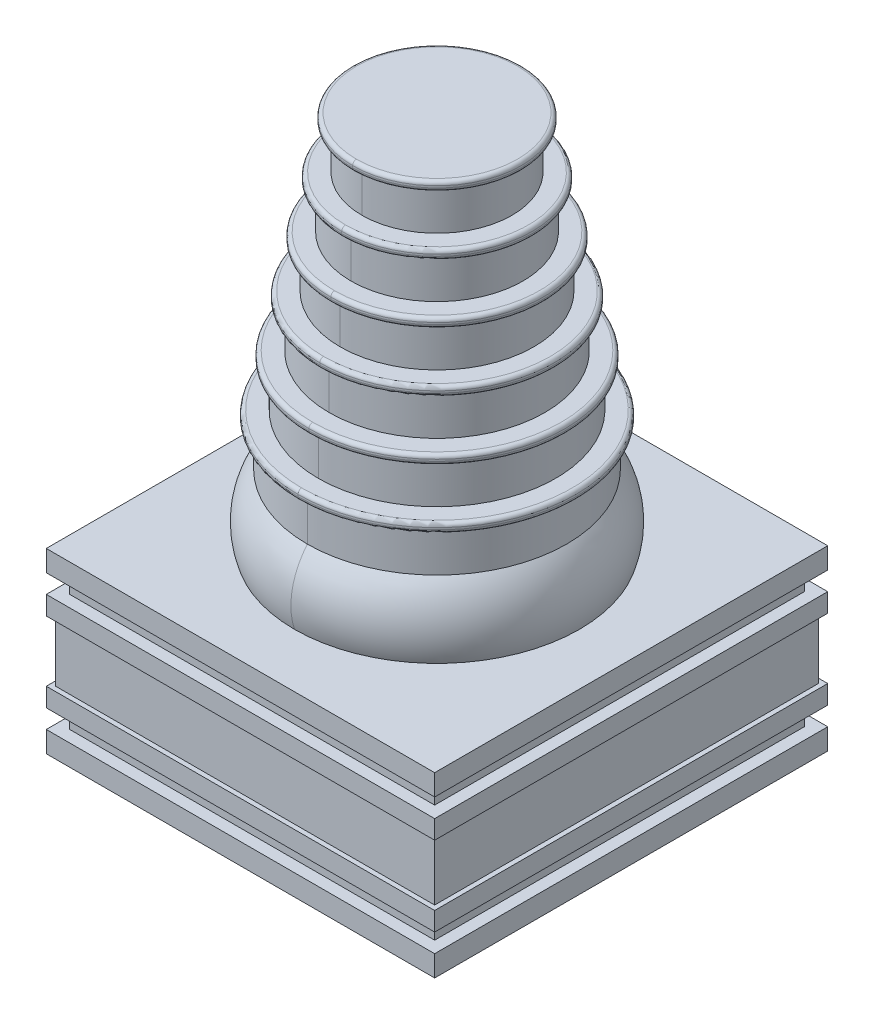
ISO-10303-21;
HEADER;
FILE_DESCRIPTION(('STEP AP214'),'2;1');
FILE_NAME('part.step','',(''),(''),'','','');
FILE_SCHEMA(('AUTOMOTIVE_DESIGN { 1 0 10303 214 1 1 1 1 }'));
ENDSEC;
DATA;
#1=APPLICATION_CONTEXT('core data for automotive mechanical design processes');
#2=APPLICATION_PROTOCOL_DEFINITION('international standard','automotive_design',2000,#1);
#3=PRODUCT_CONTEXT('',#1,'mechanical');
#4=PRODUCT('Part','Part','',(#3));
#5=PRODUCT_RELATED_PRODUCT_CATEGORY('part','',(#4));
#6=PRODUCT_DEFINITION_FORMATION('','',#4);
#7=PRODUCT_DEFINITION_CONTEXT('part definition',#1,'design');
#8=PRODUCT_DEFINITION('design','',#6,#7);
#9=PRODUCT_DEFINITION_SHAPE('','',#8);
#10=(LENGTH_UNIT() NAMED_UNIT(*) SI_UNIT(.MILLI.,.METRE.));
#11=(NAMED_UNIT(*) PLANE_ANGLE_UNIT() SI_UNIT($,.RADIAN.));
#12=(NAMED_UNIT(*) SI_UNIT($,.STERADIAN.) SOLID_ANGLE_UNIT());
#13=UNCERTAINTY_MEASURE_WITH_UNIT(LENGTH_MEASURE(1.E-05),#10,'distance_accuracy_value','');
#14=(GEOMETRIC_REPRESENTATION_CONTEXT(3) GLOBAL_UNCERTAINTY_ASSIGNED_CONTEXT((#13)) GLOBAL_UNIT_ASSIGNED_CONTEXT((#10,
#11,#12)) REPRESENTATION_CONTEXT('',''));
#15=CARTESIAN_POINT('',(0.,0.,0.));
#16=DIRECTION('',(0.,0.,1.));
#17=DIRECTION('',(1.,0.,0.));
#18=AXIS2_PLACEMENT_3D('',#15,#16,#17);
#19=CARTESIAN_POINT('',(15.25,0.5,-15.5));
#20=DIRECTION('',(0.,-1.,0.));
#21=DIRECTION('',(0.,0.,-1.));
#22=AXIS2_PLACEMENT_3D('',#19,#20,#21);
#23=PLANE('',#22);
#24=CARTESIAN_POINT('',(15.25,0.5,-15.5));
#25=DIRECTION('',(0.,-1.,0.));
#26=DIRECTION('',(0.,0.,-1.));
#27=AXIS2_PLACEMENT_3D('',#24,#25,#26);
#28=CIRCLE('',#27,3.5);
#29=CARTESIAN_POINT('',(15.25,0.5,-19.));
#30=VERTEX_POINT('',#29);
#31=CARTESIAN_POINT('',(15.25,0.5,-12.));
#32=VERTEX_POINT('',#31);
#33=EDGE_CURVE('E9',#30,#32,#28,.T.);
#34=ORIENTED_EDGE('',*,*,#33,.T.);
#35=CARTESIAN_POINT('',(15.25,0.5,-15.5));
#36=DIRECTION('',(0.,-1.,0.));
#37=DIRECTION('',(0.,0.,-1.));
#38=AXIS2_PLACEMENT_3D('',#35,#36,#37);
#39=CIRCLE('',#38,3.5);
#40=EDGE_CURVE('E1653',#32,#30,#39,.T.);
#41=ORIENTED_EDGE('',*,*,#40,.T.);
#42=EDGE_LOOP('',(#34,#41));
#43=FACE_BOUND('',#42,.T.);
#44=ADVANCED_FACE('F15',(#43),#23,.T.);
#45=CARTESIAN_POINT('',(15.25,0.5,-15.5));
#46=DIRECTION('',(0.,-1.,0.));
#47=DIRECTION('',(0.,0.,-1.));
#48=AXIS2_PLACEMENT_3D('',#45,#46,#47);
#49=CYLINDRICAL_SURFACE('',#48,3.5);
#50=DIRECTION('',(0.,-1.,0.));
#51=VECTOR('',#50,1.);
#52=CARTESIAN_POINT('',(15.25,0.5,-12.));
#53=LINE('',#52,#51);
#54=CARTESIAN_POINT('',(15.25,0.,-12.));
#55=VERTEX_POINT('',#54);
#56=EDGE_CURVE('E1600',#32,#55,#53,.T.);
#57=ORIENTED_EDGE('',*,*,#56,.F.);
#58=ORIENTED_EDGE('',*,*,#33,.F.);
#59=DIRECTION('',(0.,-1.,0.));
#60=VECTOR('',#59,1.);
#61=CARTESIAN_POINT('',(15.25,0.5,-19.));
#62=LINE('',#61,#60);
#63=CARTESIAN_POINT('',(15.25,0.,-19.));
#64=VERTEX_POINT('',#63);
#65=EDGE_CURVE('E1511',#30,#64,#62,.T.);
#66=ORIENTED_EDGE('',*,*,#65,.T.);
#67=CARTESIAN_POINT('',(15.25,0.,-15.5));
#68=DIRECTION('',(0.,-1.,0.));
#69=DIRECTION('',(0.,0.,-1.));
#70=AXIS2_PLACEMENT_3D('',#67,#68,#69);
#71=CIRCLE('',#70,3.5);
#72=EDGE_CURVE('E1225',#64,#55,#71,.T.);
#73=ORIENTED_EDGE('',*,*,#72,.T.);
#74=EDGE_LOOP('',(#57,#58,#66,#73));
#75=FACE_BOUND('',#74,.T.);
#76=ADVANCED_FACE('F1643',(#75),#49,.F.);
#77=CARTESIAN_POINT('',(15.25,0.5,15.5));
#78=DIRECTION('',(0.,-1.,0.));
#79=DIRECTION('',(0.,0.,-1.));
#80=AXIS2_PLACEMENT_3D('',#77,#78,#79);
#81=PLANE('',#80);
#82=CARTESIAN_POINT('',(15.25,0.5,15.5));
#83=DIRECTION('',(0.,-1.,0.));
#84=DIRECTION('',(0.,0.,-1.));
#85=AXIS2_PLACEMENT_3D('',#82,#83,#84);
#86=CIRCLE('',#85,3.5);
#87=CARTESIAN_POINT('',(15.25,0.5,12.));
#88=VERTEX_POINT('',#87);
#89=CARTESIAN_POINT('',(15.25,0.5,19.));
#90=VERTEX_POINT('',#89);
#91=EDGE_CURVE('E23',#88,#90,#86,.T.);
#92=ORIENTED_EDGE('',*,*,#91,.T.);
#93=CARTESIAN_POINT('',(15.25,0.5,15.5));
#94=DIRECTION('',(0.,-1.,0.));
#95=DIRECTION('',(0.,0.,-1.));
#96=AXIS2_PLACEMENT_3D('',#93,#94,#95);
#97=CIRCLE('',#96,3.5);
#98=EDGE_CURVE('E1495',#90,#88,#97,.T.);
#99=ORIENTED_EDGE('',*,*,#98,.T.);
#100=EDGE_LOOP('',(#92,#99));
#101=FACE_BOUND('',#100,.T.);
#102=ADVANCED_FACE('F1493',(#101),#81,.T.);
#103=CARTESIAN_POINT('',(15.25,0.5,15.5));
#104=DIRECTION('',(0.,-1.,0.));
#105=DIRECTION('',(0.,0.,-1.));
#106=AXIS2_PLACEMENT_3D('',#103,#104,#105);
#107=CYLINDRICAL_SURFACE('',#106,3.5);
#108=DIRECTION('',(0.,-1.,0.));
#109=VECTOR('',#108,1.);
#110=CARTESIAN_POINT('',(15.25,0.5,19.));
#111=LINE('',#110,#109);
#112=CARTESIAN_POINT('',(15.25,0.,19.));
#113=VERTEX_POINT('',#112);
#114=EDGE_CURVE('E1500',#90,#113,#111,.T.);
#115=ORIENTED_EDGE('',*,*,#114,.F.);
#116=ORIENTED_EDGE('',*,*,#91,.F.);
#117=DIRECTION('',(0.,-1.,0.));
#118=VECTOR('',#117,1.);
#119=CARTESIAN_POINT('',(15.25,0.5,12.));
#120=LINE('',#119,#118);
#121=CARTESIAN_POINT('',(15.25,0.,12.));
#122=VERTEX_POINT('',#121);
#123=EDGE_CURVE('E1509',#88,#122,#120,.T.);
#124=ORIENTED_EDGE('',*,*,#123,.T.);
#125=CARTESIAN_POINT('',(15.25,0.,15.5));
#126=DIRECTION('',(0.,-1.,0.));
#127=DIRECTION('',(0.,0.,-1.));
#128=AXIS2_PLACEMENT_3D('',#125,#126,#127);
#129=CIRCLE('',#128,3.5);
#130=EDGE_CURVE('E1228',#122,#113,#129,.T.);
#131=ORIENTED_EDGE('',*,*,#130,.T.);
#132=EDGE_LOOP('',(#115,#116,#124,#131));
#133=FACE_BOUND('',#132,.T.);
#134=ADVANCED_FACE('F1501',(#133),#107,.F.);
#135=CARTESIAN_POINT('',(0.,-10.8238272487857,0.));
#136=DIRECTION('',(0.,-1.,0.));
#137=DIRECTION('',(0.,0.,-1.));
#138=AXIS2_PLACEMENT_3D('',#135,#136,#137);
#139=CYLINDRICAL_SURFACE('',#138,13.8563831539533);
#140=DIRECTION('',(0.,-1.,0.));
#141=VECTOR('',#140,1.);
#142=CARTESIAN_POINT('',(0.,-10.8238272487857,13.8563831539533));
#143=LINE('',#142,#141);
#144=CARTESIAN_POINT('',(0.,30.7,13.8563831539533));
#145=VERTEX_POINT('',#144);
#146=CARTESIAN_POINT('',(0.,26.2,13.8563831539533));
#147=VERTEX_POINT('',#146);
#148=EDGE_CURVE('E1536',#145,#147,#143,.T.);
#149=ORIENTED_EDGE('',*,*,#148,.F.);
#150=CARTESIAN_POINT('',(0.,30.7,0.));
#151=DIRECTION('',(0.,1.,0.));
#152=DIRECTION('',(0.,0.,1.));
#153=AXIS2_PLACEMENT_3D('',#150,#151,#152);
#154=CIRCLE('',#153,13.8563831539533);
#155=CARTESIAN_POINT('',(0.,30.7,-13.8563831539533));
#156=VERTEX_POINT('',#155);
#157=EDGE_CURVE('E1176',#156,#145,#154,.T.);
#158=ORIENTED_EDGE('',*,*,#157,.F.);
#159=DIRECTION('',(0.,-1.,0.));
#160=VECTOR('',#159,1.);
#161=CARTESIAN_POINT('',(0.,-10.8238272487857,-13.8563831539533));
#162=LINE('',#161,#160);
#163=CARTESIAN_POINT('',(0.,26.2,-13.8563831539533));
#164=VERTEX_POINT('',#163);
#165=EDGE_CURVE('E1537',#156,#164,#162,.T.);
#166=ORIENTED_EDGE('',*,*,#165,.T.);
#167=CARTESIAN_POINT('',(0.,26.2,0.));
#168=DIRECTION('',(0.,-1.,0.));
#169=DIRECTION('',(0.,0.,-1.));
#170=AXIS2_PLACEMENT_3D('',#167,#168,#169);
#171=CIRCLE('',#170,13.8563831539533);
#172=EDGE_CURVE('E1016',#147,#164,#171,.T.);
#173=ORIENTED_EDGE('',*,*,#172,.F.);
#174=EDGE_LOOP('',(#149,#158,#166,#173));
#175=FACE_BOUND('',#174,.T.);
#176=ADVANCED_FACE('F1623',(#175),#139,.T.);
#177=CARTESIAN_POINT('',(0.,21.3764518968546,0.));
#178=DIRECTION('',(0.,-1.,0.));
#179=DIRECTION('',(0.,0.,-1.));
#180=AXIS2_PLACEMENT_3D('',#177,#178,#179);
#181=TOROIDAL_SURFACE('',#180,8.11326695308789,7.5);
#182=CARTESIAN_POINT('',(0.,21.3764518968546,8.11326695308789));
#183=DIRECTION('',(1.,0.,0.));
#184=DIRECTION('',(0.,0.,-1.));
#185=AXIS2_PLACEMENT_3D('',#182,#183,#184);
#186=CIRCLE('',#185,7.5);
#187=CARTESIAN_POINT('',(0.,19.,15.226808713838));
#188=VERTEX_POINT('',#187);
#189=EDGE_CURVE('E1541',#147,#188,#186,.T.);
#190=ORIENTED_EDGE('',*,*,#189,.F.);
#191=ORIENTED_EDGE('',*,*,#172,.T.);
#192=CARTESIAN_POINT('',(0.,21.3764518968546,-8.11326695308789));
#193=DIRECTION('',(-1.,0.,0.));
#194=DIRECTION('',(0.,0.,1.));
#195=AXIS2_PLACEMENT_3D('',#192,#193,#194);
#196=CIRCLE('',#195,7.5);
#197=CARTESIAN_POINT('',(0.,19.,-15.226808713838));
#198=VERTEX_POINT('',#197);
#199=EDGE_CURVE('E1553',#164,#198,#196,.T.);
#200=ORIENTED_EDGE('',*,*,#199,.T.);
#201=CARTESIAN_POINT('',(0.,19.,0.));
#202=DIRECTION('',(0.,-1.,0.));
#203=DIRECTION('',(0.,0.,-1.));
#204=AXIS2_PLACEMENT_3D('',#201,#202,#203);
#205=CIRCLE('',#204,15.226808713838);
#206=EDGE_CURVE('E1013',#188,#198,#205,.T.);
#207=ORIENTED_EDGE('',*,*,#206,.F.);
#208=EDGE_LOOP('',(#190,#191,#200,#207));
#209=FACE_BOUND('',#208,.T.);
#210=ADVANCED_FACE('F1625',(#209),#181,.T.);
#211=CARTESIAN_POINT('',(0.,19.,0.));
#212=DIRECTION('',(0.,1.,0.));
#213=DIRECTION('',(1.,0.,0.));
#214=AXIS2_PLACEMENT_3D('',#211,#212,#213);
#215=PLANE('',#214);
#216=CARTESIAN_POINT('',(0.,19.,0.));
#217=DIRECTION('',(0.,-1.,0.));
#218=DIRECTION('',(0.,0.,-1.));
#219=AXIS2_PLACEMENT_3D('',#216,#217,#218);
#220=CIRCLE('',#219,15.226808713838);
#221=EDGE_CURVE('E1549',#198,#188,#220,.T.);
#222=ORIENTED_EDGE('',*,*,#221,.T.);
#223=ORIENTED_EDGE('',*,*,#206,.T.);
#224=EDGE_LOOP('',(#222,#223));
#225=FACE_BOUND('',#224,.T.);
#226=DIRECTION('',(0.,0.,1.));
#227=VECTOR('',#226,1.);
#228=CARTESIAN_POINT('',(-20.75,19.,-21.));
#229=LINE('',#228,#227);
#230=CARTESIAN_POINT('',(-20.75,19.,-21.));
#231=VERTEX_POINT('',#230);
#232=CARTESIAN_POINT('',(-20.75,19.,21.));
#233=VERTEX_POINT('',#232);
#234=EDGE_CURVE('E34',#231,#233,#229,.T.);
#235=ORIENTED_EDGE('',*,*,#234,.T.);
#236=DIRECTION('',(1.,0.,0.));
#237=VECTOR('',#236,1.);
#238=CARTESIAN_POINT('',(-20.75,19.,21.));
#239=LINE('',#238,#237);
#240=CARTESIAN_POINT('',(20.75,19.,21.));
#241=VERTEX_POINT('',#240);
#242=EDGE_CURVE('E40',#233,#241,#239,.T.);
#243=ORIENTED_EDGE('',*,*,#242,.T.);
#244=DIRECTION('',(0.,0.,-1.));
#245=VECTOR('',#244,1.);
#246=CARTESIAN_POINT('',(20.75,19.,-21.));
#247=LINE('',#246,#245);
#248=CARTESIAN_POINT('',(20.75,19.,-21.));
#249=VERTEX_POINT('',#248);
#250=EDGE_CURVE('E1477',#241,#249,#247,.T.);
#251=ORIENTED_EDGE('',*,*,#250,.T.);
#252=DIRECTION('',(-1.,0.,0.));
#253=VECTOR('',#252,1.);
#254=CARTESIAN_POINT('',(-20.75,19.,-21.));
#255=LINE('',#254,#253);
#256=EDGE_CURVE('E1471',#249,#231,#255,.T.);
#257=ORIENTED_EDGE('',*,*,#256,.T.);
#258=EDGE_LOOP('',(#235,#243,#251,#257));
#259=FACE_BOUND('',#258,.T.);
#260=ADVANCED_FACE('F1627',(#225,#259),#215,.T.);
#261=CARTESIAN_POINT('',(-20.75,19.,-21.));
#262=DIRECTION('',(1.,0.,0.));
#263=DIRECTION('',(0.,1.,0.));
#264=AXIS2_PLACEMENT_3D('',#261,#262,#263);
#265=PLANE('',#264);
#266=DIRECTION('',(0.,-1.,0.));
#267=VECTOR('',#266,1.);
#268=CARTESIAN_POINT('',(-20.75,19.,-21.));
#269=LINE('',#268,#267);
#270=CARTESIAN_POINT('',(-20.75,16.75,-21.));
#271=VERTEX_POINT('',#270);
#272=EDGE_CURVE('E1468',#231,#271,#269,.T.);
#273=ORIENTED_EDGE('',*,*,#272,.T.);
#274=DIRECTION('',(0.,0.,1.));
#275=VECTOR('',#274,1.);
#276=CARTESIAN_POINT('',(-20.75,16.75,-59.265519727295));
#277=LINE('',#276,#275);
#278=CARTESIAN_POINT('',(-20.75,16.75,21.));
#279=VERTEX_POINT('',#278);
#280=EDGE_CURVE('E1461',#271,#279,#277,.T.);
#281=ORIENTED_EDGE('',*,*,#280,.T.);
#282=DIRECTION('',(0.,-1.,0.));
#283=VECTOR('',#282,1.);
#284=CARTESIAN_POINT('',(-20.75,19.,21.));
#285=LINE('',#284,#283);
#286=EDGE_CURVE('E1480',#233,#279,#285,.T.);
#287=ORIENTED_EDGE('',*,*,#286,.F.);
#288=ORIENTED_EDGE('',*,*,#234,.F.);
#289=EDGE_LOOP('',(#273,#281,#287,#288));
#290=FACE_BOUND('',#289,.T.);
#291=ADVANCED_FACE('F1629',(#290),#265,.F.);
#292=CARTESIAN_POINT('',(-20.75,19.,21.));
#293=DIRECTION('',(0.,0.,-1.));
#294=DIRECTION('',(0.,-1.,0.));
#295=AXIS2_PLACEMENT_3D('',#292,#293,#294);
#296=PLANE('',#295);
#297=ORIENTED_EDGE('',*,*,#286,.T.);
#298=DIRECTION('',(-1.,0.,0.));
#299=VECTOR('',#298,1.);
#300=CARTESIAN_POINT('',(20.75,16.75,21.));
#301=LINE('',#300,#299);
#302=CARTESIAN_POINT('',(20.75,16.75,21.));
#303=VERTEX_POINT('',#302);
#304=EDGE_CURVE('E1457',#303,#279,#301,.T.);
#305=ORIENTED_EDGE('',*,*,#304,.F.);
#306=DIRECTION('',(0.,-1.,0.));
#307=VECTOR('',#306,1.);
#308=CARTESIAN_POINT('',(20.75,19.,21.));
#309=LINE('',#308,#307);
#310=EDGE_CURVE('E1474',#241,#303,#309,.T.);
#311=ORIENTED_EDGE('',*,*,#310,.F.);
#312=ORIENTED_EDGE('',*,*,#242,.F.);
#313=EDGE_LOOP('',(#297,#305,#311,#312));
#314=FACE_BOUND('',#313,.T.);
#315=ADVANCED_FACE('F1636',(#314),#296,.F.);
#316=CARTESIAN_POINT('',(20.75,19.,-21.));
#317=DIRECTION('',(-1.,0.,0.));
#318=DIRECTION('',(0.,0.,1.));
#319=AXIS2_PLACEMENT_3D('',#316,#317,#318);
#320=PLANE('',#319);
#321=ORIENTED_EDGE('',*,*,#310,.T.);
#322=DIRECTION('',(0.,0.,1.));
#323=VECTOR('',#322,1.);
#324=CARTESIAN_POINT('',(20.75,16.75,-21.));
#325=LINE('',#324,#323);
#326=CARTESIAN_POINT('',(20.75,16.75,-21.));
#327=VERTEX_POINT('',#326);
#328=EDGE_CURVE('E1453',#327,#303,#325,.T.);
#329=ORIENTED_EDGE('',*,*,#328,.F.);
#330=DIRECTION('',(0.,-1.,0.));
#331=VECTOR('',#330,1.);
#332=CARTESIAN_POINT('',(20.75,19.,-21.));
#333=LINE('',#332,#331);
#334=EDGE_CURVE('E1465',#249,#327,#333,.T.);
#335=ORIENTED_EDGE('',*,*,#334,.F.);
#336=ORIENTED_EDGE('',*,*,#250,.F.);
#337=EDGE_LOOP('',(#321,#329,#335,#336));
#338=FACE_BOUND('',#337,.T.);
#339=ADVANCED_FACE('F1840',(#338),#320,.F.);
#340=CARTESIAN_POINT('',(-20.75,19.,-21.));
#341=DIRECTION('',(0.,0.,1.));
#342=DIRECTION('',(1.,0.,0.));
#343=AXIS2_PLACEMENT_3D('',#340,#341,#342);
#344=PLANE('',#343);
#345=ORIENTED_EDGE('',*,*,#334,.T.);
#346=DIRECTION('',(1.,0.,0.));
#347=VECTOR('',#346,1.);
#348=CARTESIAN_POINT('',(-20.75,16.75,-21.));
#349=LINE('',#348,#347);
#350=EDGE_CURVE('E1449',#271,#327,#349,.T.);
#351=ORIENTED_EDGE('',*,*,#350,.F.);
#352=ORIENTED_EDGE('',*,*,#272,.F.);
#353=ORIENTED_EDGE('',*,*,#256,.F.);
#354=EDGE_LOOP('',(#345,#351,#352,#353));
#355=FACE_BOUND('',#354,.T.);
#356=ADVANCED_FACE('F1801',(#355),#344,.F.);
#357=CARTESIAN_POINT('',(-20.75,16.75,-59.265519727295));
#358=DIRECTION('',(0.,1.,0.));
#359=DIRECTION('',(1.,0.,0.));
#360=AXIS2_PLACEMENT_3D('',#357,#358,#359);
#361=PLANE('',#360);
#362=DIRECTION('',(0.,0.,1.));
#363=VECTOR('',#362,1.);
#364=CARTESIAN_POINT('',(-19.5,16.75,-59.265519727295));
#365=LINE('',#364,#363);
#366=CARTESIAN_POINT('',(-19.5,16.75,-19.75));
#367=VERTEX_POINT('',#366);
#368=CARTESIAN_POINT('',(-19.5,16.75,19.75));
#369=VERTEX_POINT('',#368);
#370=EDGE_CURVE('E1446',#367,#369,#365,.T.);
#371=ORIENTED_EDGE('',*,*,#370,.T.);
#372=DIRECTION('',(-1.,0.,0.));
#373=VECTOR('',#372,1.);
#374=CARTESIAN_POINT('',(19.5,16.75,19.75));
#375=LINE('',#374,#373);
#376=CARTESIAN_POINT('',(19.5,16.75,19.75));
#377=VERTEX_POINT('',#376);
#378=EDGE_CURVE('E1439',#377,#369,#375,.T.);
#379=ORIENTED_EDGE('',*,*,#378,.F.);
#380=DIRECTION('',(0.,0.,1.));
#381=VECTOR('',#380,1.);
#382=CARTESIAN_POINT('',(19.5,16.75,-19.75));
#383=LINE('',#382,#381);
#384=CARTESIAN_POINT('',(19.5,16.75,-19.75));
#385=VERTEX_POINT('',#384);
#386=EDGE_CURVE('E1031',#385,#377,#383,.T.);
#387=ORIENTED_EDGE('',*,*,#386,.F.);
#388=DIRECTION('',(1.,0.,0.));
#389=VECTOR('',#388,1.);
#390=CARTESIAN_POINT('',(-19.5,16.75,-19.75));
#391=LINE('',#390,#389);
#392=EDGE_CURVE('E1028',#367,#385,#391,.T.);
#393=ORIENTED_EDGE('',*,*,#392,.F.);
#394=EDGE_LOOP('',(#371,#379,#387,#393));
#395=FACE_BOUND('',#394,.T.);
#396=ORIENTED_EDGE('',*,*,#350,.T.);
#397=ORIENTED_EDGE('',*,*,#328,.T.);
#398=ORIENTED_EDGE('',*,*,#304,.T.);
#399=ORIENTED_EDGE('',*,*,#280,.F.);
#400=EDGE_LOOP('',(#396,#397,#398,#399));
#401=FACE_BOUND('',#400,.T.);
#402=ADVANCED_FACE('F1798',(#395,#401),#361,.F.);
#403=CARTESIAN_POINT('',(-19.5,16.75,-59.265519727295));
#404=DIRECTION('',(1.,0.,0.));
#405=DIRECTION('',(0.,1.,0.));
#406=AXIS2_PLACEMENT_3D('',#403,#404,#405);
#407=PLANE('',#406);
#408=DIRECTION('',(0.,0.,1.));
#409=VECTOR('',#408,1.);
#410=CARTESIAN_POINT('',(-19.5,14.75,-59.265519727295));
#411=LINE('',#410,#409);
#412=CARTESIAN_POINT('',(-19.5,14.75,-19.75));
#413=VERTEX_POINT('',#412);
#414=CARTESIAN_POINT('',(-19.5,14.75,19.75));
#415=VERTEX_POINT('',#414);
#416=EDGE_CURVE('E1009',#413,#415,#411,.T.);
#417=ORIENTED_EDGE('',*,*,#416,.T.);
#418=CARTESIAN_POINT('',(-19.5,16.75,19.75));
#419=CARTESIAN_POINT('',(-19.5,16.0833333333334,19.75));
#420=CARTESIAN_POINT('',(-19.5,15.4166666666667,19.75));
#421=CARTESIAN_POINT('',(-19.5,14.75,19.75));
#422=(BOUNDED_CURVE() B_SPLINE_CURVE(3,(#418,#419,#420,#421),.UNSPECIFIED.,.F.,
.F.) B_SPLINE_CURVE_WITH_KNOTS((4,4),(0.,1.),
.UNSPECIFIED.) CURVE() GEOMETRIC_REPRESENTATION_ITEM() RATIONAL_B_SPLINE_CURVE((1.,1.,1.,1.)) REPRESENTATION_ITEM(''));
#423=EDGE_CURVE('E1434',#369,#415,#422,.T.);
#424=ORIENTED_EDGE('',*,*,#423,.F.);
#425=ORIENTED_EDGE('',*,*,#370,.F.);
#426=DIRECTION('',(0.,1.,0.));
#427=VECTOR('',#426,1.);
#428=CARTESIAN_POINT('',(-19.5,16.75,-19.75));
#429=LINE('',#428,#427);
#430=EDGE_CURVE('E1008',#413,#367,#429,.T.);
#431=ORIENTED_EDGE('',*,*,#430,.F.);
#432=EDGE_LOOP('',(#417,#424,#425,#431));
#433=FACE_BOUND('',#432,.T.);
#434=ADVANCED_FACE('F1770',(#433),#407,.F.);
#435=CARTESIAN_POINT('',(19.5,16.75,19.75));
#436=DIRECTION('',(0.,0.,1.));
#437=DIRECTION('',(1.,0.,0.));
#438=AXIS2_PLACEMENT_3D('',#435,#436,#437);
#439=PLANE('',#438);
#440=ORIENTED_EDGE('',*,*,#423,.T.);
#441=DIRECTION('',(-1.,0.,0.));
#442=VECTOR('',#441,1.);
#443=CARTESIAN_POINT('',(19.5,14.75,19.75));
#444=LINE('',#443,#442);
#445=CARTESIAN_POINT('',(19.5,14.75,19.75));
#446=VERTEX_POINT('',#445);
#447=EDGE_CURVE('E1417',#446,#415,#444,.T.);
#448=ORIENTED_EDGE('',*,*,#447,.F.);
#449=DIRECTION('',(0.,1.,0.));
#450=VECTOR('',#449,1.);
#451=CARTESIAN_POINT('',(19.5,16.75,19.75));
#452=LINE('',#451,#450);
#453=EDGE_CURVE('E1430',#446,#377,#452,.T.);
#454=ORIENTED_EDGE('',*,*,#453,.T.);
#455=ORIENTED_EDGE('',*,*,#378,.T.);
#456=EDGE_LOOP('',(#440,#448,#454,#455));
#457=FACE_BOUND('',#456,.T.);
#458=ADVANCED_FACE('F1766',(#457),#439,.T.);
#459=CARTESIAN_POINT('',(19.5,16.75,-19.75));
#460=DIRECTION('',(-1.,0.,0.));
#461=DIRECTION('',(0.,0.,1.));
#462=AXIS2_PLACEMENT_3D('',#459,#460,#461);
#463=PLANE('',#462);
#464=DIRECTION('',(0.,0.,1.));
#465=VECTOR('',#464,1.);
#466=CARTESIAN_POINT('',(19.5,14.75,-19.75));
#467=LINE('',#466,#465);
#468=CARTESIAN_POINT('',(19.5,14.75,-19.75));
#469=VERTEX_POINT('',#468);
#470=EDGE_CURVE('E1413',#469,#446,#467,.T.);
#471=ORIENTED_EDGE('',*,*,#470,.F.);
#472=DIRECTION('',(0.,-1.,0.));
#473=VECTOR('',#472,1.);
#474=CARTESIAN_POINT('',(19.5,16.75,-19.75));
#475=LINE('',#474,#473);
#476=EDGE_CURVE('E1005',#385,#469,#475,.T.);
#477=ORIENTED_EDGE('',*,*,#476,.F.);
#478=ORIENTED_EDGE('',*,*,#386,.T.);
#479=ORIENTED_EDGE('',*,*,#453,.F.);
#480=EDGE_LOOP('',(#471,#477,#478,#479));
#481=FACE_BOUND('',#480,.T.);
#482=ADVANCED_FACE('F1769',(#481),#463,.F.);
#483=CARTESIAN_POINT('',(-19.5,16.75,-19.75));
#484=DIRECTION('',(0.,0.,-1.));
#485=DIRECTION('',(-1.,0.,0.));
#486=AXIS2_PLACEMENT_3D('',#483,#484,#485);
#487=PLANE('',#486);
#488=ORIENTED_EDGE('',*,*,#476,.T.);
#489=DIRECTION('',(1.,0.,0.));
#490=VECTOR('',#489,1.);
#491=CARTESIAN_POINT('',(-19.5,14.75,-19.75));
#492=LINE('',#491,#490);
#493=EDGE_CURVE('E1409',#413,#469,#492,.T.);
#494=ORIENTED_EDGE('',*,*,#493,.F.);
#495=ORIENTED_EDGE('',*,*,#430,.T.);
#496=ORIENTED_EDGE('',*,*,#392,.T.);
#497=EDGE_LOOP('',(#488,#494,#495,#496));
#498=FACE_BOUND('',#497,.T.);
#499=ADVANCED_FACE('F1884',(#498),#487,.T.);
#500=CARTESIAN_POINT('',(-19.5,14.75,-59.265519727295));
#501=DIRECTION('',(0.,-1.,0.));
#502=DIRECTION('',(0.,0.,-1.));
#503=AXIS2_PLACEMENT_3D('',#500,#501,#502);
#504=PLANE('',#503);
#505=ORIENTED_EDGE('',*,*,#493,.T.);
#506=ORIENTED_EDGE('',*,*,#470,.T.);
#507=ORIENTED_EDGE('',*,*,#447,.T.);
#508=ORIENTED_EDGE('',*,*,#416,.F.);
#509=EDGE_LOOP('',(#505,#506,#507,#508));
#510=FACE_BOUND('',#509,.T.);
#511=DIRECTION('',(0.,0.,1.));
#512=VECTOR('',#511,1.);
#513=CARTESIAN_POINT('',(-20.75,14.75,-59.265519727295));
#514=LINE('',#513,#512);
#515=CARTESIAN_POINT('',(-20.75,14.75,-21.));
#516=VERTEX_POINT('',#515);
#517=CARTESIAN_POINT('',(-20.75,14.75,21.));
#518=VERTEX_POINT('',#517);
#519=EDGE_CURVE('E1406',#516,#518,#514,.T.);
#520=ORIENTED_EDGE('',*,*,#519,.T.);
#521=DIRECTION('',(-1.,0.,0.));
#522=VECTOR('',#521,1.);
#523=CARTESIAN_POINT('',(20.75,14.75,21.));
#524=LINE('',#523,#522);
#525=CARTESIAN_POINT('',(20.75,14.75,21.));
#526=VERTEX_POINT('',#525);
#527=EDGE_CURVE('E1399',#526,#518,#524,.T.);
#528=ORIENTED_EDGE('',*,*,#527,.F.);
#529=DIRECTION('',(0.,0.,1.));
#530=VECTOR('',#529,1.);
#531=CARTESIAN_POINT('',(20.75,14.75,-21.));
#532=LINE('',#531,#530);
#533=CARTESIAN_POINT('',(20.75,14.75,-21.));
#534=VERTEX_POINT('',#533);
#535=EDGE_CURVE('E1392',#534,#526,#532,.T.);
#536=ORIENTED_EDGE('',*,*,#535,.F.);
#537=DIRECTION('',(1.,0.,0.));
#538=VECTOR('',#537,1.);
#539=CARTESIAN_POINT('',(-20.75,14.75,-21.));
#540=LINE('',#539,#538);
#541=EDGE_CURVE('E1385',#516,#534,#540,.T.);
#542=ORIENTED_EDGE('',*,*,#541,.F.);
#543=EDGE_LOOP('',(#520,#528,#536,#542));
#544=FACE_BOUND('',#543,.T.);
#545=ADVANCED_FACE('F1881',(#510,#544),#504,.F.);
#546=CARTESIAN_POINT('',(-20.75,19.,-21.));
#547=DIRECTION('',(1.,0.,0.));
#548=DIRECTION('',(0.,1.,0.));
#549=AXIS2_PLACEMENT_3D('',#546,#547,#548);
#550=PLANE('',#549);
#551=DIRECTION('',(0.,-1.,0.));
#552=VECTOR('',#551,1.);
#553=CARTESIAN_POINT('',(-20.75,19.,21.));
#554=LINE('',#553,#552);
#555=CARTESIAN_POINT('',(-20.75,12.75,21.));
#556=VERTEX_POINT('',#555);
#557=EDGE_CURVE('E1403',#518,#556,#554,.T.);
#558=ORIENTED_EDGE('',*,*,#557,.F.);
#559=ORIENTED_EDGE('',*,*,#519,.F.);
#560=DIRECTION('',(0.,-1.,0.));
#561=VECTOR('',#560,1.);
#562=CARTESIAN_POINT('',(-20.75,19.,-21.));
#563=LINE('',#562,#561);
#564=CARTESIAN_POINT('',(-20.75,12.75,-21.));
#565=VERTEX_POINT('',#564);
#566=EDGE_CURVE('E1382',#516,#565,#563,.T.);
#567=ORIENTED_EDGE('',*,*,#566,.T.);
#568=DIRECTION('',(0.,0.,1.));
#569=VECTOR('',#568,1.);
#570=CARTESIAN_POINT('',(-20.75,12.75,-59.265519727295));
#571=LINE('',#570,#569);
#572=EDGE_CURVE('E1378',#565,#556,#571,.T.);
#573=ORIENTED_EDGE('',*,*,#572,.T.);
#574=EDGE_LOOP('',(#558,#559,#567,#573));
#575=FACE_BOUND('',#574,.T.);
#576=ADVANCED_FACE('F1876',(#575),#550,.F.);
#577=CARTESIAN_POINT('',(-20.75,19.,21.));
#578=DIRECTION('',(0.,0.,-1.));
#579=DIRECTION('',(0.,-1.,0.));
#580=AXIS2_PLACEMENT_3D('',#577,#578,#579);
#581=PLANE('',#580);
#582=DIRECTION('',(0.,-1.,0.));
#583=VECTOR('',#582,1.);
#584=CARTESIAN_POINT('',(20.75,19.,21.));
#585=LINE('',#584,#583);
#586=CARTESIAN_POINT('',(20.75,12.75,21.));
#587=VERTEX_POINT('',#586);
#588=EDGE_CURVE('E1396',#526,#587,#585,.T.);
#589=ORIENTED_EDGE('',*,*,#588,.F.);
#590=ORIENTED_EDGE('',*,*,#527,.T.);
#591=ORIENTED_EDGE('',*,*,#557,.T.);
#592=DIRECTION('',(-1.,0.,0.));
#593=VECTOR('',#592,1.);
#594=CARTESIAN_POINT('',(20.75,12.75,21.));
#595=LINE('',#594,#593);
#596=EDGE_CURVE('E1374',#587,#556,#595,.T.);
#597=ORIENTED_EDGE('',*,*,#596,.F.);
#598=EDGE_LOOP('',(#589,#590,#591,#597));
#599=FACE_BOUND('',#598,.T.);
#600=ADVANCED_FACE('F1872',(#599),#581,.F.);
#601=CARTESIAN_POINT('',(20.75,19.,-21.));
#602=DIRECTION('',(-1.,0.,0.));
#603=DIRECTION('',(0.,0.,1.));
#604=AXIS2_PLACEMENT_3D('',#601,#602,#603);
#605=PLANE('',#604);
#606=DIRECTION('',(0.,-1.,0.));
#607=VECTOR('',#606,1.);
#608=CARTESIAN_POINT('',(20.75,19.,-21.));
#609=LINE('',#608,#607);
#610=CARTESIAN_POINT('',(20.75,12.75,-21.));
#611=VERTEX_POINT('',#610);
#612=EDGE_CURVE('E1389',#534,#611,#609,.T.);
#613=ORIENTED_EDGE('',*,*,#612,.F.);
#614=ORIENTED_EDGE('',*,*,#535,.T.);
#615=ORIENTED_EDGE('',*,*,#588,.T.);
#616=DIRECTION('',(0.,0.,1.));
#617=VECTOR('',#616,1.);
#618=CARTESIAN_POINT('',(20.75,12.75,-21.));
#619=LINE('',#618,#617);
#620=EDGE_CURVE('E1370',#611,#587,#619,.T.);
#621=ORIENTED_EDGE('',*,*,#620,.F.);
#622=EDGE_LOOP('',(#613,#614,#615,#621));
#623=FACE_BOUND('',#622,.T.);
#624=ADVANCED_FACE('F1868',(#623),#605,.F.);
#625=CARTESIAN_POINT('',(-20.75,19.,-21.));
#626=DIRECTION('',(0.,0.,1.));
#627=DIRECTION('',(1.,0.,0.));
#628=AXIS2_PLACEMENT_3D('',#625,#626,#627);
#629=PLANE('',#628);
#630=ORIENTED_EDGE('',*,*,#566,.F.);
#631=ORIENTED_EDGE('',*,*,#541,.T.);
#632=ORIENTED_EDGE('',*,*,#612,.T.);
#633=DIRECTION('',(1.,0.,0.));
#634=VECTOR('',#633,1.);
#635=CARTESIAN_POINT('',(-20.75,12.75,-21.));
#636=LINE('',#635,#634);
#637=EDGE_CURVE('E1366',#565,#611,#636,.T.);
#638=ORIENTED_EDGE('',*,*,#637,.F.);
#639=EDGE_LOOP('',(#630,#631,#632,#638));
#640=FACE_BOUND('',#639,.T.);
#641=ADVANCED_FACE('F1865',(#640),#629,.F.);
#642=CARTESIAN_POINT('',(-20.75,12.75,-59.265519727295));
#643=DIRECTION('',(0.,1.,0.));
#644=DIRECTION('',(1.,0.,0.));
#645=AXIS2_PLACEMENT_3D('',#642,#643,#644);
#646=PLANE('',#645);
#647=DIRECTION('',(0.,0.,1.));
#648=VECTOR('',#647,1.);
#649=CARTESIAN_POINT('',(-20.25,12.75,-59.265519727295));
#650=LINE('',#649,#648);
#651=CARTESIAN_POINT('',(-20.25,12.75,-20.5));
#652=VERTEX_POINT('',#651);
#653=CARTESIAN_POINT('',(-20.25,12.75,20.5));
#654=VERTEX_POINT('',#653);
#655=EDGE_CURVE('E1363',#652,#654,#650,.T.);
#656=ORIENTED_EDGE('',*,*,#655,.T.);
#657=DIRECTION('',(-1.,0.,0.));
#658=VECTOR('',#657,1.);
#659=CARTESIAN_POINT('',(20.25,12.75,20.5));
#660=LINE('',#659,#658);
#661=CARTESIAN_POINT('',(20.25,12.75,20.5));
#662=VERTEX_POINT('',#661);
#663=EDGE_CURVE('E743',#662,#654,#660,.T.);
#664=ORIENTED_EDGE('',*,*,#663,.F.);
#665=DIRECTION('',(0.,0.,1.));
#666=VECTOR('',#665,1.);
#667=CARTESIAN_POINT('',(20.25,12.75,-20.5));
#668=LINE('',#667,#666);
#669=CARTESIAN_POINT('',(20.25,12.75,-20.5));
#670=VERTEX_POINT('',#669);
#671=EDGE_CURVE('E1353',#670,#662,#668,.T.);
#672=ORIENTED_EDGE('',*,*,#671,.F.);
#673=DIRECTION('',(1.,0.,0.));
#674=VECTOR('',#673,1.);
#675=CARTESIAN_POINT('',(-20.25,12.75,-20.5));
#676=LINE('',#675,#674);
#677=EDGE_CURVE('E1349',#652,#670,#676,.T.);
#678=ORIENTED_EDGE('',*,*,#677,.F.);
#679=EDGE_LOOP('',(#656,#664,#672,#678));
#680=FACE_BOUND('',#679,.T.);
#681=ORIENTED_EDGE('',*,*,#637,.T.);
#682=ORIENTED_EDGE('',*,*,#620,.T.);
#683=ORIENTED_EDGE('',*,*,#596,.T.);
#684=ORIENTED_EDGE('',*,*,#572,.F.);
#685=EDGE_LOOP('',(#681,#682,#683,#684));
#686=FACE_BOUND('',#685,.T.);
#687=ADVANCED_FACE('F1834',(#680,#686),#646,.F.);
#688=CARTESIAN_POINT('',(-20.25,12.75,-59.265519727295));
#689=DIRECTION('',(1.,0.,0.));
#690=DIRECTION('',(0.,-1.,0.));
#691=AXIS2_PLACEMENT_3D('',#688,#689,#690);
#692=PLANE('',#691);
#693=DIRECTION('',(0.,0.,1.));
#694=VECTOR('',#693,1.);
#695=CARTESIAN_POINT('',(-20.25,6.25,-59.265519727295));
#696=LINE('',#695,#694);
#697=CARTESIAN_POINT('',(-20.25,6.25,-20.5));
#698=VERTEX_POINT('',#697);
#699=CARTESIAN_POINT('',(-20.25,6.25,20.5));
#700=VERTEX_POINT('',#699);
#701=EDGE_CURVE('E1341',#698,#700,#696,.T.);
#702=ORIENTED_EDGE('',*,*,#701,.T.);
#703=CARTESIAN_POINT('',(-20.25,12.75,20.5));
#704=CARTESIAN_POINT('',(-20.25,10.5833333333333,20.5));
#705=CARTESIAN_POINT('',(-20.25,8.41666666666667,20.5));
#706=CARTESIAN_POINT('',(-20.25,6.25,20.5));
#707=(BOUNDED_CURVE() B_SPLINE_CURVE(3,(#703,#704,#705,#706),.UNSPECIFIED.,.F.,
.F.) B_SPLINE_CURVE_WITH_KNOTS((4,4),(0.,1.),
.UNSPECIFIED.) CURVE() GEOMETRIC_REPRESENTATION_ITEM() RATIONAL_B_SPLINE_CURVE((1.,1.,1.,1.)) REPRESENTATION_ITEM(''));
#708=EDGE_CURVE('E738',#654,#700,#707,.T.);
#709=ORIENTED_EDGE('',*,*,#708,.F.);
#710=ORIENTED_EDGE('',*,*,#655,.F.);
#711=DIRECTION('',(0.,1.,0.));
#712=VECTOR('',#711,1.);
#713=CARTESIAN_POINT('',(-20.25,12.75,-20.5));
#714=LINE('',#713,#712);
#715=EDGE_CURVE('E1348',#698,#652,#714,.T.);
#716=ORIENTED_EDGE('',*,*,#715,.F.);
#717=EDGE_LOOP('',(#702,#709,#710,#716));
#718=FACE_BOUND('',#717,.T.);
#719=ADVANCED_FACE('F1830',(#718),#692,.F.);
#720=CARTESIAN_POINT('',(20.25,12.75,20.5));
#721=DIRECTION('',(0.,0.,1.));
#722=DIRECTION('',(0.,-1.,0.));
#723=AXIS2_PLACEMENT_3D('',#720,#721,#722);
#724=PLANE('',#723);
#725=ORIENTED_EDGE('',*,*,#708,.T.);
#726=DIRECTION('',(-1.,0.,0.));
#727=VECTOR('',#726,1.);
#728=CARTESIAN_POINT('',(20.25,6.25,20.5));
#729=LINE('',#728,#727);
#730=CARTESIAN_POINT('',(20.25,6.25,20.5));
#731=VERTEX_POINT('',#730);
#732=EDGE_CURVE('E1337',#731,#700,#729,.T.);
#733=ORIENTED_EDGE('',*,*,#732,.F.);
#734=DIRECTION('',(0.,1.,0.));
#735=VECTOR('',#734,1.);
#736=CARTESIAN_POINT('',(20.25,12.75,20.5));
#737=LINE('',#736,#735);
#738=EDGE_CURVE('E744',#731,#662,#737,.T.);
#739=ORIENTED_EDGE('',*,*,#738,.T.);
#740=ORIENTED_EDGE('',*,*,#663,.T.);
#741=EDGE_LOOP('',(#725,#733,#739,#740));
#742=FACE_BOUND('',#741,.T.);
#743=ADVANCED_FACE('F1833',(#742),#724,.T.);
#744=CARTESIAN_POINT('',(20.25,12.75,-20.5));
#745=DIRECTION('',(-1.,0.,0.));
#746=DIRECTION('',(0.,1.,0.));
#747=AXIS2_PLACEMENT_3D('',#744,#745,#746);
#748=PLANE('',#747);
#749=DIRECTION('',(0.,0.,1.));
#750=VECTOR('',#749,1.);
#751=CARTESIAN_POINT('',(20.25,6.25,-20.5));
#752=LINE('',#751,#750);
#753=CARTESIAN_POINT('',(20.25,6.25,-20.5));
#754=VERTEX_POINT('',#753);
#755=EDGE_CURVE('E1333',#754,#731,#752,.T.);
#756=ORIENTED_EDGE('',*,*,#755,.F.);
#757=DIRECTION('',(0.,-1.,0.));
#758=VECTOR('',#757,1.);
#759=CARTESIAN_POINT('',(20.25,12.75,-20.5));
#760=LINE('',#759,#758);
#761=EDGE_CURVE('E1345',#670,#754,#760,.T.);
#762=ORIENTED_EDGE('',*,*,#761,.F.);
#763=ORIENTED_EDGE('',*,*,#671,.T.);
#764=ORIENTED_EDGE('',*,*,#738,.F.);
#765=EDGE_LOOP('',(#756,#762,#763,#764));
#766=FACE_BOUND('',#765,.T.);
#767=ADVANCED_FACE('F1863',(#766),#748,.F.);
#768=CARTESIAN_POINT('',(-20.25,12.75,-20.5));
#769=DIRECTION('',(0.,0.,-1.));
#770=DIRECTION('',(-1.,0.,0.));
#771=AXIS2_PLACEMENT_3D('',#768,#769,#770);
#772=PLANE('',#771);
#773=ORIENTED_EDGE('',*,*,#761,.T.);
#774=DIRECTION('',(1.,0.,0.));
#775=VECTOR('',#774,1.);
#776=CARTESIAN_POINT('',(-20.25,6.25,-20.5));
#777=LINE('',#776,#775);
#778=EDGE_CURVE('E1329',#698,#754,#777,.T.);
#779=ORIENTED_EDGE('',*,*,#778,.F.);
#780=ORIENTED_EDGE('',*,*,#715,.T.);
#781=ORIENTED_EDGE('',*,*,#677,.T.);
#782=EDGE_LOOP('',(#773,#779,#780,#781));
#783=FACE_BOUND('',#782,.T.);
#784=ADVANCED_FACE('F1856',(#783),#772,.T.);
#785=CARTESIAN_POINT('',(-20.25,6.25,-59.265519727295));
#786=DIRECTION('',(0.,-1.,0.));
#787=DIRECTION('',(0.,0.,-1.));
#788=AXIS2_PLACEMENT_3D('',#785,#786,#787);
#789=PLANE('',#788);
#790=ORIENTED_EDGE('',*,*,#778,.T.);
#791=ORIENTED_EDGE('',*,*,#755,.T.);
#792=ORIENTED_EDGE('',*,*,#732,.T.);
#793=ORIENTED_EDGE('',*,*,#701,.F.);
#794=EDGE_LOOP('',(#790,#791,#792,#793));
#795=FACE_BOUND('',#794,.T.);
#796=DIRECTION('',(0.,0.,1.));
#797=VECTOR('',#796,1.);
#798=CARTESIAN_POINT('',(-20.75,6.25,-59.265519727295));
#799=LINE('',#798,#797);
#800=CARTESIAN_POINT('',(-20.75,6.25,-21.));
#801=VERTEX_POINT('',#800);
#802=CARTESIAN_POINT('',(-20.75,6.25,21.));
#803=VERTEX_POINT('',#802);
#804=EDGE_CURVE('E1326',#801,#803,#799,.T.);
#805=ORIENTED_EDGE('',*,*,#804,.T.);
#806=DIRECTION('',(-1.,0.,0.));
#807=VECTOR('',#806,1.);
#808=CARTESIAN_POINT('',(20.75,6.25,21.));
#809=LINE('',#808,#807);
#810=CARTESIAN_POINT('',(20.75,6.25,21.));
#811=VERTEX_POINT('',#810);
#812=EDGE_CURVE('E1319',#811,#803,#809,.T.);
#813=ORIENTED_EDGE('',*,*,#812,.F.);
#814=DIRECTION('',(0.,0.,1.));
#815=VECTOR('',#814,1.);
#816=CARTESIAN_POINT('',(20.75,6.25,-21.));
#817=LINE('',#816,#815);
#818=CARTESIAN_POINT('',(20.75,6.25,-21.));
#819=VERTEX_POINT('',#818);
#820=EDGE_CURVE('E1312',#819,#811,#817,.T.);
#821=ORIENTED_EDGE('',*,*,#820,.F.);
#822=DIRECTION('',(1.,0.,0.));
#823=VECTOR('',#822,1.);
#824=CARTESIAN_POINT('',(-20.75,6.25,-21.));
#825=LINE('',#824,#823);
#826=EDGE_CURVE('E1305',#801,#819,#825,.T.);
#827=ORIENTED_EDGE('',*,*,#826,.F.);
#828=EDGE_LOOP('',(#805,#813,#821,#827));
#829=FACE_BOUND('',#828,.T.);
#830=ADVANCED_FACE('F1853',(#795,#829),#789,.F.);
#831=CARTESIAN_POINT('',(-20.75,19.,-21.));
#832=DIRECTION('',(1.,0.,0.));
#833=DIRECTION('',(0.,1.,0.));
#834=AXIS2_PLACEMENT_3D('',#831,#832,#833);
#835=PLANE('',#834);
#836=DIRECTION('',(0.,-1.,0.));
#837=VECTOR('',#836,1.);
#838=CARTESIAN_POINT('',(-20.75,19.,21.));
#839=LINE('',#838,#837);
#840=CARTESIAN_POINT('',(-20.75,4.25,21.));
#841=VERTEX_POINT('',#840);
#842=EDGE_CURVE('E1323',#803,#841,#839,.T.);
#843=ORIENTED_EDGE('',*,*,#842,.F.);
#844=ORIENTED_EDGE('',*,*,#804,.F.);
#845=DIRECTION('',(0.,-1.,0.));
#846=VECTOR('',#845,1.);
#847=CARTESIAN_POINT('',(-20.75,19.,-21.));
#848=LINE('',#847,#846);
#849=CARTESIAN_POINT('',(-20.75,4.25,-21.));
#850=VERTEX_POINT('',#849);
#851=EDGE_CURVE('E1302',#801,#850,#848,.T.);
#852=ORIENTED_EDGE('',*,*,#851,.T.);
#853=DIRECTION('',(0.,0.,1.));
#854=VECTOR('',#853,1.);
#855=CARTESIAN_POINT('',(-20.75,4.25,-59.265519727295));
#856=LINE('',#855,#854);
#857=EDGE_CURVE('E1298',#850,#841,#856,.T.);
#858=ORIENTED_EDGE('',*,*,#857,.T.);
#859=EDGE_LOOP('',(#843,#844,#852,#858));
#860=FACE_BOUND('',#859,.T.);
#861=ADVANCED_FACE('F1851',(#860),#835,.F.);
#862=CARTESIAN_POINT('',(-20.75,19.,21.));
#863=DIRECTION('',(0.,0.,-1.));
#864=DIRECTION('',(0.,-1.,0.));
#865=AXIS2_PLACEMENT_3D('',#862,#863,#864);
#866=PLANE('',#865);
#867=DIRECTION('',(0.,-1.,0.));
#868=VECTOR('',#867,1.);
#869=CARTESIAN_POINT('',(20.75,19.,21.));
#870=LINE('',#869,#868);
#871=CARTESIAN_POINT('',(20.75,4.25,21.));
#872=VERTEX_POINT('',#871);
#873=EDGE_CURVE('E1316',#811,#872,#870,.T.);
#874=ORIENTED_EDGE('',*,*,#873,.F.);
#875=ORIENTED_EDGE('',*,*,#812,.T.);
#876=ORIENTED_EDGE('',*,*,#842,.T.);
#877=DIRECTION('',(-1.,0.,0.));
#878=VECTOR('',#877,1.);
#879=CARTESIAN_POINT('',(20.75,4.25,21.));
#880=LINE('',#879,#878);
#881=EDGE_CURVE('E1294',#872,#841,#880,.T.);
#882=ORIENTED_EDGE('',*,*,#881,.F.);
#883=EDGE_LOOP('',(#874,#875,#876,#882));
#884=FACE_BOUND('',#883,.T.);
#885=ADVANCED_FACE('F1847',(#884),#866,.F.);
#886=CARTESIAN_POINT('',(20.75,19.,-21.));
#887=DIRECTION('',(-1.,0.,0.));
#888=DIRECTION('',(0.,0.,1.));
#889=AXIS2_PLACEMENT_3D('',#886,#887,#888);
#890=PLANE('',#889);
#891=DIRECTION('',(0.,-1.,0.));
#892=VECTOR('',#891,1.);
#893=CARTESIAN_POINT('',(20.75,19.,-21.));
#894=LINE('',#893,#892);
#895=CARTESIAN_POINT('',(20.75,4.25,-21.));
#896=VERTEX_POINT('',#895);
#897=EDGE_CURVE('E1309',#819,#896,#894,.T.);
#898=ORIENTED_EDGE('',*,*,#897,.F.);
#899=ORIENTED_EDGE('',*,*,#820,.T.);
#900=ORIENTED_EDGE('',*,*,#873,.T.);
#901=DIRECTION('',(0.,0.,1.));
#902=VECTOR('',#901,1.);
#903=CARTESIAN_POINT('',(20.75,4.25,-21.));
#904=LINE('',#903,#902);
#905=EDGE_CURVE('E1290',#896,#872,#904,.T.);
#906=ORIENTED_EDGE('',*,*,#905,.F.);
#907=EDGE_LOOP('',(#898,#899,#900,#906));
#908=FACE_BOUND('',#907,.T.);
#909=ADVANCED_FACE('F1850',(#908),#890,.F.);
#910=CARTESIAN_POINT('',(-20.75,19.,-21.));
#911=DIRECTION('',(0.,0.,1.));
#912=DIRECTION('',(1.,0.,0.));
#913=AXIS2_PLACEMENT_3D('',#910,#911,#912);
#914=PLANE('',#913);
#915=ORIENTED_EDGE('',*,*,#851,.F.);
#916=ORIENTED_EDGE('',*,*,#826,.T.);
#917=ORIENTED_EDGE('',*,*,#897,.T.);
#918=DIRECTION('',(1.,0.,0.));
#919=VECTOR('',#918,1.);
#920=CARTESIAN_POINT('',(-20.75,4.25,-21.));
#921=LINE('',#920,#919);
#922=EDGE_CURVE('E1286',#850,#896,#921,.T.);
#923=ORIENTED_EDGE('',*,*,#922,.F.);
#924=EDGE_LOOP('',(#915,#916,#917,#923));
#925=FACE_BOUND('',#924,.T.);
#926=ADVANCED_FACE('F1780',(#925),#914,.F.);
#927=CARTESIAN_POINT('',(-20.75,4.25,-59.265519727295));
#928=DIRECTION('',(0.,1.,0.));
#929=DIRECTION('',(1.,0.,0.));
#930=AXIS2_PLACEMENT_3D('',#927,#928,#929);
#931=PLANE('',#930);
#932=DIRECTION('',(0.,0.,1.));
#933=VECTOR('',#932,1.);
#934=CARTESIAN_POINT('',(-19.5,4.25,-59.265519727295));
#935=LINE('',#934,#933);
#936=CARTESIAN_POINT('',(-19.5,4.25,-19.75));
#937=VERTEX_POINT('',#936);
#938=CARTESIAN_POINT('',(-19.5,4.25,19.75));
#939=VERTEX_POINT('',#938);
#940=EDGE_CURVE('E1283',#937,#939,#935,.T.);
#941=ORIENTED_EDGE('',*,*,#940,.T.);
#942=DIRECTION('',(-1.,0.,0.));
#943=VECTOR('',#942,1.);
#944=CARTESIAN_POINT('',(19.5,4.25,19.75));
#945=LINE('',#944,#943);
#946=CARTESIAN_POINT('',(19.5,4.25,19.75));
#947=VERTEX_POINT('',#946);
#948=EDGE_CURVE('E1276',#947,#939,#945,.T.);
#949=ORIENTED_EDGE('',*,*,#948,.F.);
#950=DIRECTION('',(0.,0.,1.));
#951=VECTOR('',#950,1.);
#952=CARTESIAN_POINT('',(19.5,4.25,-19.75));
#953=LINE('',#952,#951);
#954=CARTESIAN_POINT('',(19.5,4.25,-19.75));
#955=VERTEX_POINT('',#954);
#956=EDGE_CURVE('E1263',#955,#947,#953,.T.);
#957=ORIENTED_EDGE('',*,*,#956,.F.);
#958=DIRECTION('',(1.,0.,0.));
#959=VECTOR('',#958,1.);
#960=CARTESIAN_POINT('',(-19.5,4.25,-19.75));
#961=LINE('',#960,#959);
#962=EDGE_CURVE('E1212',#937,#955,#961,.T.);
#963=ORIENTED_EDGE('',*,*,#962,.F.);
#964=EDGE_LOOP('',(#941,#949,#957,#963));
#965=FACE_BOUND('',#964,.T.);
#966=ORIENTED_EDGE('',*,*,#922,.T.);
#967=ORIENTED_EDGE('',*,*,#905,.T.);
#968=ORIENTED_EDGE('',*,*,#881,.T.);
#969=ORIENTED_EDGE('',*,*,#857,.F.);
#970=EDGE_LOOP('',(#966,#967,#968,#969));
#971=FACE_BOUND('',#970,.T.);
#972=ADVANCED_FACE('F1776',(#965,#971),#931,.F.);
#973=CARTESIAN_POINT('',(-19.5,4.25,-59.265519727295));
#974=DIRECTION('',(1.,0.,0.));
#975=DIRECTION('',(0.,1.,0.));
#976=AXIS2_PLACEMENT_3D('',#973,#974,#975);
#977=PLANE('',#976);
#978=DIRECTION('',(0.,0.,1.));
#979=VECTOR('',#978,1.);
#980=CARTESIAN_POINT('',(-19.5,2.25,-59.265519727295));
#981=LINE('',#980,#979);
#982=CARTESIAN_POINT('',(-19.5,2.25,-19.75));
#983=VERTEX_POINT('',#982);
#984=CARTESIAN_POINT('',(-19.5,2.25,19.75));
#985=VERTEX_POINT('',#984);
#986=EDGE_CURVE('E1254',#983,#985,#981,.T.);
#987=ORIENTED_EDGE('',*,*,#986,.T.);
#988=CARTESIAN_POINT('',(-19.5,4.25,19.75));
#989=CARTESIAN_POINT('',(-19.5,3.58333333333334,19.75));
#990=CARTESIAN_POINT('',(-19.5,2.91666666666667,19.75));
#991=CARTESIAN_POINT('',(-19.5,2.25,19.75));
#992=(BOUNDED_CURVE() B_SPLINE_CURVE(3,(#988,#989,#990,#991),.UNSPECIFIED.,.F.,
.F.) B_SPLINE_CURVE_WITH_KNOTS((4,4),(0.,1.),
.UNSPECIFIED.) CURVE() GEOMETRIC_REPRESENTATION_ITEM() RATIONAL_B_SPLINE_CURVE((1.,1.,1.,1.)) REPRESENTATION_ITEM(''));
#993=EDGE_CURVE('E1271',#939,#985,#992,.T.);
#994=ORIENTED_EDGE('',*,*,#993,.F.);
#995=ORIENTED_EDGE('',*,*,#940,.F.);
#996=DIRECTION('',(0.,1.,0.));
#997=VECTOR('',#996,1.);
#998=CARTESIAN_POINT('',(-19.5,4.25,-19.75));
#999=LINE('',#998,#997);
#1000=EDGE_CURVE('E1208',#983,#937,#999,.T.);
#1001=ORIENTED_EDGE('',*,*,#1000,.F.);
#1002=EDGE_LOOP('',(#987,#994,#995,#1001));
#1003=FACE_BOUND('',#1002,.T.);
#1004=ADVANCED_FACE('F1779',(#1003),#977,.F.);
#1005=CARTESIAN_POINT('',(19.5,4.25,19.75));
#1006=DIRECTION('',(0.,0.,1.));
#1007=DIRECTION('',(1.,0.,0.));
#1008=AXIS2_PLACEMENT_3D('',#1005,#1006,#1007);
#1009=PLANE('',#1008);
#1010=ORIENTED_EDGE('',*,*,#993,.T.);
#1011=DIRECTION('',(-1.,0.,0.));
#1012=VECTOR('',#1011,1.);
#1013=CARTESIAN_POINT('',(19.5,2.25,19.75));
#1014=LINE('',#1013,#1012);
#1015=CARTESIAN_POINT('',(19.5,2.25,19.75));
#1016=VERTEX_POINT('',#1015);
#1017=EDGE_CURVE('E831',#1016,#985,#1014,.T.);
#1018=ORIENTED_EDGE('',*,*,#1017,.F.);
#1019=DIRECTION('',(0.,1.,0.));
#1020=VECTOR('',#1019,1.);
#1021=CARTESIAN_POINT('',(19.5,4.25,19.75));
#1022=LINE('',#1021,#1020);
#1023=EDGE_CURVE('E1267',#1016,#947,#1022,.T.);
#1024=ORIENTED_EDGE('',*,*,#1023,.T.);
#1025=ORIENTED_EDGE('',*,*,#948,.T.);
#1026=EDGE_LOOP('',(#1010,#1018,#1024,#1025));
#1027=FACE_BOUND('',#1026,.T.);
#1028=ADVANCED_FACE('F1838',(#1027),#1009,.T.);
#1029=CARTESIAN_POINT('',(19.5,4.25,-19.75));
#1030=DIRECTION('',(-1.,0.,0.));
#1031=DIRECTION('',(0.,0.,1.));
#1032=AXIS2_PLACEMENT_3D('',#1029,#1030,#1031);
#1033=PLANE('',#1032);
#1034=DIRECTION('',(0.,0.,1.));
#1035=VECTOR('',#1034,1.);
#1036=CARTESIAN_POINT('',(19.5,2.25,-19.75));
#1037=LINE('',#1036,#1035);
#1038=CARTESIAN_POINT('',(19.5,2.25,-19.75));
#1039=VERTEX_POINT('',#1038);
#1040=EDGE_CURVE('E827',#1039,#1016,#1037,.T.);
#1041=ORIENTED_EDGE('',*,*,#1040,.F.);
#1042=DIRECTION('',(0.,-1.,0.));
#1043=VECTOR('',#1042,1.);
#1044=CARTESIAN_POINT('',(19.5,4.25,-19.75));
#1045=LINE('',#1044,#1043);
#1046=EDGE_CURVE('E1213',#955,#1039,#1045,.T.);
#1047=ORIENTED_EDGE('',*,*,#1046,.F.);
#1048=ORIENTED_EDGE('',*,*,#956,.T.);
#1049=ORIENTED_EDGE('',*,*,#1023,.F.);
#1050=EDGE_LOOP('',(#1041,#1047,#1048,#1049));
#1051=FACE_BOUND('',#1050,.T.);
#1052=ADVANCED_FACE('F1828',(#1051),#1033,.F.);
#1053=CARTESIAN_POINT('',(-19.5,4.25,-19.75));
#1054=DIRECTION('',(0.,0.,-1.));
#1055=DIRECTION('',(-1.,0.,0.));
#1056=AXIS2_PLACEMENT_3D('',#1053,#1054,#1055);
#1057=PLANE('',#1056);
#1058=ORIENTED_EDGE('',*,*,#1046,.T.);
#1059=DIRECTION('',(1.,0.,0.));
#1060=VECTOR('',#1059,1.);
#1061=CARTESIAN_POINT('',(-19.5,2.25,-19.75));
#1062=LINE('',#1061,#1060);
#1063=EDGE_CURVE('E832',#983,#1039,#1062,.T.);
#1064=ORIENTED_EDGE('',*,*,#1063,.F.);
#1065=ORIENTED_EDGE('',*,*,#1000,.T.);
#1066=ORIENTED_EDGE('',*,*,#962,.T.);
#1067=EDGE_LOOP('',(#1058,#1064,#1065,#1066));
#1068=FACE_BOUND('',#1067,.T.);
#1069=ADVANCED_FACE('F1824',(#1068),#1057,.T.);
#1070=CARTESIAN_POINT('',(-19.5,2.25,-59.265519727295));
#1071=DIRECTION('',(0.,-1.,0.));
#1072=DIRECTION('',(0.,0.,-1.));
#1073=AXIS2_PLACEMENT_3D('',#1070,#1071,#1072);
#1074=PLANE('',#1073);
#1075=ORIENTED_EDGE('',*,*,#1063,.T.);
#1076=ORIENTED_EDGE('',*,*,#1040,.T.);
#1077=ORIENTED_EDGE('',*,*,#1017,.T.);
#1078=ORIENTED_EDGE('',*,*,#986,.F.);
#1079=EDGE_LOOP('',(#1075,#1076,#1077,#1078));
#1080=FACE_BOUND('',#1079,.T.);
#1081=DIRECTION('',(0.,0.,1.));
#1082=VECTOR('',#1081,1.);
#1083=CARTESIAN_POINT('',(-20.75,2.25,-59.265519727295));
#1084=LINE('',#1083,#1082);
#1085=CARTESIAN_POINT('',(-20.75,2.25,-21.));
#1086=VERTEX_POINT('',#1085);
#1087=CARTESIAN_POINT('',(-20.75,2.25,21.));
#1088=VERTEX_POINT('',#1087);
#1089=EDGE_CURVE('E809',#1086,#1088,#1084,.T.);
#1090=ORIENTED_EDGE('',*,*,#1089,.T.);
#1091=DIRECTION('',(-1.,0.,0.));
#1092=VECTOR('',#1091,1.);
#1093=CARTESIAN_POINT('',(20.75,2.25,21.));
#1094=LINE('',#1093,#1092);
#1095=CARTESIAN_POINT('',(20.75,2.25,21.));
#1096=VERTEX_POINT('',#1095);
#1097=EDGE_CURVE('E810',#1096,#1088,#1094,.T.);
#1098=ORIENTED_EDGE('',*,*,#1097,.F.);
#1099=DIRECTION('',(0.,0.,1.));
#1100=VECTOR('',#1099,1.);
#1101=CARTESIAN_POINT('',(20.75,2.25,-21.));
#1102=LINE('',#1101,#1100);
#1103=CARTESIAN_POINT('',(20.75,2.25,-21.));
#1104=VERTEX_POINT('',#1103);
#1105=EDGE_CURVE('E1241',#1104,#1096,#1102,.T.);
#1106=ORIENTED_EDGE('',*,*,#1105,.F.);
#1107=DIRECTION('',(1.,0.,0.));
#1108=VECTOR('',#1107,1.);
#1109=CARTESIAN_POINT('',(-20.75,2.25,-21.));
#1110=LINE('',#1109,#1108);
#1111=EDGE_CURVE('E1234',#1086,#1104,#1110,.T.);
#1112=ORIENTED_EDGE('',*,*,#1111,.F.);
#1113=EDGE_LOOP('',(#1090,#1098,#1106,#1112));
#1114=FACE_BOUND('',#1113,.T.);
#1115=ADVANCED_FACE('F1820',(#1080,#1114),#1074,.F.);
#1116=CARTESIAN_POINT('',(-20.75,19.,-21.));
#1117=DIRECTION('',(1.,0.,0.));
#1118=DIRECTION('',(0.,1.,0.));
#1119=AXIS2_PLACEMENT_3D('',#1116,#1117,#1118);
#1120=PLANE('',#1119);
#1121=DIRECTION('',(0.,-1.,0.));
#1122=VECTOR('',#1121,1.);
#1123=CARTESIAN_POINT('',(-20.75,19.,21.));
#1124=LINE('',#1123,#1122);
#1125=CARTESIAN_POINT('',(-20.75,0.,21.));
#1126=VERTEX_POINT('',#1125);
#1127=EDGE_CURVE('E806',#1088,#1126,#1124,.T.);
#1128=ORIENTED_EDGE('',*,*,#1127,.F.);
#1129=ORIENTED_EDGE('',*,*,#1089,.F.);
#1130=DIRECTION('',(0.,-1.,0.));
#1131=VECTOR('',#1130,1.);
#1132=CARTESIAN_POINT('',(-20.75,19.,-21.));
#1133=LINE('',#1132,#1131);
#1134=CARTESIAN_POINT('',(-20.75,0.,-21.));
#1135=VERTEX_POINT('',#1134);
#1136=EDGE_CURVE('E1231',#1086,#1135,#1133,.T.);
#1137=ORIENTED_EDGE('',*,*,#1136,.T.);
#1138=DIRECTION('',(0.,0.,1.));
#1139=VECTOR('',#1138,1.);
#1140=CARTESIAN_POINT('',(-20.75,0.,-21.));
#1141=LINE('',#1140,#1139);
#1142=EDGE_CURVE('E1203',#1135,#1126,#1141,.T.);
#1143=ORIENTED_EDGE('',*,*,#1142,.T.);
#1144=EDGE_LOOP('',(#1128,#1129,#1137,#1143));
#1145=FACE_BOUND('',#1144,.T.);
#1146=ADVANCED_FACE('F1816',(#1145),#1120,.F.);
#1147=CARTESIAN_POINT('',(-20.75,19.,21.));
#1148=DIRECTION('',(0.,0.,-1.));
#1149=DIRECTION('',(0.,-1.,0.));
#1150=AXIS2_PLACEMENT_3D('',#1147,#1148,#1149);
#1151=PLANE('',#1150);
#1152=DIRECTION('',(0.,-1.,0.));
#1153=VECTOR('',#1152,1.);
#1154=CARTESIAN_POINT('',(20.75,19.,21.));
#1155=LINE('',#1154,#1153);
#1156=CARTESIAN_POINT('',(20.75,0.,21.));
#1157=VERTEX_POINT('',#1156);
#1158=EDGE_CURVE('E1245',#1096,#1157,#1155,.T.);
#1159=ORIENTED_EDGE('',*,*,#1158,.F.);
#1160=ORIENTED_EDGE('',*,*,#1097,.T.);
#1161=ORIENTED_EDGE('',*,*,#1127,.T.);
#1162=DIRECTION('',(1.,0.,0.));
#1163=VECTOR('',#1162,1.);
#1164=CARTESIAN_POINT('',(-20.75,0.,21.));
#1165=LINE('',#1164,#1163);
#1166=EDGE_CURVE('E1221',#1126,#1157,#1165,.T.);
#1167=ORIENTED_EDGE('',*,*,#1166,.T.);
#1168=EDGE_LOOP('',(#1159,#1160,#1161,#1167));
#1169=FACE_BOUND('',#1168,.T.);
#1170=ADVANCED_FACE('F1813',(#1169),#1151,.F.);
#1171=CARTESIAN_POINT('',(20.75,19.,-21.));
#1172=DIRECTION('',(-1.,0.,0.));
#1173=DIRECTION('',(0.,0.,1.));
#1174=AXIS2_PLACEMENT_3D('',#1171,#1172,#1173);
#1175=PLANE('',#1174);
#1176=DIRECTION('',(0.,-1.,0.));
#1177=VECTOR('',#1176,1.);
#1178=CARTESIAN_POINT('',(20.75,19.,-21.));
#1179=LINE('',#1178,#1177);
#1180=CARTESIAN_POINT('',(20.75,0.,-21.));
#1181=VERTEX_POINT('',#1180);
#1182=EDGE_CURVE('E1238',#1104,#1181,#1179,.T.);
#1183=ORIENTED_EDGE('',*,*,#1182,.F.);
#1184=ORIENTED_EDGE('',*,*,#1105,.T.);
#1185=ORIENTED_EDGE('',*,*,#1158,.T.);
#1186=DIRECTION('',(0.,0.,-1.));
#1187=VECTOR('',#1186,1.);
#1188=CARTESIAN_POINT('',(20.75,0.,-21.));
#1189=LINE('',#1188,#1187);
#1190=EDGE_CURVE('E1217',#1157,#1181,#1189,.T.);
#1191=ORIENTED_EDGE('',*,*,#1190,.T.);
#1192=EDGE_LOOP('',(#1183,#1184,#1185,#1191));
#1193=FACE_BOUND('',#1192,.T.);
#1194=ADVANCED_FACE('F1811',(#1193),#1175,.F.);
#1195=CARTESIAN_POINT('',(-20.75,19.,-21.));
#1196=DIRECTION('',(0.,0.,1.));
#1197=DIRECTION('',(1.,0.,0.));
#1198=AXIS2_PLACEMENT_3D('',#1195,#1196,#1197);
#1199=PLANE('',#1198);
#1200=ORIENTED_EDGE('',*,*,#1136,.F.);
#1201=ORIENTED_EDGE('',*,*,#1111,.T.);
#1202=ORIENTED_EDGE('',*,*,#1182,.T.);
#1203=DIRECTION('',(-1.,0.,0.));
#1204=VECTOR('',#1203,1.);
#1205=CARTESIAN_POINT('',(-20.75,0.,-21.));
#1206=LINE('',#1205,#1204);
#1207=EDGE_CURVE('E1207',#1181,#1135,#1206,.T.);
#1208=ORIENTED_EDGE('',*,*,#1207,.T.);
#1209=EDGE_LOOP('',(#1200,#1201,#1202,#1208));
#1210=FACE_BOUND('',#1209,.T.);
#1211=ADVANCED_FACE('F1805',(#1210),#1199,.F.);
#1212=CARTESIAN_POINT('',(0.,0.,0.));
#1213=DIRECTION('',(0.,1.,0.));
#1214=DIRECTION('',(1.,0.,0.));
#1215=AXIS2_PLACEMENT_3D('',#1212,#1213,#1214);
#1216=PLANE('',#1215);
#1217=CARTESIAN_POINT('',(0.,0.,0.));
#1218=DIRECTION('',(0.,-1.,0.));
#1219=DIRECTION('',(0.,0.,-1.));
#1220=AXIS2_PLACEMENT_3D('',#1217,#1218,#1219);
#1221=CIRCLE('',#1220,16.);
#1222=CARTESIAN_POINT('',(0.,0.,-16.));
#1223=VERTEX_POINT('',#1222);
#1224=CARTESIAN_POINT('',(0.,0.,16.));
#1225=VERTEX_POINT('',#1224);
#1226=EDGE_CURVE('E1200',#1223,#1225,#1221,.T.);
#1227=ORIENTED_EDGE('',*,*,#1226,.F.);
#1228=CARTESIAN_POINT('',(0.,0.,0.));
#1229=DIRECTION('',(0.,-1.,0.));
#1230=DIRECTION('',(0.,0.,-1.));
#1231=AXIS2_PLACEMENT_3D('',#1228,#1229,#1230);
#1232=CIRCLE('',#1231,16.);
#1233=EDGE_CURVE('E687',#1225,#1223,#1232,.T.);
#1234=ORIENTED_EDGE('',*,*,#1233,.F.);
#1235=EDGE_LOOP('',(#1227,#1234));
#1236=FACE_BOUND('',#1235,.T.);
#1237=ORIENTED_EDGE('',*,*,#130,.F.);
#1238=CARTESIAN_POINT('',(15.25,0.,15.5));
#1239=DIRECTION('',(0.,-1.,0.));
#1240=DIRECTION('',(0.,0.,-1.));
#1241=AXIS2_PLACEMENT_3D('',#1238,#1239,#1240);
#1242=CIRCLE('',#1241,3.5);
#1243=EDGE_CURVE('E1506',#113,#122,#1242,.T.);
#1244=ORIENTED_EDGE('',*,*,#1243,.F.);
#1245=EDGE_LOOP('',(#1237,#1244));
#1246=FACE_BOUND('',#1245,.T.);
#1247=ORIENTED_EDGE('',*,*,#72,.F.);
#1248=CARTESIAN_POINT('',(15.25,0.,-15.5));
#1249=DIRECTION('',(0.,-1.,0.));
#1250=DIRECTION('',(0.,0.,-1.));
#1251=AXIS2_PLACEMENT_3D('',#1248,#1249,#1250);
#1252=CIRCLE('',#1251,3.5);
#1253=EDGE_CURVE('E1517',#55,#64,#1252,.T.);
#1254=ORIENTED_EDGE('',*,*,#1253,.F.);
#1255=EDGE_LOOP('',(#1247,#1254));
#1256=FACE_BOUND('',#1255,.T.);
#1257=ORIENTED_EDGE('',*,*,#1142,.F.);
#1258=ORIENTED_EDGE('',*,*,#1207,.F.);
#1259=ORIENTED_EDGE('',*,*,#1190,.F.);
#1260=ORIENTED_EDGE('',*,*,#1166,.F.);
#1261=EDGE_LOOP('',(#1257,#1258,#1259,#1260));
#1262=FACE_BOUND('',#1261,.T.);
#1263=ADVANCED_FACE('F1706',(#1236,#1246,#1256,#1262),#1216,.F.);
#1264=CARTESIAN_POINT('',(0.,64.2548339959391,0.));
#1265=DIRECTION('',(0.,-1.,0.));
#1266=DIRECTION('',(0.,0.,-1.));
#1267=AXIS2_PLACEMENT_3D('',#1264,#1265,#1266);
#1268=CYLINDRICAL_SURFACE('',#1267,16.);
#1269=DIRECTION('',(0.,-1.,0.));
#1270=VECTOR('',#1269,1.);
#1271=CARTESIAN_POINT('',(0.,64.2548339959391,16.));
#1272=LINE('',#1271,#1270);
#1273=CARTESIAN_POINT('',(0.,15.5715728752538,16.));
#1274=VERTEX_POINT('',#1273);
#1275=EDGE_CURVE('E685',#1274,#1225,#1272,.T.);
#1276=ORIENTED_EDGE('',*,*,#1275,.F.);
#1277=CARTESIAN_POINT('',(0.,15.5715728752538,0.));
#1278=DIRECTION('',(0.,1.,0.));
#1279=DIRECTION('',(0.,0.,-1.));
#1280=AXIS2_PLACEMENT_3D('',#1277,#1278,#1279);
#1281=CIRCLE('',#1280,16.);
#1282=CARTESIAN_POINT('',(0.,15.5715728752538,-16.));
#1283=VERTEX_POINT('',#1282);
#1284=EDGE_CURVE('E1197',#1274,#1283,#1281,.T.);
#1285=ORIENTED_EDGE('',*,*,#1284,.T.);
#1286=DIRECTION('',(0.,-1.,0.));
#1287=VECTOR('',#1286,1.);
#1288=CARTESIAN_POINT('',(0.,64.2548339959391,-16.));
#1289=LINE('',#1288,#1287);
#1290=EDGE_CURVE('E690',#1283,#1223,#1289,.T.);
#1291=ORIENTED_EDGE('',*,*,#1290,.T.);
#1292=ORIENTED_EDGE('',*,*,#1226,.T.);
#1293=EDGE_LOOP('',(#1276,#1285,#1291,#1292));
#1294=FACE_BOUND('',#1293,.T.);
#1295=ADVANCED_FACE('F1702',(#1294),#1268,.F.);
#1296=CARTESIAN_POINT('',(0.,15.5715728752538,0.));
#1297=DIRECTION('',(0.,-1.,0.));
#1298=DIRECTION('',(0.,0.,-1.));
#1299=AXIS2_PLACEMENT_3D('',#1296,#1297,#1298);
#1300=TOROIDAL_SURFACE('',#1299,15.,1.);
#1301=CARTESIAN_POINT('',(0.,15.5715728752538,15.));
#1302=DIRECTION('',(1.,0.,0.));
#1303=DIRECTION('',(0.,0.,-1.));
#1304=AXIS2_PLACEMENT_3D('',#1301,#1302,#1303);
#1305=CIRCLE('',#1304,1.);
#1306=CARTESIAN_POINT('',(0.,16.5143819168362,15.333333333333));
#1307=VERTEX_POINT('',#1306);
#1308=EDGE_CURVE('E708',#1307,#1274,#1305,.T.);
#1309=ORIENTED_EDGE('',*,*,#1308,.F.);
#1310=CARTESIAN_POINT('',(0.,16.5143819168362,0.));
#1311=DIRECTION('',(0.,-1.,0.));
#1312=DIRECTION('',(0.,0.,1.));
#1313=AXIS2_PLACEMENT_3D('',#1310,#1311,#1312);
#1314=CIRCLE('',#1313,15.3333333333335);
#1315=CARTESIAN_POINT('',(0.,16.5143819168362,-15.333333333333));
#1316=VERTEX_POINT('',#1315);
#1317=EDGE_CURVE('E755',#1316,#1307,#1314,.T.);
#1318=ORIENTED_EDGE('',*,*,#1317,.F.);
#1319=CARTESIAN_POINT('',(0.,15.5715728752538,-15.));
#1320=DIRECTION('',(-1.,0.,0.));
#1321=DIRECTION('',(0.,0.,1.));
#1322=AXIS2_PLACEMENT_3D('',#1319,#1320,#1321);
#1323=CIRCLE('',#1322,1.);
#1324=EDGE_CURVE('E716',#1316,#1283,#1323,.T.);
#1325=ORIENTED_EDGE('',*,*,#1324,.T.);
#1326=ORIENTED_EDGE('',*,*,#1284,.F.);
#1327=EDGE_LOOP('',(#1309,#1318,#1325,#1326));
#1328=FACE_BOUND('',#1327,.T.);
#1329=ADVANCED_FACE('F1705',(#1328),#1300,.F.);
#1330=CARTESIAN_POINT('',(0.,18.4,0.));
#1331=DIRECTION('',(0.,1.,0.));
#1332=DIRECTION('',(0.,0.,1.));
#1333=AXIS2_PLACEMENT_3D('',#1330,#1331,#1332);
#1334=TOROIDAL_SURFACE('',#1333,16.,2.);
#1335=CARTESIAN_POINT('',(0.,18.4,-16.));
#1336=DIRECTION('',(1.,0.,0.));
#1337=DIRECTION('',(0.,0.,-1.));
#1338=AXIS2_PLACEMENT_3D('',#1335,#1336,#1337);
#1339=CIRCLE('',#1338,2.);
#1340=CARTESIAN_POINT('',(0.,18.4,-14.));
#1341=VERTEX_POINT('',#1340);
#1342=EDGE_CURVE('E751',#1341,#1316,#1339,.T.);
#1343=ORIENTED_EDGE('',*,*,#1342,.F.);
#1344=CARTESIAN_POINT('',(0.,18.4,0.));
#1345=DIRECTION('',(0.,-1.,0.));
#1346=DIRECTION('',(0.,0.,1.));
#1347=AXIS2_PLACEMENT_3D('',#1344,#1345,#1346);
#1348=CIRCLE('',#1347,14.);
#1349=CARTESIAN_POINT('',(0.,18.4,14.));
#1350=VERTEX_POINT('',#1349);
#1351=EDGE_CURVE('E1194',#1350,#1341,#1348,.T.);
#1352=ORIENTED_EDGE('',*,*,#1351,.F.);
#1353=CARTESIAN_POINT('',(0.,18.4,16.));
#1354=DIRECTION('',(-1.,0.,0.));
#1355=DIRECTION('',(0.,0.,1.));
#1356=AXIS2_PLACEMENT_3D('',#1353,#1354,#1355);
#1357=CIRCLE('',#1356,2.);
#1358=EDGE_CURVE('E780',#1350,#1307,#1357,.T.);
#1359=ORIENTED_EDGE('',*,*,#1358,.T.);
#1360=CARTESIAN_POINT('',(0.,16.5143819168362,0.));
#1361=DIRECTION('',(0.,-1.,0.));
#1362=DIRECTION('',(0.,0.,1.));
#1363=AXIS2_PLACEMENT_3D('',#1360,#1361,#1362);
#1364=CIRCLE('',#1363,15.3333333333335);
#1365=EDGE_CURVE('E700',#1307,#1316,#1364,.T.);
#1366=ORIENTED_EDGE('',*,*,#1365,.T.);
#1367=EDGE_LOOP('',(#1343,#1352,#1359,#1366));
#1368=FACE_BOUND('',#1367,.T.);
#1369=ADVANCED_FACE('F1794',(#1368),#1334,.T.);
#1370=CARTESIAN_POINT('',(0.,18.2026834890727,0.));
#1371=DIRECTION('',(0.,-1.,0.));
#1372=DIRECTION('',(0.,0.,-1.));
#1373=AXIS2_PLACEMENT_3D('',#1370,#1371,#1372);
#1374=TOROIDAL_SURFACE('',#1373,19.996754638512,6.);
#1375=CARTESIAN_POINT('',(0.,18.2026834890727,19.996754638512));
#1376=DIRECTION('',(1.,0.,0.));
#1377=DIRECTION('',(0.,0.,-1.));
#1378=AXIS2_PLACEMENT_3D('',#1375,#1376,#1377);
#1379=CIRCLE('',#1378,6.);
#1380=CARTESIAN_POINT('',(0.,19.7465051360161,14.1987709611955));
#1381=VERTEX_POINT('',#1380);
#1382=EDGE_CURVE('E783',#1350,#1381,#1379,.T.);
#1383=ORIENTED_EDGE('',*,*,#1382,.F.);
#1384=ORIENTED_EDGE('',*,*,#1351,.T.);
#1385=CARTESIAN_POINT('',(0.,18.2026834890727,-19.996754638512));
#1386=DIRECTION('',(-1.,0.,0.));
#1387=DIRECTION('',(0.,0.,1.));
#1388=AXIS2_PLACEMENT_3D('',#1385,#1386,#1387);
#1389=CIRCLE('',#1388,6.);
#1390=CARTESIAN_POINT('',(0.,19.7465051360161,-14.1987709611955));
#1391=VERTEX_POINT('',#1390);
#1392=EDGE_CURVE('E791',#1341,#1391,#1389,.T.);
#1393=ORIENTED_EDGE('',*,*,#1392,.T.);
#1394=CARTESIAN_POINT('',(0.,19.7465051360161,0.));
#1395=DIRECTION('',(0.,-1.,0.));
#1396=DIRECTION('',(0.,0.,1.));
#1397=AXIS2_PLACEMENT_3D('',#1394,#1395,#1396);
#1398=CIRCLE('',#1397,14.1987709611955);
#1399=EDGE_CURVE('E795',#1381,#1391,#1398,.T.);
#1400=ORIENTED_EDGE('',*,*,#1399,.F.);
#1401=EDGE_LOOP('',(#1383,#1384,#1393,#1400));
#1402=FACE_BOUND('',#1401,.T.);
#1403=ADVANCED_FACE('F1792',(#1402),#1374,.T.);
#1404=CARTESIAN_POINT('',(0.,19.,0.));
#1405=DIRECTION('',(0.,1.,0.));
#1406=DIRECTION('',(0.,0.,1.));
#1407=AXIS2_PLACEMENT_3D('',#1404,#1405,#1406);
#1408=CONICAL_SURFACE('',#1407,14.,0.260230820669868);
#1409=DIRECTION('',(0.,0.966330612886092,-0.257303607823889));
#1410=VECTOR('',#1409,1.);
#1411=CARTESIAN_POINT('',(0.,19.,-14.));
#1412=LINE('',#1411,#1410);
#1413=CARTESIAN_POINT('',(0.,19.7554391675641,-14.2011498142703));
#1414=VERTEX_POINT('',#1413);
#1415=EDGE_CURVE('E814',#1391,#1414,#1412,.T.);
#1416=ORIENTED_EDGE('',*,*,#1415,.F.);
#1417=CARTESIAN_POINT('',(0.,19.7465051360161,0.));
#1418=DIRECTION('',(0.,-1.,0.));
#1419=DIRECTION('',(0.,0.,1.));
#1420=AXIS2_PLACEMENT_3D('',#1417,#1418,#1419);
#1421=CIRCLE('',#1420,14.1987709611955);
#1422=EDGE_CURVE('E787',#1391,#1381,#1421,.T.);
#1423=ORIENTED_EDGE('',*,*,#1422,.T.);
#1424=DIRECTION('',(0.,0.966330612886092,0.257303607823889));
#1425=VECTOR('',#1424,1.);
#1426=CARTESIAN_POINT('',(0.,19.,14.));
#1427=LINE('',#1426,#1425);
#1428=CARTESIAN_POINT('',(0.,19.7554391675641,14.2011498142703));
#1429=VERTEX_POINT('',#1428);
#1430=EDGE_CURVE('E822',#1381,#1429,#1427,.T.);
#1431=ORIENTED_EDGE('',*,*,#1430,.T.);
#1432=CARTESIAN_POINT('',(0.,19.7554391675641,0.));
#1433=DIRECTION('',(0.,1.,0.));
#1434=DIRECTION('',(0.,0.,1.));
#1435=AXIS2_PLACEMENT_3D('',#1432,#1433,#1434);
#1436=CIRCLE('',#1435,14.2011498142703);
#1437=EDGE_CURVE('E1191',#1429,#1414,#1436,.T.);
#1438=ORIENTED_EDGE('',*,*,#1437,.T.);
#1439=EDGE_LOOP('',(#1416,#1423,#1431,#1438));
#1440=FACE_BOUND('',#1439,.T.);
#1441=ADVANCED_FACE('F1788',(#1440),#1408,.F.);
#1442=CARTESIAN_POINT('',(0.,21.3764518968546,0.));
#1443=DIRECTION('',(0.,1.,0.));
#1444=DIRECTION('',(0.,0.,1.));
#1445=AXIS2_PLACEMENT_3D('',#1442,#1443,#1444);
#1446=TOROIDAL_SURFACE('',#1445,8.11326695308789,6.3);
#1447=CARTESIAN_POINT('',(0.,21.3764518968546,-8.11326695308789));
#1448=DIRECTION('',(1.,0.,0.));
#1449=DIRECTION('',(0.,0.,-1.));
#1450=AXIS2_PLACEMENT_3D('',#1447,#1448,#1449);
#1451=CIRCLE('',#1450,6.3);
#1452=CARTESIAN_POINT('',(0.,25.8565176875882,-12.5426021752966));
#1453=VERTEX_POINT('',#1452);
#1454=EDGE_CURVE('E826',#1414,#1453,#1451,.T.);
#1455=ORIENTED_EDGE('',*,*,#1454,.F.);
#1456=ORIENTED_EDGE('',*,*,#1437,.F.);
#1457=CARTESIAN_POINT('',(0.,21.3764518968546,8.11326695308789));
#1458=DIRECTION('',(-1.,0.,0.));
#1459=DIRECTION('',(0.,0.,1.));
#1460=AXIS2_PLACEMENT_3D('',#1457,#1458,#1459);
#1461=CIRCLE('',#1460,6.3);
#1462=CARTESIAN_POINT('',(0.,25.8565176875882,12.5426021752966));
#1463=VERTEX_POINT('',#1462);
#1464=EDGE_CURVE('E840',#1429,#1463,#1461,.T.);
#1465=ORIENTED_EDGE('',*,*,#1464,.T.);
#1466=CARTESIAN_POINT('',(0.,25.8565176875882,0.));
#1467=DIRECTION('',(0.,1.,0.));
#1468=DIRECTION('',(0.,0.,1.));
#1469=AXIS2_PLACEMENT_3D('',#1466,#1467,#1468);
#1470=CIRCLE('',#1469,12.5426021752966);
#1471=EDGE_CURVE('E1188',#1463,#1453,#1470,.T.);
#1472=ORIENTED_EDGE('',*,*,#1471,.T.);
#1473=EDGE_LOOP('',(#1455,#1456,#1465,#1472));
#1474=FACE_BOUND('',#1473,.T.);
#1475=ADVANCED_FACE('F1784',(#1474),#1446,.F.);
#1476=CARTESIAN_POINT('',(0.,19.,0.));
#1477=DIRECTION('',(0.,-1.,0.));
#1478=DIRECTION('',(0.,0.,-1.));
#1479=AXIS2_PLACEMENT_3D('',#1476,#1477,#1478);
#1480=CONICAL_SURFACE('',#1479,14.,0.20943951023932);
#1481=DIRECTION('',(0.,-0.978147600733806,0.20791169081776));
#1482=VECTOR('',#1481,1.);
#1483=CARTESIAN_POINT('',(0.,19.,14.));
#1484=LINE('',#1483,#1482);
#1485=CARTESIAN_POINT('',(0.,57.7,5.77406106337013));
#1486=VERTEX_POINT('',#1485);
#1487=EDGE_CURVE('E851',#1486,#1463,#1484,.T.);
#1488=ORIENTED_EDGE('',*,*,#1487,.F.);
#1489=CARTESIAN_POINT('',(0.,57.7,0.));
#1490=DIRECTION('',(0.,-1.,0.));
#1491=DIRECTION('',(0.,0.,-1.));
#1492=AXIS2_PLACEMENT_3D('',#1489,#1490,#1491);
#1493=CIRCLE('',#1492,5.77406106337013);
#1494=CARTESIAN_POINT('',(0.,57.7,-5.77406106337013));
#1495=VERTEX_POINT('',#1494);
#1496=EDGE_CURVE('E1185',#1495,#1486,#1493,.T.);
#1497=ORIENTED_EDGE('',*,*,#1496,.F.);
#1498=DIRECTION('',(0.,-0.978147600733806,-0.20791169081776));
#1499=VECTOR('',#1498,1.);
#1500=CARTESIAN_POINT('',(0.,19.,-14.));
#1501=LINE('',#1500,#1499);
#1502=EDGE_CURVE('E865',#1495,#1453,#1501,.T.);
#1503=ORIENTED_EDGE('',*,*,#1502,.T.);
#1504=ORIENTED_EDGE('',*,*,#1471,.F.);
#1505=EDGE_LOOP('',(#1488,#1497,#1503,#1504));
#1506=FACE_BOUND('',#1505,.T.);
#1507=ADVANCED_FACE('F1774',(#1506),#1480,.F.);
#1508=CARTESIAN_POINT('',(0.,57.7,-4.16040814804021E-13));
#1509=DIRECTION('',(0.,-1.,0.));
#1510=DIRECTION('',(0.,0.,-1.));
#1511=AXIS2_PLACEMENT_3D('',#1508,#1509,#1510);
#1512=PLANE('',#1511);
#1513=ORIENTED_EDGE('',*,*,#1496,.T.);
#1514=CARTESIAN_POINT('',(0.,57.7,0.));
#1515=DIRECTION('',(0.,-1.,0.));
#1516=DIRECTION('',(0.,0.,-1.));
#1517=AXIS2_PLACEMENT_3D('',#1514,#1515,#1516);
#1518=CIRCLE('',#1517,5.77406106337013);
#1519=EDGE_CURVE('E847',#1486,#1495,#1518,.T.);
#1520=ORIENTED_EDGE('',*,*,#1519,.T.);
#1521=EDGE_LOOP('',(#1513,#1520));
#1522=FACE_BOUND('',#1521,.T.);
#1523=ADVANCED_FACE('F1764',(#1522),#1512,.T.);
#1524=CARTESIAN_POINT('',(0.,31.3,0.));
#1525=DIRECTION('',(0.,1.,0.));
#1526=DIRECTION('',(0.,0.,1.));
#1527=AXIS2_PLACEMENT_3D('',#1524,#1525,#1526);
#1528=TOROIDAL_SURFACE('',#1527,14.4563831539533,0.4);
#1529=CARTESIAN_POINT('',(0.,31.3,-14.4563831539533));
#1530=DIRECTION('',(1.,0.,0.));
#1531=DIRECTION('',(0.,0.,-1.));
#1532=AXIS2_PLACEMENT_3D('',#1529,#1530,#1531);
#1533=CIRCLE('',#1532,0.4);
#1534=CARTESIAN_POINT('',(0.,31.3,-14.8563831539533));
#1535=VERTEX_POINT('',#1534);
#1536=CARTESIAN_POINT('',(0.,31.7,-14.4563831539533));
#1537=VERTEX_POINT('',#1536);
#1538=EDGE_CURVE('E866',#1535,#1537,#1533,.T.);
#1539=ORIENTED_EDGE('',*,*,#1538,.F.);
#1540=CARTESIAN_POINT('',(0.,31.3,0.));
#1541=DIRECTION('',(0.,1.,0.));
#1542=DIRECTION('',(0.,0.,1.));
#1543=AXIS2_PLACEMENT_3D('',#1540,#1541,#1542);
#1544=CIRCLE('',#1543,14.8563831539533);
#1545=CARTESIAN_POINT('',(0.,31.3,14.8563831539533));
#1546=VERTEX_POINT('',#1545);
#1547=EDGE_CURVE('E1182',#1535,#1546,#1544,.T.);
#1548=ORIENTED_EDGE('',*,*,#1547,.T.);
#1549=CARTESIAN_POINT('',(0.,31.3,14.4563831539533));
#1550=DIRECTION('',(-1.,0.,0.));
#1551=DIRECTION('',(0.,0.,1.));
#1552=AXIS2_PLACEMENT_3D('',#1549,#1550,#1551);
#1553=CIRCLE('',#1552,0.4);
#1554=CARTESIAN_POINT('',(0.,31.7,14.4563831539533));
#1555=VERTEX_POINT('',#1554);
#1556=EDGE_CURVE('E875',#1546,#1555,#1553,.T.);
#1557=ORIENTED_EDGE('',*,*,#1556,.T.);
#1558=CARTESIAN_POINT('',(0.,31.7,0.));
#1559=DIRECTION('',(0.,1.,0.));
#1560=DIRECTION('',(0.,0.,1.));
#1561=AXIS2_PLACEMENT_3D('',#1558,#1559,#1560);
#1562=CIRCLE('',#1561,14.4563831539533);
#1563=EDGE_CURVE('E1024',#1537,#1555,#1562,.T.);
#1564=ORIENTED_EDGE('',*,*,#1563,.F.);
#1565=EDGE_LOOP('',(#1539,#1548,#1557,#1564));
#1566=FACE_BOUND('',#1565,.T.);
#1567=ADVANCED_FACE('F1761',(#1566),#1528,.T.);
#1568=CARTESIAN_POINT('',(0.,72.7854364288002,0.));
#1569=DIRECTION('',(0.,1.,0.));
#1570=DIRECTION('',(0.,0.,1.));
#1571=AXIS2_PLACEMENT_3D('',#1568,#1569,#1570);
#1572=CYLINDRICAL_SURFACE('',#1571,14.8563831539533);
#1573=DIRECTION('',(0.,1.,0.));
#1574=VECTOR('',#1573,1.);
#1575=CARTESIAN_POINT('',(0.,72.7854364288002,-14.8563831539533));
#1576=LINE('',#1575,#1574);
#1577=CARTESIAN_POINT('',(0.,31.1,-14.8563831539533));
#1578=VERTEX_POINT('',#1577);
#1579=EDGE_CURVE('E880',#1578,#1535,#1576,.T.);
#1580=ORIENTED_EDGE('',*,*,#1579,.F.);
#1581=CARTESIAN_POINT('',(0.,31.1,0.));
#1582=DIRECTION('',(0.,1.,0.));
#1583=DIRECTION('',(0.,0.,1.));
#1584=AXIS2_PLACEMENT_3D('',#1581,#1582,#1583);
#1585=CIRCLE('',#1584,14.8563831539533);
#1586=CARTESIAN_POINT('',(0.,31.1,14.8563831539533));
#1587=VERTEX_POINT('',#1586);
#1588=EDGE_CURVE('E1179',#1578,#1587,#1585,.T.);
#1589=ORIENTED_EDGE('',*,*,#1588,.T.);
#1590=DIRECTION('',(0.,1.,0.));
#1591=VECTOR('',#1590,1.);
#1592=CARTESIAN_POINT('',(0.,72.7854364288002,14.8563831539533));
#1593=LINE('',#1592,#1591);
#1594=EDGE_CURVE('E884',#1587,#1546,#1593,.T.);
#1595=ORIENTED_EDGE('',*,*,#1594,.T.);
#1596=ORIENTED_EDGE('',*,*,#1547,.F.);
#1597=EDGE_LOOP('',(#1580,#1589,#1595,#1596));
#1598=FACE_BOUND('',#1597,.T.);
#1599=ADVANCED_FACE('F1585',(#1598),#1572,.T.);
#1600=CARTESIAN_POINT('',(0.,31.1,0.));
#1601=DIRECTION('',(0.,1.,0.));
#1602=DIRECTION('',(0.,0.,1.));
#1603=AXIS2_PLACEMENT_3D('',#1600,#1601,#1602);
#1604=TOROIDAL_SURFACE('',#1603,14.4563831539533,0.4);
#1605=CARTESIAN_POINT('',(0.,31.1,-14.4563831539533));
#1606=DIRECTION('',(1.,0.,0.));
#1607=DIRECTION('',(0.,0.,-1.));
#1608=AXIS2_PLACEMENT_3D('',#1605,#1606,#1607);
#1609=CIRCLE('',#1608,0.4);
#1610=CARTESIAN_POINT('',(0.,30.7,-14.4563831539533));
#1611=VERTEX_POINT('',#1610);
#1612=EDGE_CURVE('E696',#1611,#1578,#1609,.T.);
#1613=ORIENTED_EDGE('',*,*,#1612,.F.);
#1614=CARTESIAN_POINT('',(0.,30.7,0.));
#1615=DIRECTION('',(0.,1.,0.));
#1616=DIRECTION('',(0.,0.,1.));
#1617=AXIS2_PLACEMENT_3D('',#1614,#1615,#1616);
#1618=CIRCLE('',#1617,14.4563831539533);
#1619=CARTESIAN_POINT('',(0.,30.7,14.4563831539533));
#1620=VERTEX_POINT('',#1619);
#1621=EDGE_CURVE('E1173',#1611,#1620,#1618,.T.);
#1622=ORIENTED_EDGE('',*,*,#1621,.T.);
#1623=CARTESIAN_POINT('',(0.,31.1,14.4563831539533));
#1624=DIRECTION('',(-1.,0.,0.));
#1625=DIRECTION('',(0.,0.,1.));
#1626=AXIS2_PLACEMENT_3D('',#1623,#1624,#1625);
#1627=CIRCLE('',#1626,0.4);
#1628=EDGE_CURVE('E691',#1620,#1587,#1627,.T.);
#1629=ORIENTED_EDGE('',*,*,#1628,.T.);
#1630=ORIENTED_EDGE('',*,*,#1588,.F.);
#1631=EDGE_LOOP('',(#1613,#1622,#1629,#1630));
#1632=FACE_BOUND('',#1631,.T.);
#1633=ADVANCED_FACE('F1582',(#1632),#1604,.T.);
#1634=CARTESIAN_POINT('',(0.,30.7,-13.8563831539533));
#1635=DIRECTION('',(0.,1.,0.));
#1636=DIRECTION('',(1.,0.,0.));
#1637=AXIS2_PLACEMENT_3D('',#1634,#1635,#1636);
#1638=PLANE('',#1637);
#1639=ORIENTED_EDGE('',*,*,#157,.T.);
#1640=CARTESIAN_POINT('',(0.,30.7,0.));
#1641=DIRECTION('',(0.,1.,0.));
#1642=DIRECTION('',(0.,0.,1.));
#1643=AXIS2_PLACEMENT_3D('',#1640,#1641,#1642);
#1644=CIRCLE('',#1643,13.8563831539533);
#1645=EDGE_CURVE('E1529',#145,#156,#1644,.T.);
#1646=ORIENTED_EDGE('',*,*,#1645,.T.);
#1647=EDGE_LOOP('',(#1639,#1646));
#1648=FACE_BOUND('',#1647,.T.);
#1649=CARTESIAN_POINT('',(0.,30.7,0.));
#1650=DIRECTION('',(0.,1.,0.));
#1651=DIRECTION('',(0.,0.,1.));
#1652=AXIS2_PLACEMENT_3D('',#1649,#1650,#1651);
#1653=CIRCLE('',#1652,14.4563831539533);
#1654=EDGE_CURVE('E901',#1620,#1611,#1653,.T.);
#1655=ORIENTED_EDGE('',*,*,#1654,.F.);
#1656=ORIENTED_EDGE('',*,*,#1621,.F.);
#1657=EDGE_LOOP('',(#1655,#1656));
#1658=FACE_BOUND('',#1657,.T.);
#1659=ADVANCED_FACE('F1580',(#1648,#1658),#1638,.F.);
#1660=CARTESIAN_POINT('',(0.,37.2,-2.20798430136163E-13));
#1661=DIRECTION('',(0.,1.,0.));
#1662=DIRECTION('',(1.,0.,0.));
#1663=AXIS2_PLACEMENT_3D('',#1660,#1661,#1662);
#1664=PLANE('',#1663);
#1665=CARTESIAN_POINT('',(0.,37.2,0.));
#1666=DIRECTION('',(0.,-1.,0.));
#1667=DIRECTION('',(0.,0.,-1.));
#1668=AXIS2_PLACEMENT_3D('',#1665,#1666,#1667);
#1669=CIRCLE('',#1668,11.518260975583);
#1670=CARTESIAN_POINT('',(0.,37.2,-11.518260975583));
#1671=VERTEX_POINT('',#1670);
#1672=CARTESIAN_POINT('',(0.,37.2,11.518260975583));
#1673=VERTEX_POINT('',#1672);
#1674=EDGE_CURVE('E712',#1671,#1673,#1669,.T.);
#1675=ORIENTED_EDGE('',*,*,#1674,.T.);
#1676=CARTESIAN_POINT('',(0.,37.2,0.));
#1677=DIRECTION('',(0.,-1.,0.));
#1678=DIRECTION('',(0.,0.,-1.));
#1679=AXIS2_PLACEMENT_3D('',#1676,#1677,#1678);
#1680=CIRCLE('',#1679,11.518260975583);
#1681=EDGE_CURVE('E1170',#1673,#1671,#1680,.T.);
#1682=ORIENTED_EDGE('',*,*,#1681,.T.);
#1683=EDGE_LOOP('',(#1675,#1682));
#1684=FACE_BOUND('',#1683,.T.);
#1685=CARTESIAN_POINT('',(0.,37.2,0.));
#1686=DIRECTION('',(0.,1.,0.));
#1687=DIRECTION('',(0.,0.,1.));
#1688=AXIS2_PLACEMENT_3D('',#1685,#1686,#1687);
#1689=CIRCLE('',#1688,13.2873220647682);
#1690=CARTESIAN_POINT('',(0.,37.2,13.2873220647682));
#1691=VERTEX_POINT('',#1690);
#1692=CARTESIAN_POINT('',(0.,37.2,-13.2873220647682));
#1693=VERTEX_POINT('',#1692);
#1694=EDGE_CURVE('E756',#1691,#1693,#1689,.T.);
#1695=ORIENTED_EDGE('',*,*,#1694,.T.);
#1696=CARTESIAN_POINT('',(0.,37.2,0.));
#1697=DIRECTION('',(0.,1.,0.));
#1698=DIRECTION('',(0.,0.,1.));
#1699=AXIS2_PLACEMENT_3D('',#1696,#1697,#1698);
#1700=CIRCLE('',#1699,13.2873220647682);
#1701=EDGE_CURVE('E1106',#1693,#1691,#1700,.T.);
#1702=ORIENTED_EDGE('',*,*,#1701,.T.);
#1703=EDGE_LOOP('',(#1695,#1702));
#1704=FACE_BOUND('',#1703,.T.);
#1705=ADVANCED_FACE('F1753',(#1684,#1704),#1664,.T.);
#1706=CARTESIAN_POINT('',(0.,-10.8238272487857,0.));
#1707=DIRECTION('',(0.,-1.,0.));
#1708=DIRECTION('',(0.,0.,-1.));
#1709=AXIS2_PLACEMENT_3D('',#1706,#1707,#1708);
#1710=CYLINDRICAL_SURFACE('',#1709,11.518260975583);
#1711=DIRECTION('',(0.,-1.,0.));
#1712=VECTOR('',#1711,1.);
#1713=CARTESIAN_POINT('',(0.,-10.8238272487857,11.518260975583));
#1714=LINE('',#1713,#1712);
#1715=CARTESIAN_POINT('',(0.,41.7,11.518260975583));
#1716=VERTEX_POINT('',#1715);
#1717=EDGE_CURVE('E704',#1716,#1673,#1714,.T.);
#1718=ORIENTED_EDGE('',*,*,#1717,.F.);
#1719=CARTESIAN_POINT('',(0.,41.7,0.));
#1720=DIRECTION('',(0.,1.,0.));
#1721=DIRECTION('',(0.,0.,1.));
#1722=AXIS2_PLACEMENT_3D('',#1719,#1720,#1721);
#1723=CIRCLE('',#1722,11.518260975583);
#1724=CARTESIAN_POINT('',(0.,41.7,-11.518260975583));
#1725=VERTEX_POINT('',#1724);
#1726=EDGE_CURVE('E1167',#1725,#1716,#1723,.T.);
#1727=ORIENTED_EDGE('',*,*,#1726,.F.);
#1728=DIRECTION('',(0.,-1.,0.));
#1729=VECTOR('',#1728,1.);
#1730=CARTESIAN_POINT('',(0.,-10.8238272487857,-11.518260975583));
#1731=LINE('',#1730,#1729);
#1732=EDGE_CURVE('E733',#1725,#1671,#1731,.T.);
#1733=ORIENTED_EDGE('',*,*,#1732,.T.);
#1734=ORIENTED_EDGE('',*,*,#1681,.F.);
#1735=EDGE_LOOP('',(#1718,#1727,#1733,#1734));
#1736=FACE_BOUND('',#1735,.T.);
#1737=ADVANCED_FACE('F1749',(#1736),#1710,.T.);
#1738=CARTESIAN_POINT('',(0.,41.7,-11.518260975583));
#1739=DIRECTION('',(0.,1.,0.));
#1740=DIRECTION('',(1.,0.,0.));
#1741=AXIS2_PLACEMENT_3D('',#1738,#1739,#1740);
#1742=PLANE('',#1741);
#1743=ORIENTED_EDGE('',*,*,#1726,.T.);
#1744=CARTESIAN_POINT('',(0.,41.7,0.));
#1745=DIRECTION('',(0.,1.,0.));
#1746=DIRECTION('',(0.,0.,1.));
#1747=AXIS2_PLACEMENT_3D('',#1744,#1745,#1746);
#1748=CIRCLE('',#1747,11.518260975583);
#1749=EDGE_CURVE('E695',#1716,#1725,#1748,.T.);
#1750=ORIENTED_EDGE('',*,*,#1749,.T.);
#1751=EDGE_LOOP('',(#1743,#1750));
#1752=FACE_BOUND('',#1751,.T.);
#1753=CARTESIAN_POINT('',(0.,41.7,0.));
#1754=DIRECTION('',(0.,1.,0.));
#1755=DIRECTION('',(0.,0.,1.));
#1756=AXIS2_PLACEMENT_3D('',#1753,#1754,#1755);
#1757=CIRCLE('',#1756,12.118260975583);
#1758=CARTESIAN_POINT('',(0.,41.7,12.118260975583));
#1759=VERTEX_POINT('',#1758);
#1760=CARTESIAN_POINT('',(0.,41.7,-12.118260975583));
#1761=VERTEX_POINT('',#1760);
#1762=EDGE_CURVE('E737',#1759,#1761,#1757,.T.);
#1763=ORIENTED_EDGE('',*,*,#1762,.F.);
#1764=CARTESIAN_POINT('',(0.,41.7,0.));
#1765=DIRECTION('',(0.,1.,0.));
#1766=DIRECTION('',(0.,0.,1.));
#1767=AXIS2_PLACEMENT_3D('',#1764,#1765,#1766);
#1768=CIRCLE('',#1767,12.118260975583);
#1769=EDGE_CURVE('E1164',#1761,#1759,#1768,.T.);
#1770=ORIENTED_EDGE('',*,*,#1769,.F.);
#1771=EDGE_LOOP('',(#1763,#1770));
#1772=FACE_BOUND('',#1771,.T.);
#1773=ADVANCED_FACE('F1745',(#1752,#1772),#1742,.F.);
#1774=CARTESIAN_POINT('',(0.,42.1,0.));
#1775=DIRECTION('',(0.,1.,0.));
#1776=DIRECTION('',(0.,0.,1.));
#1777=AXIS2_PLACEMENT_3D('',#1774,#1775,#1776);
#1778=TOROIDAL_SURFACE('',#1777,12.118260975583,0.4);
#1779=CARTESIAN_POINT('',(0.,42.1,-12.118260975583));
#1780=DIRECTION('',(1.,0.,0.));
#1781=DIRECTION('',(0.,0.,-1.));
#1782=AXIS2_PLACEMENT_3D('',#1779,#1780,#1781);
#1783=CIRCLE('',#1782,0.4);
#1784=CARTESIAN_POINT('',(0.,42.1,-12.518260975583));
#1785=VERTEX_POINT('',#1784);
#1786=EDGE_CURVE('E765',#1761,#1785,#1783,.T.);
#1787=ORIENTED_EDGE('',*,*,#1786,.F.);
#1788=ORIENTED_EDGE('',*,*,#1769,.T.);
#1789=CARTESIAN_POINT('',(0.,42.1,12.118260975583));
#1790=DIRECTION('',(-1.,0.,0.));
#1791=DIRECTION('',(0.,0.,1.));
#1792=AXIS2_PLACEMENT_3D('',#1789,#1790,#1791);
#1793=CIRCLE('',#1792,0.4);
#1794=CARTESIAN_POINT('',(0.,42.1,12.518260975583));
#1795=VERTEX_POINT('',#1794);
#1796=EDGE_CURVE('E918',#1759,#1795,#1793,.T.);
#1797=ORIENTED_EDGE('',*,*,#1796,.T.);
#1798=CARTESIAN_POINT('',(0.,42.1,0.));
#1799=DIRECTION('',(0.,1.,0.));
#1800=DIRECTION('',(0.,0.,1.));
#1801=AXIS2_PLACEMENT_3D('',#1798,#1799,#1800);
#1802=CIRCLE('',#1801,12.518260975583);
#1803=EDGE_CURVE('E1161',#1785,#1795,#1802,.T.);
#1804=ORIENTED_EDGE('',*,*,#1803,.F.);
#1805=EDGE_LOOP('',(#1787,#1788,#1797,#1804));
#1806=FACE_BOUND('',#1805,.T.);
#1807=ADVANCED_FACE('F1741',(#1806),#1778,.T.);
#1808=CARTESIAN_POINT('',(0.,72.7854364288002,0.));
#1809=DIRECTION('',(0.,1.,0.));
#1810=DIRECTION('',(0.,0.,1.));
#1811=AXIS2_PLACEMENT_3D('',#1808,#1809,#1810);
#1812=CYLINDRICAL_SURFACE('',#1811,12.518260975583);
#1813=DIRECTION('',(0.,1.,0.));
#1814=VECTOR('',#1813,1.);
#1815=CARTESIAN_POINT('',(0.,72.7854364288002,-12.518260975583));
#1816=LINE('',#1815,#1814);
#1817=CARTESIAN_POINT('',(0.,42.3,-12.518260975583));
#1818=VERTEX_POINT('',#1817);
#1819=EDGE_CURVE('E922',#1785,#1818,#1816,.T.);
#1820=ORIENTED_EDGE('',*,*,#1819,.F.);
#1821=ORIENTED_EDGE('',*,*,#1803,.T.);
#1822=DIRECTION('',(0.,1.,0.));
#1823=VECTOR('',#1822,1.);
#1824=CARTESIAN_POINT('',(0.,72.7854364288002,12.518260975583));
#1825=LINE('',#1824,#1823);
#1826=CARTESIAN_POINT('',(0.,42.3,12.518260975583));
#1827=VERTEX_POINT('',#1826);
#1828=EDGE_CURVE('E946',#1795,#1827,#1825,.T.);
#1829=ORIENTED_EDGE('',*,*,#1828,.T.);
#1830=CARTESIAN_POINT('',(0.,42.3,0.));
#1831=DIRECTION('',(0.,1.,0.));
#1832=DIRECTION('',(0.,0.,1.));
#1833=AXIS2_PLACEMENT_3D('',#1830,#1831,#1832);
#1834=CIRCLE('',#1833,12.518260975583);
#1835=EDGE_CURVE('E1158',#1818,#1827,#1834,.T.);
#1836=ORIENTED_EDGE('',*,*,#1835,.F.);
#1837=EDGE_LOOP('',(#1820,#1821,#1829,#1836));
#1838=FACE_BOUND('',#1837,.T.);
#1839=ADVANCED_FACE('F1738',(#1838),#1812,.T.);
#1840=CARTESIAN_POINT('',(0.,42.3,0.));
#1841=DIRECTION('',(0.,1.,0.));
#1842=DIRECTION('',(0.,0.,1.));
#1843=AXIS2_PLACEMENT_3D('',#1840,#1841,#1842);
#1844=TOROIDAL_SURFACE('',#1843,12.118260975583,0.4);
#1845=CARTESIAN_POINT('',(0.,42.3,-12.118260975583));
#1846=DIRECTION('',(1.,0.,0.));
#1847=DIRECTION('',(0.,0.,-1.));
#1848=AXIS2_PLACEMENT_3D('',#1845,#1846,#1847);
#1849=CIRCLE('',#1848,0.4);
#1850=CARTESIAN_POINT('',(0.,42.7,-12.118260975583));
#1851=VERTEX_POINT('',#1850);
#1852=EDGE_CURVE('E950',#1818,#1851,#1849,.T.);
#1853=ORIENTED_EDGE('',*,*,#1852,.F.);
#1854=ORIENTED_EDGE('',*,*,#1835,.T.);
#1855=CARTESIAN_POINT('',(0.,42.3,12.118260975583));
#1856=DIRECTION('',(-1.,0.,0.));
#1857=DIRECTION('',(0.,0.,1.));
#1858=AXIS2_PLACEMENT_3D('',#1855,#1856,#1857);
#1859=CIRCLE('',#1858,0.4);
#1860=CARTESIAN_POINT('',(0.,42.7,12.118260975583));
#1861=VERTEX_POINT('',#1860);
#1862=EDGE_CURVE('E967',#1827,#1861,#1859,.T.);
#1863=ORIENTED_EDGE('',*,*,#1862,.T.);
#1864=CARTESIAN_POINT('',(0.,42.7,0.));
#1865=DIRECTION('',(0.,1.,0.));
#1866=DIRECTION('',(0.,0.,1.));
#1867=AXIS2_PLACEMENT_3D('',#1864,#1865,#1866);
#1868=CIRCLE('',#1867,12.118260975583);
#1869=EDGE_CURVE('E1155',#1851,#1861,#1868,.T.);
#1870=ORIENTED_EDGE('',*,*,#1869,.F.);
#1871=EDGE_LOOP('',(#1853,#1854,#1863,#1870));
#1872=FACE_BOUND('',#1871,.T.);
#1873=ADVANCED_FACE('F1736',(#1872),#1844,.T.);
#1874=CARTESIAN_POINT('',(0.,42.7,-2.53443359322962E-13));
#1875=DIRECTION('',(0.,1.,0.));
#1876=DIRECTION('',(1.,0.,0.));
#1877=AXIS2_PLACEMENT_3D('',#1874,#1875,#1876);
#1878=PLANE('',#1877);
#1879=CARTESIAN_POINT('',(0.,42.7,0.));
#1880=DIRECTION('',(0.,-1.,0.));
#1881=DIRECTION('',(0.,0.,-1.));
#1882=AXIS2_PLACEMENT_3D('',#1879,#1880,#1881);
#1883=CIRCLE('',#1882,10.3491998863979);
#1884=CARTESIAN_POINT('',(0.,42.7,-10.3491998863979));
#1885=VERTEX_POINT('',#1884);
#1886=CARTESIAN_POINT('',(0.,42.7,10.3491998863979));
#1887=VERTEX_POINT('',#1886);
#1888=EDGE_CURVE('E856',#1885,#1887,#1883,.T.);
#1889=ORIENTED_EDGE('',*,*,#1888,.T.);
#1890=CARTESIAN_POINT('',(0.,42.7,0.));
#1891=DIRECTION('',(0.,-1.,0.));
#1892=DIRECTION('',(0.,0.,-1.));
#1893=AXIS2_PLACEMENT_3D('',#1890,#1891,#1892);
#1894=CIRCLE('',#1893,10.3491998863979);
#1895=EDGE_CURVE('E1152',#1887,#1885,#1894,.T.);
#1896=ORIENTED_EDGE('',*,*,#1895,.T.);
#1897=EDGE_LOOP('',(#1889,#1896));
#1898=FACE_BOUND('',#1897,.T.);
#1899=CARTESIAN_POINT('',(0.,42.7,0.));
#1900=DIRECTION('',(0.,1.,0.));
#1901=DIRECTION('',(0.,0.,1.));
#1902=AXIS2_PLACEMENT_3D('',#1899,#1900,#1901);
#1903=CIRCLE('',#1902,12.118260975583);
#1904=EDGE_CURVE('E959',#1861,#1851,#1903,.T.);
#1905=ORIENTED_EDGE('',*,*,#1904,.T.);
#1906=ORIENTED_EDGE('',*,*,#1869,.T.);
#1907=EDGE_LOOP('',(#1905,#1906));
#1908=FACE_BOUND('',#1907,.T.);
#1909=ADVANCED_FACE('F1732',(#1898,#1908),#1878,.T.);
#1910=CARTESIAN_POINT('',(0.,-10.8238272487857,0.));
#1911=DIRECTION('',(0.,-1.,0.));
#1912=DIRECTION('',(0.,0.,-1.));
#1913=AXIS2_PLACEMENT_3D('',#1910,#1911,#1912);
#1914=CYLINDRICAL_SURFACE('',#1913,10.3491998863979);
#1915=DIRECTION('',(0.,-1.,0.));
#1916=VECTOR('',#1915,1.);
#1917=CARTESIAN_POINT('',(0.,-10.8238272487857,10.3491998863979));
#1918=LINE('',#1917,#1916);
#1919=CARTESIAN_POINT('',(0.,47.2,10.3491998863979));
#1920=VERTEX_POINT('',#1919);
#1921=EDGE_CURVE('E861',#1920,#1887,#1918,.T.);
#1922=ORIENTED_EDGE('',*,*,#1921,.F.);
#1923=CARTESIAN_POINT('',(0.,47.2,0.));
#1924=DIRECTION('',(0.,1.,0.));
#1925=DIRECTION('',(0.,0.,1.));
#1926=AXIS2_PLACEMENT_3D('',#1923,#1924,#1925);
#1927=CIRCLE('',#1926,10.3491998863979);
#1928=CARTESIAN_POINT('',(0.,47.2,-10.3491998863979));
#1929=VERTEX_POINT('',#1928);
#1930=EDGE_CURVE('E1149',#1929,#1920,#1927,.T.);
#1931=ORIENTED_EDGE('',*,*,#1930,.F.);
#1932=DIRECTION('',(0.,-1.,0.));
#1933=VECTOR('',#1932,1.);
#1934=CARTESIAN_POINT('',(0.,-10.8238272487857,-10.3491998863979));
#1935=LINE('',#1934,#1933);
#1936=EDGE_CURVE('E860',#1929,#1885,#1935,.T.);
#1937=ORIENTED_EDGE('',*,*,#1936,.T.);
#1938=ORIENTED_EDGE('',*,*,#1895,.F.);
#1939=EDGE_LOOP('',(#1922,#1931,#1937,#1938));
#1940=FACE_BOUND('',#1939,.T.);
#1941=ADVANCED_FACE('F1728',(#1940),#1914,.T.);
#1942=CARTESIAN_POINT('',(0.,47.2,-10.3491998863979));
#1943=DIRECTION('',(0.,1.,0.));
#1944=DIRECTION('',(1.,0.,0.));
#1945=AXIS2_PLACEMENT_3D('',#1942,#1943,#1944);
#1946=PLANE('',#1945);
#1947=ORIENTED_EDGE('',*,*,#1930,.T.);
#1948=CARTESIAN_POINT('',(0.,47.2,0.));
#1949=DIRECTION('',(0.,1.,0.));
#1950=DIRECTION('',(0.,0.,1.));
#1951=AXIS2_PLACEMENT_3D('',#1948,#1949,#1950);
#1952=CIRCLE('',#1951,10.3491998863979);
#1953=EDGE_CURVE('E897',#1920,#1929,#1952,.T.);
#1954=ORIENTED_EDGE('',*,*,#1953,.T.);
#1955=EDGE_LOOP('',(#1947,#1954));
#1956=FACE_BOUND('',#1955,.T.);
#1957=CARTESIAN_POINT('',(0.,47.2,0.));
#1958=DIRECTION('',(0.,1.,0.));
#1959=DIRECTION('',(0.,0.,1.));
#1960=AXIS2_PLACEMENT_3D('',#1957,#1958,#1959);
#1961=CIRCLE('',#1960,10.9491998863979);
#1962=CARTESIAN_POINT('',(0.,47.2,10.9491998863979));
#1963=VERTEX_POINT('',#1962);
#1964=CARTESIAN_POINT('',(0.,47.2,-10.9491998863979));
#1965=VERTEX_POINT('',#1964);
#1966=EDGE_CURVE('E977',#1963,#1965,#1961,.T.);
#1967=ORIENTED_EDGE('',*,*,#1966,.F.);
#1968=CARTESIAN_POINT('',(0.,47.2,0.));
#1969=DIRECTION('',(0.,1.,0.));
#1970=DIRECTION('',(0.,0.,1.));
#1971=AXIS2_PLACEMENT_3D('',#1968,#1969,#1970);
#1972=CIRCLE('',#1971,10.9491998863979);
#1973=EDGE_CURVE('E1146',#1965,#1963,#1972,.T.);
#1974=ORIENTED_EDGE('',*,*,#1973,.F.);
#1975=EDGE_LOOP('',(#1967,#1974));
#1976=FACE_BOUND('',#1975,.T.);
#1977=ADVANCED_FACE('F1724',(#1956,#1976),#1946,.F.);
#1978=CARTESIAN_POINT('',(0.,47.6,0.));
#1979=DIRECTION('',(0.,1.,0.));
#1980=DIRECTION('',(0.,0.,1.));
#1981=AXIS2_PLACEMENT_3D('',#1978,#1979,#1980);
#1982=TOROIDAL_SURFACE('',#1981,10.9491998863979,0.4);
#1983=CARTESIAN_POINT('',(0.,47.6,-10.9491998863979));
#1984=DIRECTION('',(1.,0.,0.));
#1985=DIRECTION('',(0.,0.,-1.));
#1986=AXIS2_PLACEMENT_3D('',#1983,#1984,#1985);
#1987=CIRCLE('',#1986,0.4);
#1988=CARTESIAN_POINT('',(0.,47.6,-11.3491998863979));
#1989=VERTEX_POINT('',#1988);
#1990=EDGE_CURVE('E805',#1965,#1989,#1987,.T.);
#1991=ORIENTED_EDGE('',*,*,#1990,.F.);
#1992=ORIENTED_EDGE('',*,*,#1973,.T.);
#1993=CARTESIAN_POINT('',(0.,47.6,10.9491998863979));
#1994=DIRECTION('',(-1.,0.,0.));
#1995=DIRECTION('',(0.,0.,1.));
#1996=AXIS2_PLACEMENT_3D('',#1993,#1994,#1995);
#1997=CIRCLE('',#1996,0.4);
#1998=CARTESIAN_POINT('',(0.,47.6,11.3491998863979));
#1999=VERTEX_POINT('',#1998);
#2000=EDGE_CURVE('E804',#1963,#1999,#1997,.T.);
#2001=ORIENTED_EDGE('',*,*,#2000,.T.);
#2002=CARTESIAN_POINT('',(0.,47.6,0.));
#2003=DIRECTION('',(0.,1.,0.));
#2004=DIRECTION('',(0.,0.,1.));
#2005=AXIS2_PLACEMENT_3D('',#2002,#2003,#2004);
#2006=CIRCLE('',#2005,11.3491998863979);
#2007=EDGE_CURVE('E1141',#1989,#1999,#2006,.T.);
#2008=ORIENTED_EDGE('',*,*,#2007,.F.);
#2009=EDGE_LOOP('',(#1991,#1992,#2001,#2008));
#2010=FACE_BOUND('',#2009,.T.);
#2011=ADVANCED_FACE('F1721',(#2010),#1982,.T.);
#2012=CARTESIAN_POINT('',(0.,72.7854364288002,0.));
#2013=DIRECTION('',(0.,1.,0.));
#2014=DIRECTION('',(0.,0.,1.));
#2015=AXIS2_PLACEMENT_3D('',#2012,#2013,#2014);
#2016=CYLINDRICAL_SURFACE('',#2015,11.3491998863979);
#2017=DIRECTION('',(0.,1.,0.));
#2018=VECTOR('',#2017,1.);
#2019=CARTESIAN_POINT('',(0.,72.7854364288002,-11.3491998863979));
#2020=LINE('',#2019,#2018);
#2021=CARTESIAN_POINT('',(0.,47.8,-11.3491998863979));
#2022=VERTEX_POINT('',#2021);
#2023=EDGE_CURVE('E776',#1989,#2022,#2020,.T.);
#2024=ORIENTED_EDGE('',*,*,#2023,.F.);
#2025=ORIENTED_EDGE('',*,*,#2007,.T.);
#2026=DIRECTION('',(0.,1.,0.));
#2027=VECTOR('',#2026,1.);
#2028=CARTESIAN_POINT('',(0.,72.7854364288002,11.3491998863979));
#2029=LINE('',#2028,#2027);
#2030=CARTESIAN_POINT('',(0.,47.8,11.3491998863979));
#2031=VERTEX_POINT('',#2030);
#2032=EDGE_CURVE('E775',#1999,#2031,#2029,.T.);
#2033=ORIENTED_EDGE('',*,*,#2032,.T.);
#2034=CARTESIAN_POINT('',(0.,47.8,0.));
#2035=DIRECTION('',(0.,1.,0.));
#2036=DIRECTION('',(0.,0.,1.));
#2037=AXIS2_PLACEMENT_3D('',#2034,#2035,#2036);
#2038=CIRCLE('',#2037,11.3491998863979);
#2039=EDGE_CURVE('E1138',#2022,#2031,#2038,.T.);
#2040=ORIENTED_EDGE('',*,*,#2039,.F.);
#2041=EDGE_LOOP('',(#2024,#2025,#2033,#2040));
#2042=FACE_BOUND('',#2041,.T.);
#2043=ADVANCED_FACE('F1719',(#2042),#2016,.T.);
#2044=CARTESIAN_POINT('',(0.,47.8,0.));
#2045=DIRECTION('',(0.,1.,0.));
#2046=DIRECTION('',(0.,0.,1.));
#2047=AXIS2_PLACEMENT_3D('',#2044,#2045,#2046);
#2048=TOROIDAL_SURFACE('',#2047,10.9491998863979,0.4);
#2049=CARTESIAN_POINT('',(0.,47.8,-10.9491998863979));
#2050=DIRECTION('',(1.,0.,0.));
#2051=DIRECTION('',(0.,0.,-1.));
#2052=AXIS2_PLACEMENT_3D('',#2049,#2050,#2051);
#2053=CIRCLE('',#2052,0.4);
#2054=CARTESIAN_POINT('',(0.,48.2,-10.9491998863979));
#2055=VERTEX_POINT('',#2054);
#2056=EDGE_CURVE('E999',#2022,#2055,#2053,.T.);
#2057=ORIENTED_EDGE('',*,*,#2056,.F.);
#2058=ORIENTED_EDGE('',*,*,#2039,.T.);
#2059=CARTESIAN_POINT('',(0.,47.8,10.9491998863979));
#2060=DIRECTION('',(-1.,0.,0.));
#2061=DIRECTION('',(0.,0.,1.));
#2062=AXIS2_PLACEMENT_3D('',#2059,#2060,#2061);
#2063=CIRCLE('',#2062,0.4);
#2064=CARTESIAN_POINT('',(0.,48.2,10.9491998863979));
#2065=VERTEX_POINT('',#2064);
#2066=EDGE_CURVE('E674',#2031,#2065,#2063,.T.);
#2067=ORIENTED_EDGE('',*,*,#2066,.T.);
#2068=CARTESIAN_POINT('',(0.,48.2,0.));
#2069=DIRECTION('',(0.,1.,0.));
#2070=DIRECTION('',(0.,0.,1.));
#2071=AXIS2_PLACEMENT_3D('',#2068,#2069,#2070);
#2072=CIRCLE('',#2071,10.9491998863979);
#2073=EDGE_CURVE('E1135',#2055,#2065,#2072,.T.);
#2074=ORIENTED_EDGE('',*,*,#2073,.F.);
#2075=EDGE_LOOP('',(#2057,#2058,#2067,#2074));
#2076=FACE_BOUND('',#2075,.T.);
#2077=ADVANCED_FACE('F1715',(#2076),#2048,.T.);
#2078=CARTESIAN_POINT('',(0.,48.2,-2.86088288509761E-13));
#2079=DIRECTION('',(0.,1.,0.));
#2080=DIRECTION('',(1.,0.,0.));
#2081=AXIS2_PLACEMENT_3D('',#2078,#2079,#2080);
#2082=PLANE('',#2081);
#2083=CARTESIAN_POINT('',(0.,48.2,0.));
#2084=DIRECTION('',(0.,-1.,0.));
#2085=DIRECTION('',(0.,0.,-1.));
#2086=AXIS2_PLACEMENT_3D('',#2083,#2084,#2085);
#2087=CIRCLE('',#2086,9.1801387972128);
#2088=CARTESIAN_POINT('',(0.,48.2,-9.1801387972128));
#2089=VERTEX_POINT('',#2088);
#2090=CARTESIAN_POINT('',(0.,48.2,9.1801387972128));
#2091=VERTEX_POINT('',#2090);
#2092=EDGE_CURVE('E669',#2089,#2091,#2087,.T.);
#2093=ORIENTED_EDGE('',*,*,#2092,.T.);
#2094=CARTESIAN_POINT('',(0.,48.2,0.));
#2095=DIRECTION('',(0.,-1.,0.));
#2096=DIRECTION('',(0.,0.,-1.));
#2097=AXIS2_PLACEMENT_3D('',#2094,#2095,#2096);
#2098=CIRCLE('',#2097,9.1801387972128);
#2099=EDGE_CURVE('E659',#2091,#2089,#2098,.T.);
#2100=ORIENTED_EDGE('',*,*,#2099,.T.);
#2101=EDGE_LOOP('',(#2093,#2100));
#2102=FACE_BOUND('',#2101,.T.);
#2103=CARTESIAN_POINT('',(0.,48.2,0.));
#2104=DIRECTION('',(0.,1.,0.));
#2105=DIRECTION('',(0.,0.,1.));
#2106=AXIS2_PLACEMENT_3D('',#2103,#2104,#2105);
#2107=CIRCLE('',#2106,10.9491998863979);
#2108=EDGE_CURVE('E681',#2065,#2055,#2107,.T.);
#2109=ORIENTED_EDGE('',*,*,#2108,.T.);
#2110=ORIENTED_EDGE('',*,*,#2073,.T.);
#2111=EDGE_LOOP('',(#2109,#2110));
#2112=FACE_BOUND('',#2111,.T.);
#2113=ADVANCED_FACE('F1712',(#2102,#2112),#2082,.T.);
#2114=CARTESIAN_POINT('',(0.,-10.8238272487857,0.));
#2115=DIRECTION('',(0.,-1.,0.));
#2116=DIRECTION('',(0.,0.,-1.));
#2117=AXIS2_PLACEMENT_3D('',#2114,#2115,#2116);
#2118=CYLINDRICAL_SURFACE('',#2117,9.1801387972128);
#2119=DIRECTION('',(0.,-1.,0.));
#2120=VECTOR('',#2119,1.);
#2121=CARTESIAN_POINT('',(0.,-10.8238272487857,9.1801387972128));
#2122=LINE('',#2121,#2120);
#2123=CARTESIAN_POINT('',(0.,52.7,9.1801387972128));
#2124=VERTEX_POINT('',#2123);
#2125=EDGE_CURVE('E663',#2124,#2091,#2122,.T.);
#2126=ORIENTED_EDGE('',*,*,#2125,.F.);
#2127=CARTESIAN_POINT('',(0.,52.7,0.));
#2128=DIRECTION('',(0.,1.,0.));
#2129=DIRECTION('',(0.,0.,1.));
#2130=AXIS2_PLACEMENT_3D('',#2127,#2128,#2129);
#2131=CIRCLE('',#2130,9.1801387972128);
#2132=CARTESIAN_POINT('',(0.,52.7,-9.1801387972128));
#2133=VERTEX_POINT('',#2132);
#2134=EDGE_CURVE('E649',#2133,#2124,#2131,.T.);
#2135=ORIENTED_EDGE('',*,*,#2134,.F.);
#2136=DIRECTION('',(0.,-1.,0.));
#2137=VECTOR('',#2136,1.);
#2138=CARTESIAN_POINT('',(0.,-10.8238272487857,-9.1801387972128));
#2139=LINE('',#2138,#2137);
#2140=EDGE_CURVE('E672',#2133,#2089,#2139,.T.);
#2141=ORIENTED_EDGE('',*,*,#2140,.T.);
#2142=ORIENTED_EDGE('',*,*,#2099,.F.);
#2143=EDGE_LOOP('',(#2126,#2135,#2141,#2142));
#2144=FACE_BOUND('',#2143,.T.);
#2145=ADVANCED_FACE('F664',(#2144),#2118,.T.);
#2146=CARTESIAN_POINT('',(0.,52.7,-9.1801387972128));
#2147=DIRECTION('',(0.,1.,0.));
#2148=DIRECTION('',(1.,0.,0.));
#2149=AXIS2_PLACEMENT_3D('',#2146,#2147,#2148);
#2150=PLANE('',#2149);
#2151=ORIENTED_EDGE('',*,*,#2134,.T.);
#2152=CARTESIAN_POINT('',(0.,52.7,0.));
#2153=DIRECTION('',(0.,1.,0.));
#2154=DIRECTION('',(0.,0.,1.));
#2155=AXIS2_PLACEMENT_3D('',#2152,#2153,#2154);
#2156=CIRCLE('',#2155,9.1801387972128);
#2157=EDGE_CURVE('E654',#2124,#2133,#2156,.T.);
#2158=ORIENTED_EDGE('',*,*,#2157,.T.);
#2159=EDGE_LOOP('',(#2151,#2158));
#2160=FACE_BOUND('',#2159,.T.);
#2161=CARTESIAN_POINT('',(0.,52.7,0.));
#2162=DIRECTION('',(0.,1.,0.));
#2163=DIRECTION('',(0.,0.,1.));
#2164=AXIS2_PLACEMENT_3D('',#2161,#2162,#2163);
#2165=CIRCLE('',#2164,9.7801387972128);
#2166=CARTESIAN_POINT('',(0.,52.7,9.7801387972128));
#2167=VERTEX_POINT('',#2166);
#2168=CARTESIAN_POINT('',(0.,52.7,-9.7801387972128));
#2169=VERTEX_POINT('',#2168);
#2170=EDGE_CURVE('E722',#2167,#2169,#2165,.T.);
#2171=ORIENTED_EDGE('',*,*,#2170,.F.);
#2172=CARTESIAN_POINT('',(0.,52.7,0.));
#2173=DIRECTION('',(0.,1.,0.));
#2174=DIRECTION('',(0.,0.,1.));
#2175=AXIS2_PLACEMENT_3D('',#2172,#2173,#2174);
#2176=CIRCLE('',#2175,9.7801387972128);
#2177=EDGE_CURVE('E660',#2169,#2167,#2176,.T.);
#2178=ORIENTED_EDGE('',*,*,#2177,.F.);
#2179=EDGE_LOOP('',(#2171,#2178));
#2180=FACE_BOUND('',#2179,.T.);
#2181=ADVANCED_FACE('F651',(#2160,#2180),#2150,.F.);
#2182=CARTESIAN_POINT('',(0.,53.1,0.));
#2183=DIRECTION('',(0.,1.,0.));
#2184=DIRECTION('',(0.,0.,1.));
#2185=AXIS2_PLACEMENT_3D('',#2182,#2183,#2184);
#2186=TOROIDAL_SURFACE('',#2185,9.7801387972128,0.4);
#2187=CARTESIAN_POINT('',(0.,53.1,-9.7801387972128));
#2188=DIRECTION('',(1.,0.,0.));
#2189=DIRECTION('',(0.,0.,-1.));
#2190=AXIS2_PLACEMENT_3D('',#2187,#2188,#2189);
#2191=CIRCLE('',#2190,0.4);
#2192=CARTESIAN_POINT('',(0.,53.1,-10.1801387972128));
#2193=VERTEX_POINT('',#2192);
#2194=EDGE_CURVE('E717',#2169,#2193,#2191,.T.);
#2195=ORIENTED_EDGE('',*,*,#2194,.F.);
#2196=ORIENTED_EDGE('',*,*,#2177,.T.);
#2197=CARTESIAN_POINT('',(0.,53.1,9.7801387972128));
#2198=DIRECTION('',(-1.,0.,0.));
#2199=DIRECTION('',(0.,0.,1.));
#2200=AXIS2_PLACEMENT_3D('',#2197,#2198,#2199);
#2201=CIRCLE('',#2200,0.4);
#2202=CARTESIAN_POINT('',(0.,53.1,10.1801387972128));
#2203=VERTEX_POINT('',#2202);
#2204=EDGE_CURVE('E1056',#2167,#2203,#2201,.T.);
#2205=ORIENTED_EDGE('',*,*,#2204,.T.);
#2206=CARTESIAN_POINT('',(0.,53.1,0.));
#2207=DIRECTION('',(0.,1.,0.));
#2208=DIRECTION('',(0.,0.,1.));
#2209=AXIS2_PLACEMENT_3D('',#2206,#2207,#2208);
#2210=CIRCLE('',#2209,10.1801387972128);
#2211=EDGE_CURVE('E1128',#2193,#2203,#2210,.T.);
#2212=ORIENTED_EDGE('',*,*,#2211,.F.);
#2213=EDGE_LOOP('',(#2195,#2196,#2205,#2212));
#2214=FACE_BOUND('',#2213,.T.);
#2215=ADVANCED_FACE('F1700',(#2214),#2186,.T.);
#2216=CARTESIAN_POINT('',(0.,72.7854364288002,0.));
#2217=DIRECTION('',(0.,1.,0.));
#2218=DIRECTION('',(0.,0.,1.));
#2219=AXIS2_PLACEMENT_3D('',#2216,#2217,#2218);
#2220=CYLINDRICAL_SURFACE('',#2219,10.1801387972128);
#2221=DIRECTION('',(0.,1.,0.));
#2222=VECTOR('',#2221,1.);
#2223=CARTESIAN_POINT('',(0.,72.7854364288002,-10.1801387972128));
#2224=LINE('',#2223,#2222);
#2225=CARTESIAN_POINT('',(0.,53.3,-10.1801387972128));
#2226=VERTEX_POINT('',#2225);
#2227=EDGE_CURVE('E928',#2193,#2226,#2224,.T.);
#2228=ORIENTED_EDGE('',*,*,#2227,.F.);
#2229=ORIENTED_EDGE('',*,*,#2211,.T.);
#2230=DIRECTION('',(0.,1.,0.));
#2231=VECTOR('',#2230,1.);
#2232=CARTESIAN_POINT('',(0.,72.7854364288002,10.1801387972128));
#2233=LINE('',#2232,#2231);
#2234=CARTESIAN_POINT('',(0.,53.3,10.1801387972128));
#2235=VERTEX_POINT('',#2234);
#2236=EDGE_CURVE('E927',#2203,#2235,#2233,.T.);
#2237=ORIENTED_EDGE('',*,*,#2236,.T.);
#2238=CARTESIAN_POINT('',(0.,53.3,0.));
#2239=DIRECTION('',(0.,1.,0.));
#2240=DIRECTION('',(0.,0.,1.));
#2241=AXIS2_PLACEMENT_3D('',#2238,#2239,#2240);
#2242=CIRCLE('',#2241,10.1801387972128);
#2243=EDGE_CURVE('E1125',#2226,#2235,#2242,.T.);
#2244=ORIENTED_EDGE('',*,*,#2243,.F.);
#2245=EDGE_LOOP('',(#2228,#2229,#2237,#2244));
#2246=FACE_BOUND('',#2245,.T.);
#2247=ADVANCED_FACE('F1675',(#2246),#2220,.T.);
#2248=CARTESIAN_POINT('',(0.,53.3,0.));
#2249=DIRECTION('',(0.,1.,0.));
#2250=DIRECTION('',(0.,0.,1.));
#2251=AXIS2_PLACEMENT_3D('',#2248,#2249,#2250);
#2252=TOROIDAL_SURFACE('',#2251,9.7801387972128,0.4);
#2253=CARTESIAN_POINT('',(0.,53.3,-9.7801387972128));
#2254=DIRECTION('',(1.,0.,0.));
#2255=DIRECTION('',(0.,0.,-1.));
#2256=AXIS2_PLACEMENT_3D('',#2253,#2254,#2255);
#2257=CIRCLE('',#2256,0.4);
#2258=CARTESIAN_POINT('',(0.,53.7,-9.7801387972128));
#2259=VERTEX_POINT('',#2258);
#2260=EDGE_CURVE('E942',#2226,#2259,#2257,.T.);
#2261=ORIENTED_EDGE('',*,*,#2260,.F.);
#2262=ORIENTED_EDGE('',*,*,#2243,.T.);
#2263=CARTESIAN_POINT('',(0.,53.3,9.7801387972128));
#2264=DIRECTION('',(-1.,0.,0.));
#2265=DIRECTION('',(0.,0.,1.));
#2266=AXIS2_PLACEMENT_3D('',#2263,#2264,#2265);
#2267=CIRCLE('',#2266,0.4);
#2268=CARTESIAN_POINT('',(0.,53.7,9.7801387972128));
#2269=VERTEX_POINT('',#2268);
#2270=EDGE_CURVE('E955',#2235,#2269,#2267,.T.);
#2271=ORIENTED_EDGE('',*,*,#2270,.T.);
#2272=CARTESIAN_POINT('',(0.,53.7,0.));
#2273=DIRECTION('',(0.,1.,0.));
#2274=DIRECTION('',(0.,0.,1.));
#2275=AXIS2_PLACEMENT_3D('',#2272,#2273,#2274);
#2276=CIRCLE('',#2275,9.7801387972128);
#2277=EDGE_CURVE('E1122',#2259,#2269,#2276,.T.);
#2278=ORIENTED_EDGE('',*,*,#2277,.F.);
#2279=EDGE_LOOP('',(#2261,#2262,#2271,#2278));
#2280=FACE_BOUND('',#2279,.T.);
#2281=ADVANCED_FACE('F1679',(#2280),#2252,.T.);
#2282=CARTESIAN_POINT('',(0.,53.7,-3.18733217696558E-13));
#2283=DIRECTION('',(0.,1.,0.));
#2284=DIRECTION('',(1.,0.,0.));
#2285=AXIS2_PLACEMENT_3D('',#2282,#2283,#2284);
#2286=PLANE('',#2285);
#2287=CARTESIAN_POINT('',(0.,53.7,0.));
#2288=DIRECTION('',(0.,-1.,0.));
#2289=DIRECTION('',(0.,0.,-1.));
#2290=AXIS2_PLACEMENT_3D('',#2287,#2288,#2289);
#2291=CIRCLE('',#2290,8.01107770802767);
#2292=CARTESIAN_POINT('',(0.,53.7,-8.01107770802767));
#2293=VERTEX_POINT('',#2292);
#2294=CARTESIAN_POINT('',(0.,53.7,8.01107770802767));
#2295=VERTEX_POINT('',#2294);
#2296=EDGE_CURVE('E855',#2293,#2295,#2291,.T.);
#2297=ORIENTED_EDGE('',*,*,#2296,.T.);
#2298=CARTESIAN_POINT('',(0.,53.7,0.));
#2299=DIRECTION('',(0.,-1.,0.));
#2300=DIRECTION('',(0.,0.,-1.));
#2301=AXIS2_PLACEMENT_3D('',#2298,#2299,#2300);
#2302=CIRCLE('',#2301,8.01107770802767);
#2303=EDGE_CURVE('E1119',#2295,#2293,#2302,.T.);
#2304=ORIENTED_EDGE('',*,*,#2303,.T.);
#2305=EDGE_LOOP('',(#2297,#2304));
#2306=FACE_BOUND('',#2305,.T.);
#2307=CARTESIAN_POINT('',(0.,53.7,0.));
#2308=DIRECTION('',(0.,1.,0.));
#2309=DIRECTION('',(0.,0.,1.));
#2310=AXIS2_PLACEMENT_3D('',#2307,#2308,#2309);
#2311=CIRCLE('',#2310,9.7801387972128);
#2312=EDGE_CURVE('E951',#2269,#2259,#2311,.T.);
#2313=ORIENTED_EDGE('',*,*,#2312,.T.);
#2314=ORIENTED_EDGE('',*,*,#2277,.T.);
#2315=EDGE_LOOP('',(#2313,#2314));
#2316=FACE_BOUND('',#2315,.T.);
#2317=ADVANCED_FACE('F1684',(#2306,#2316),#2286,.T.);
#2318=CARTESIAN_POINT('',(0.,-10.8238272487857,0.));
#2319=DIRECTION('',(0.,-1.,0.));
#2320=DIRECTION('',(0.,0.,-1.));
#2321=AXIS2_PLACEMENT_3D('',#2318,#2319,#2320);
#2322=CYLINDRICAL_SURFACE('',#2321,8.01107770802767);
#2323=DIRECTION('',(0.,-1.,0.));
#2324=VECTOR('',#2323,1.);
#2325=CARTESIAN_POINT('',(0.,-10.8238272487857,8.01107770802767));
#2326=LINE('',#2325,#2324);
#2327=CARTESIAN_POINT('',(0.,58.2,8.01107770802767));
#2328=VERTEX_POINT('',#2327);
#2329=EDGE_CURVE('E893',#2328,#2295,#2326,.T.);
#2330=ORIENTED_EDGE('',*,*,#2329,.F.);
#2331=CARTESIAN_POINT('',(0.,58.2,0.));
#2332=DIRECTION('',(0.,1.,0.));
#2333=DIRECTION('',(0.,0.,1.));
#2334=AXIS2_PLACEMENT_3D('',#2331,#2332,#2333);
#2335=CIRCLE('',#2334,8.01107770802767);
#2336=CARTESIAN_POINT('',(0.,58.2,-8.01107770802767));
#2337=VERTEX_POINT('',#2336);
#2338=EDGE_CURVE('E1116',#2337,#2328,#2335,.T.);
#2339=ORIENTED_EDGE('',*,*,#2338,.F.);
#2340=DIRECTION('',(0.,-1.,0.));
#2341=VECTOR('',#2340,1.);
#2342=CARTESIAN_POINT('',(0.,-10.8238272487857,-8.01107770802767));
#2343=LINE('',#2342,#2341);
#2344=EDGE_CURVE('E846',#2337,#2293,#2343,.T.);
#2345=ORIENTED_EDGE('',*,*,#2344,.T.);
#2346=ORIENTED_EDGE('',*,*,#2303,.F.);
#2347=EDGE_LOOP('',(#2330,#2339,#2345,#2346));
#2348=FACE_BOUND('',#2347,.T.);
#2349=ADVANCED_FACE('F1686',(#2348),#2322,.T.);
#2350=CARTESIAN_POINT('',(0.,58.2,-8.61107770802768));
#2351=DIRECTION('',(0.,1.,0.));
#2352=DIRECTION('',(1.,0.,0.));
#2353=AXIS2_PLACEMENT_3D('',#2350,#2351,#2352);
#2354=PLANE('',#2353);
#2355=ORIENTED_EDGE('',*,*,#2338,.T.);
#2356=CARTESIAN_POINT('',(0.,58.2,0.));
#2357=DIRECTION('',(0.,1.,0.));
#2358=DIRECTION('',(0.,0.,1.));
#2359=AXIS2_PLACEMENT_3D('',#2356,#2357,#2358);
#2360=CIRCLE('',#2359,8.01107770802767);
#2361=EDGE_CURVE('E963',#2328,#2337,#2360,.T.);
#2362=ORIENTED_EDGE('',*,*,#2361,.T.);
#2363=EDGE_LOOP('',(#2355,#2362));
#2364=FACE_BOUND('',#2363,.T.);
#2365=CARTESIAN_POINT('',(0.,58.2,0.));
#2366=DIRECTION('',(0.,1.,0.));
#2367=DIRECTION('',(0.,0.,1.));
#2368=AXIS2_PLACEMENT_3D('',#2365,#2366,#2367);
#2369=CIRCLE('',#2368,8.61107770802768);
#2370=CARTESIAN_POINT('',(0.,58.2,8.61107770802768));
#2371=VERTEX_POINT('',#2370);
#2372=CARTESIAN_POINT('',(0.,58.2,-8.61107770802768));
#2373=VERTEX_POINT('',#2372);
#2374=EDGE_CURVE('E841',#2371,#2373,#2369,.T.);
#2375=ORIENTED_EDGE('',*,*,#2374,.F.);
#2376=CARTESIAN_POINT('',(0.,58.2,0.));
#2377=DIRECTION('',(0.,1.,0.));
#2378=DIRECTION('',(0.,0.,1.));
#2379=AXIS2_PLACEMENT_3D('',#2376,#2377,#2378);
#2380=CIRCLE('',#2379,8.61107770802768);
#2381=EDGE_CURVE('E1113',#2373,#2371,#2380,.T.);
#2382=ORIENTED_EDGE('',*,*,#2381,.F.);
#2383=EDGE_LOOP('',(#2375,#2382));
#2384=FACE_BOUND('',#2383,.T.);
#2385=ADVANCED_FACE('F1693',(#2364,#2384),#2354,.F.);
#2386=CARTESIAN_POINT('',(0.,58.6,0.));
#2387=DIRECTION('',(0.,1.,0.));
#2388=DIRECTION('',(0.,0.,1.));
#2389=AXIS2_PLACEMENT_3D('',#2386,#2387,#2388);
#2390=TOROIDAL_SURFACE('',#2389,8.61107770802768,0.4);
#2391=CARTESIAN_POINT('',(0.,58.6,-8.61107770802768));
#2392=DIRECTION('',(1.,0.,0.));
#2393=DIRECTION('',(0.,0.,-1.));
#2394=AXIS2_PLACEMENT_3D('',#2391,#2392,#2393);
#2395=CIRCLE('',#2394,0.4);
#2396=CARTESIAN_POINT('',(0.,58.6,-9.01107770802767));
#2397=VERTEX_POINT('',#2396);
#2398=EDGE_CURVE('E845',#2373,#2397,#2395,.T.);
#2399=ORIENTED_EDGE('',*,*,#2398,.F.);
#2400=ORIENTED_EDGE('',*,*,#2381,.T.);
#2401=CARTESIAN_POINT('',(0.,58.6,8.61107770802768));
#2402=DIRECTION('',(-1.,0.,0.));
#2403=DIRECTION('',(0.,0.,1.));
#2404=AXIS2_PLACEMENT_3D('',#2401,#2402,#2403);
#2405=CIRCLE('',#2404,0.4);
#2406=CARTESIAN_POINT('',(0.,58.6,9.01107770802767));
#2407=VERTEX_POINT('',#2406);
#2408=EDGE_CURVE('E732',#2371,#2407,#2405,.T.);
#2409=ORIENTED_EDGE('',*,*,#2408,.T.);
#2410=CARTESIAN_POINT('',(0.,58.6,0.));
#2411=DIRECTION('',(0.,1.,0.));
#2412=DIRECTION('',(0.,0.,1.));
#2413=AXIS2_PLACEMENT_3D('',#2410,#2411,#2412);
#2414=CIRCLE('',#2413,9.01107770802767);
#2415=EDGE_CURVE('E1047',#2397,#2407,#2414,.T.);
#2416=ORIENTED_EDGE('',*,*,#2415,.F.);
#2417=EDGE_LOOP('',(#2399,#2400,#2409,#2416));
#2418=FACE_BOUND('',#2417,.T.);
#2419=ADVANCED_FACE('F2112',(#2418),#2390,.T.);
#2420=CARTESIAN_POINT('',(0.,72.7854364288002,0.));
#2421=DIRECTION('',(0.,1.,0.));
#2422=DIRECTION('',(0.,0.,1.));
#2423=AXIS2_PLACEMENT_3D('',#2420,#2421,#2422);
#2424=CYLINDRICAL_SURFACE('',#2423,9.01107770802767);
#2425=DIRECTION('',(0.,1.,0.));
#2426=VECTOR('',#2425,1.);
#2427=CARTESIAN_POINT('',(0.,72.7854364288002,-9.01107770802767));
#2428=LINE('',#2427,#2426);
#2429=CARTESIAN_POINT('',(0.,58.8,-9.01107770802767));
#2430=VERTEX_POINT('',#2429);
#2431=EDGE_CURVE('E727',#2397,#2430,#2428,.T.);
#2432=ORIENTED_EDGE('',*,*,#2431,.F.);
#2433=ORIENTED_EDGE('',*,*,#2415,.T.);
#2434=DIRECTION('',(0.,1.,0.));
#2435=VECTOR('',#2434,1.);
#2436=CARTESIAN_POINT('',(0.,72.7854364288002,9.01107770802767));
#2437=LINE('',#2436,#2435);
#2438=CARTESIAN_POINT('',(0.,58.8,9.01107770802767));
#2439=VERTEX_POINT('',#2438);
#2440=EDGE_CURVE('E766',#2407,#2439,#2437,.T.);
#2441=ORIENTED_EDGE('',*,*,#2440,.T.);
#2442=CARTESIAN_POINT('',(0.,58.8,0.));
#2443=DIRECTION('',(0.,1.,0.));
#2444=DIRECTION('',(0.,0.,1.));
#2445=AXIS2_PLACEMENT_3D('',#2442,#2443,#2444);
#2446=CIRCLE('',#2445,9.01107770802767);
#2447=EDGE_CURVE('E1044',#2430,#2439,#2446,.T.);
#2448=ORIENTED_EDGE('',*,*,#2447,.F.);
#2449=EDGE_LOOP('',(#2432,#2433,#2441,#2448));
#2450=FACE_BOUND('',#2449,.T.);
#2451=ADVANCED_FACE('F1967',(#2450),#2424,.T.);
#2452=CARTESIAN_POINT('',(0.,58.8,0.));
#2453=DIRECTION('',(0.,1.,0.));
#2454=DIRECTION('',(0.,0.,1.));
#2455=AXIS2_PLACEMENT_3D('',#2452,#2453,#2454);
#2456=TOROIDAL_SURFACE('',#2455,8.61107770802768,0.4);
#2457=CARTESIAN_POINT('',(0.,58.8,-8.61107770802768));
#2458=DIRECTION('',(1.,0.,0.));
#2459=DIRECTION('',(0.,0.,-1.));
#2460=AXIS2_PLACEMENT_3D('',#2457,#2458,#2459);
#2461=CIRCLE('',#2460,0.4);
#2462=CARTESIAN_POINT('',(0.,59.2,-8.61107770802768));
#2463=VERTEX_POINT('',#2462);
#2464=EDGE_CURVE('E770',#2430,#2463,#2461,.T.);
#2465=ORIENTED_EDGE('',*,*,#2464,.F.);
#2466=ORIENTED_EDGE('',*,*,#2447,.T.);
#2467=CARTESIAN_POINT('',(0.,58.8,8.61107770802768));
#2468=DIRECTION('',(-1.,0.,0.));
#2469=DIRECTION('',(0.,0.,1.));
#2470=AXIS2_PLACEMENT_3D('',#2467,#2468,#2469);
#2471=CIRCLE('',#2470,0.4);
#2472=CARTESIAN_POINT('',(0.,59.2,8.61107770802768));
#2473=VERTEX_POINT('',#2472);
#2474=EDGE_CURVE('E1004',#2439,#2473,#2471,.T.);
#2475=ORIENTED_EDGE('',*,*,#2474,.T.);
#2476=CARTESIAN_POINT('',(0.,59.2,0.));
#2477=DIRECTION('',(0.,1.,0.));
#2478=DIRECTION('',(0.,0.,1.));
#2479=AXIS2_PLACEMENT_3D('',#2476,#2477,#2478);
#2480=CIRCLE('',#2479,8.61107770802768);
#2481=EDGE_CURVE('E1048',#2463,#2473,#2480,.T.);
#2482=ORIENTED_EDGE('',*,*,#2481,.F.);
#2483=EDGE_LOOP('',(#2465,#2466,#2475,#2482));
#2484=FACE_BOUND('',#2483,.T.);
#2485=ADVANCED_FACE('F1963',(#2484),#2456,.T.);
#2486=CARTESIAN_POINT('',(0.,59.2,-3.07660867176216E-13));
#2487=DIRECTION('',(0.,1.,0.));
#2488=DIRECTION('',(1.,0.,0.));
#2489=AXIS2_PLACEMENT_3D('',#2486,#2487,#2488);
#2490=PLANE('',#2489);
#2491=CARTESIAN_POINT('',(0.,59.2,0.));
#2492=DIRECTION('',(0.,1.,0.));
#2493=DIRECTION('',(0.,0.,1.));
#2494=AXIS2_PLACEMENT_3D('',#2491,#2492,#2493);
#2495=CIRCLE('',#2494,8.61107770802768);
#2496=EDGE_CURVE('E1000',#2473,#2463,#2495,.T.);
#2497=ORIENTED_EDGE('',*,*,#2496,.T.);
#2498=ORIENTED_EDGE('',*,*,#2481,.T.);
#2499=EDGE_LOOP('',(#2497,#2498));
#2500=FACE_BOUND('',#2499,.T.);
#2501=ADVANCED_FACE('F1966',(#2500),#2490,.T.);
#2502=CARTESIAN_POINT('',(0.,36.8,0.));
#2503=DIRECTION('',(0.,1.,0.));
#2504=DIRECTION('',(0.,0.,1.));
#2505=AXIS2_PLACEMENT_3D('',#2502,#2503,#2504);
#2506=TOROIDAL_SURFACE('',#2505,13.2873220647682,0.4);
#2507=CARTESIAN_POINT('',(0.,36.8,-13.2873220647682));
#2508=DIRECTION('',(1.,0.,0.));
#2509=DIRECTION('',(0.,0.,-1.));
#2510=AXIS2_PLACEMENT_3D('',#2507,#2508,#2509);
#2511=CIRCLE('',#2510,0.4);
#2512=CARTESIAN_POINT('',(0.,36.8,-13.6873220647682));
#2513=VERTEX_POINT('',#2512);
#2514=EDGE_CURVE('E760',#2513,#1693,#2511,.T.);
#2515=ORIENTED_EDGE('',*,*,#2514,.F.);
#2516=CARTESIAN_POINT('',(0.,36.8,0.));
#2517=DIRECTION('',(0.,1.,0.));
#2518=DIRECTION('',(0.,0.,1.));
#2519=AXIS2_PLACEMENT_3D('',#2516,#2517,#2518);
#2520=CIRCLE('',#2519,13.6873220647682);
#2521=CARTESIAN_POINT('',(0.,36.8,13.6873220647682));
#2522=VERTEX_POINT('',#2521);
#2523=EDGE_CURVE('E888',#2513,#2522,#2520,.T.);
#2524=ORIENTED_EDGE('',*,*,#2523,.T.);
#2525=CARTESIAN_POINT('',(0.,36.8,13.2873220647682));
#2526=DIRECTION('',(-1.,0.,0.));
#2527=DIRECTION('',(0.,0.,1.));
#2528=AXIS2_PLACEMENT_3D('',#2525,#2526,#2527);
#2529=CIRCLE('',#2528,0.4);
#2530=EDGE_CURVE('E759',#2522,#1691,#2529,.T.);
#2531=ORIENTED_EDGE('',*,*,#2530,.T.);
#2532=ORIENTED_EDGE('',*,*,#1701,.F.);
#2533=EDGE_LOOP('',(#2515,#2524,#2531,#2532));
#2534=FACE_BOUND('',#2533,.T.);
#2535=ADVANCED_FACE('F2075',(#2534),#2506,.T.);
#2536=CARTESIAN_POINT('',(0.,72.7854364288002,0.));
#2537=DIRECTION('',(0.,1.,0.));
#2538=DIRECTION('',(0.,0.,1.));
#2539=AXIS2_PLACEMENT_3D('',#2536,#2537,#2538);
#2540=CYLINDRICAL_SURFACE('',#2539,13.6873220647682);
#2541=DIRECTION('',(0.,1.,0.));
#2542=VECTOR('',#2541,1.);
#2543=CARTESIAN_POINT('',(0.,72.7854364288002,-13.6873220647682));
#2544=LINE('',#2543,#2542);
#2545=CARTESIAN_POINT('',(0.,36.6,-13.6873220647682));
#2546=VERTEX_POINT('',#2545);
#2547=EDGE_CURVE('E1084',#2546,#2513,#2544,.T.);
#2548=ORIENTED_EDGE('',*,*,#2547,.F.);
#2549=CARTESIAN_POINT('',(0.,36.6,0.));
#2550=DIRECTION('',(0.,1.,0.));
#2551=DIRECTION('',(0.,0.,1.));
#2552=AXIS2_PLACEMENT_3D('',#2549,#2550,#2551);
#2553=CIRCLE('',#2552,13.6873220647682);
#2554=CARTESIAN_POINT('',(0.,36.6,13.6873220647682));
#2555=VERTEX_POINT('',#2554);
#2556=EDGE_CURVE('E885',#2546,#2555,#2553,.T.);
#2557=ORIENTED_EDGE('',*,*,#2556,.T.);
#2558=DIRECTION('',(0.,1.,0.));
#2559=VECTOR('',#2558,1.);
#2560=CARTESIAN_POINT('',(0.,72.7854364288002,13.6873220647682));
#2561=LINE('',#2560,#2559);
#2562=EDGE_CURVE('E1052',#2555,#2522,#2561,.T.);
#2563=ORIENTED_EDGE('',*,*,#2562,.T.);
#2564=ORIENTED_EDGE('',*,*,#2523,.F.);
#2565=EDGE_LOOP('',(#2548,#2557,#2563,#2564));
#2566=FACE_BOUND('',#2565,.T.);
#2567=ADVANCED_FACE('F2077',(#2566),#2540,.T.);
#2568=CARTESIAN_POINT('',(0.,36.6,0.));
#2569=DIRECTION('',(0.,1.,0.));
#2570=DIRECTION('',(0.,0.,1.));
#2571=AXIS2_PLACEMENT_3D('',#2568,#2569,#2570);
#2572=TOROIDAL_SURFACE('',#2571,13.2873220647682,0.4);
#2573=CARTESIAN_POINT('',(0.,36.6,-13.2873220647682));
#2574=DIRECTION('',(1.,0.,0.));
#2575=DIRECTION('',(0.,0.,-1.));
#2576=AXIS2_PLACEMENT_3D('',#2573,#2574,#2575);
#2577=CIRCLE('',#2576,0.4);
#2578=CARTESIAN_POINT('',(0.,36.2,-13.2873220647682));
#2579=VERTEX_POINT('',#2578);
#2580=EDGE_CURVE('E905',#2579,#2546,#2577,.T.);
#2581=ORIENTED_EDGE('',*,*,#2580,.F.);
#2582=CARTESIAN_POINT('',(0.,36.2,0.));
#2583=DIRECTION('',(0.,1.,0.));
#2584=DIRECTION('',(0.,0.,1.));
#2585=AXIS2_PLACEMENT_3D('',#2582,#2583,#2584);
#2586=CIRCLE('',#2585,13.2873220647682);
#2587=CARTESIAN_POINT('',(0.,36.2,13.2873220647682));
#2588=VERTEX_POINT('',#2587);
#2589=EDGE_CURVE('E889',#2579,#2588,#2586,.T.);
#2590=ORIENTED_EDGE('',*,*,#2589,.T.);
#2591=CARTESIAN_POINT('',(0.,36.6,13.2873220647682));
#2592=DIRECTION('',(-1.,0.,0.));
#2593=DIRECTION('',(0.,0.,1.));
#2594=AXIS2_PLACEMENT_3D('',#2591,#2592,#2593);
#2595=CIRCLE('',#2594,0.4);
#2596=EDGE_CURVE('E909',#2588,#2555,#2595,.T.);
#2597=ORIENTED_EDGE('',*,*,#2596,.T.);
#2598=ORIENTED_EDGE('',*,*,#2556,.F.);
#2599=EDGE_LOOP('',(#2581,#2590,#2597,#2598));
#2600=FACE_BOUND('',#2599,.T.);
#2601=ADVANCED_FACE('F2081',(#2600),#2572,.T.);
#2602=CARTESIAN_POINT('',(0.,36.2,-12.6873220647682));
#2603=DIRECTION('',(0.,1.,0.));
#2604=DIRECTION('',(1.,0.,0.));
#2605=AXIS2_PLACEMENT_3D('',#2602,#2603,#2604);
#2606=PLANE('',#2605);
#2607=CARTESIAN_POINT('',(0.,36.2,0.));
#2608=DIRECTION('',(0.,1.,0.));
#2609=DIRECTION('',(0.,0.,1.));
#2610=AXIS2_PLACEMENT_3D('',#2607,#2608,#2609);
#2611=CIRCLE('',#2610,12.6873220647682);
#2612=CARTESIAN_POINT('',(0.,36.2,-12.6873220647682));
#2613=VERTEX_POINT('',#2612);
#2614=CARTESIAN_POINT('',(0.,36.2,12.6873220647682));
#2615=VERTEX_POINT('',#2614);
#2616=EDGE_CURVE('E1101',#2613,#2615,#2611,.T.);
#2617=ORIENTED_EDGE('',*,*,#2616,.T.);
#2618=CARTESIAN_POINT('',(0.,36.2,0.));
#2619=DIRECTION('',(0.,1.,0.));
#2620=DIRECTION('',(0.,0.,1.));
#2621=AXIS2_PLACEMENT_3D('',#2618,#2619,#2620);
#2622=CIRCLE('',#2621,12.6873220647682);
#2623=EDGE_CURVE('E938',#2615,#2613,#2622,.T.);
#2624=ORIENTED_EDGE('',*,*,#2623,.T.);
#2625=EDGE_LOOP('',(#2617,#2624));
#2626=FACE_BOUND('',#2625,.T.);
#2627=CARTESIAN_POINT('',(0.,36.2,0.));
#2628=DIRECTION('',(0.,1.,0.));
#2629=DIRECTION('',(0.,0.,1.));
#2630=AXIS2_PLACEMENT_3D('',#2627,#2628,#2629);
#2631=CIRCLE('',#2630,13.2873220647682);
#2632=EDGE_CURVE('E910',#2588,#2579,#2631,.T.);
#2633=ORIENTED_EDGE('',*,*,#2632,.F.);
#2634=ORIENTED_EDGE('',*,*,#2589,.F.);
#2635=EDGE_LOOP('',(#2633,#2634));
#2636=FACE_BOUND('',#2635,.T.);
#2637=ADVANCED_FACE('F2084',(#2626,#2636),#2606,.F.);
#2638=CARTESIAN_POINT('',(0.,31.7,0.));
#2639=DIRECTION('',(0.,1.,0.));
#2640=DIRECTION('',(1.,0.,0.));
#2641=AXIS2_PLACEMENT_3D('',#2638,#2639,#2640);
#2642=PLANE('',#2641);
#2643=CARTESIAN_POINT('',(0.,31.7,0.));
#2644=DIRECTION('',(0.,-1.,0.));
#2645=DIRECTION('',(0.,0.,-1.));
#2646=AXIS2_PLACEMENT_3D('',#2643,#2644,#2645);
#2647=CIRCLE('',#2646,12.6873220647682);
#2648=CARTESIAN_POINT('',(0.,31.7,-12.6873220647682));
#2649=VERTEX_POINT('',#2648);
#2650=CARTESIAN_POINT('',(0.,31.7,12.6873220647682));
#2651=VERTEX_POINT('',#2650);
#2652=EDGE_CURVE('E937',#2649,#2651,#2647,.T.);
#2653=ORIENTED_EDGE('',*,*,#2652,.T.);
#2654=CARTESIAN_POINT('',(0.,31.7,0.));
#2655=DIRECTION('',(0.,-1.,0.));
#2656=DIRECTION('',(0.,0.,-1.));
#2657=AXIS2_PLACEMENT_3D('',#2654,#2655,#2656);
#2658=CIRCLE('',#2657,12.6873220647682);
#2659=EDGE_CURVE('E1027',#2651,#2649,#2658,.T.);
#2660=ORIENTED_EDGE('',*,*,#2659,.T.);
#2661=EDGE_LOOP('',(#2653,#2660));
#2662=FACE_BOUND('',#2661,.T.);
#2663=CARTESIAN_POINT('',(0.,31.7,0.));
#2664=DIRECTION('',(0.,1.,0.));
#2665=DIRECTION('',(0.,0.,1.));
#2666=AXIS2_PLACEMENT_3D('',#2663,#2664,#2665);
#2667=CIRCLE('',#2666,14.4563831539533);
#2668=EDGE_CURVE('E870',#1555,#1537,#2667,.T.);
#2669=ORIENTED_EDGE('',*,*,#2668,.T.);
#2670=ORIENTED_EDGE('',*,*,#1563,.T.);
#2671=EDGE_LOOP('',(#2669,#2670));
#2672=FACE_BOUND('',#2671,.T.);
#2673=ADVANCED_FACE('F2086',(#2662,#2672),#2642,.T.);
#2674=CARTESIAN_POINT('',(0.,-10.8238272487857,0.));
#2675=DIRECTION('',(0.,-1.,0.));
#2676=DIRECTION('',(0.,0.,-1.));
#2677=AXIS2_PLACEMENT_3D('',#2674,#2675,#2676);
#2678=CYLINDRICAL_SURFACE('',#2677,12.6873220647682);
#2679=DIRECTION('',(0.,-1.,0.));
#2680=VECTOR('',#2679,1.);
#2681=CARTESIAN_POINT('',(0.,-10.8238272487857,12.6873220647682));
#2682=LINE('',#2681,#2680);
#2683=EDGE_CURVE('E933',#2615,#2651,#2682,.T.);
#2684=ORIENTED_EDGE('',*,*,#2683,.F.);
#2685=ORIENTED_EDGE('',*,*,#2616,.F.);
#2686=DIRECTION('',(0.,-1.,0.));
#2687=VECTOR('',#2686,1.);
#2688=CARTESIAN_POINT('',(0.,-10.8238272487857,-12.6873220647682));
#2689=LINE('',#2688,#2687);
#2690=EDGE_CURVE('E1097',#2613,#2649,#2689,.T.);
#2691=ORIENTED_EDGE('',*,*,#2690,.T.);
#2692=ORIENTED_EDGE('',*,*,#2659,.F.);
#2693=EDGE_LOOP('',(#2684,#2685,#2691,#2692));
#2694=FACE_BOUND('',#2693,.T.);
#2695=ADVANCED_FACE('F2093',(#2694),#2678,.T.);
#2696=CARTESIAN_POINT('',(0.,-10.8238272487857,0.));
#2697=DIRECTION('',(0.,-1.,0.));
#2698=DIRECTION('',(0.,0.,-1.));
#2699=AXIS2_PLACEMENT_3D('',#2696,#2697,#2698);
#2700=CYLINDRICAL_SURFACE('',#2699,12.6873220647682);
#2701=ORIENTED_EDGE('',*,*,#2623,.F.);
#2702=ORIENTED_EDGE('',*,*,#2683,.T.);
#2703=ORIENTED_EDGE('',*,*,#2652,.F.);
#2704=ORIENTED_EDGE('',*,*,#2690,.F.);
#2705=EDGE_LOOP('',(#2701,#2702,#2703,#2704));
#2706=FACE_BOUND('',#2705,.T.);
#2707=ADVANCED_FACE('F1985',(#2706),#2700,.T.);
#2708=CARTESIAN_POINT('',(0.,36.6,0.));
#2709=DIRECTION('',(0.,1.,0.));
#2710=DIRECTION('',(0.,0.,1.));
#2711=AXIS2_PLACEMENT_3D('',#2708,#2709,#2710);
#2712=TOROIDAL_SURFACE('',#2711,13.2873220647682,0.4);
#2713=ORIENTED_EDGE('',*,*,#2632,.T.);
#2714=ORIENTED_EDGE('',*,*,#2580,.T.);
#2715=CARTESIAN_POINT('',(0.,36.6,0.));
#2716=DIRECTION('',(0.,1.,0.));
#2717=DIRECTION('',(0.,0.,1.));
#2718=AXIS2_PLACEMENT_3D('',#2715,#2716,#2717);
#2719=CIRCLE('',#2718,13.6873220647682);
#2720=EDGE_CURVE('E1036',#2555,#2546,#2719,.T.);
#2721=ORIENTED_EDGE('',*,*,#2720,.F.);
#2722=ORIENTED_EDGE('',*,*,#2596,.F.);
#2723=EDGE_LOOP('',(#2713,#2714,#2721,#2722));
#2724=FACE_BOUND('',#2723,.T.);
#2725=ADVANCED_FACE('F1981',(#2724),#2712,.T.);
#2726=CARTESIAN_POINT('',(0.,72.7854364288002,0.));
#2727=DIRECTION('',(0.,1.,0.));
#2728=DIRECTION('',(0.,0.,1.));
#2729=AXIS2_PLACEMENT_3D('',#2726,#2727,#2728);
#2730=CYLINDRICAL_SURFACE('',#2729,13.6873220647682);
#2731=ORIENTED_EDGE('',*,*,#2720,.T.);
#2732=ORIENTED_EDGE('',*,*,#2547,.T.);
#2733=CARTESIAN_POINT('',(0.,36.8,0.));
#2734=DIRECTION('',(0.,1.,0.));
#2735=DIRECTION('',(0.,0.,1.));
#2736=AXIS2_PLACEMENT_3D('',#2733,#2734,#2735);
#2737=CIRCLE('',#2736,13.6873220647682);
#2738=EDGE_CURVE('E1020',#2522,#2513,#2737,.T.);
#2739=ORIENTED_EDGE('',*,*,#2738,.F.);
#2740=ORIENTED_EDGE('',*,*,#2562,.F.);
#2741=EDGE_LOOP('',(#2731,#2732,#2739,#2740));
#2742=FACE_BOUND('',#2741,.T.);
#2743=ADVANCED_FACE('F1984',(#2742),#2730,.T.);
#2744=CARTESIAN_POINT('',(0.,36.8,0.));
#2745=DIRECTION('',(0.,1.,0.));
#2746=DIRECTION('',(0.,0.,1.));
#2747=AXIS2_PLACEMENT_3D('',#2744,#2745,#2746);
#2748=TOROIDAL_SURFACE('',#2747,13.2873220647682,0.4);
#2749=ORIENTED_EDGE('',*,*,#2738,.T.);
#2750=ORIENTED_EDGE('',*,*,#2514,.T.);
#2751=ORIENTED_EDGE('',*,*,#1694,.F.);
#2752=ORIENTED_EDGE('',*,*,#2530,.F.);
#2753=EDGE_LOOP('',(#2749,#2750,#2751,#2752));
#2754=FACE_BOUND('',#2753,.T.);
#2755=ADVANCED_FACE('F2058',(#2754),#2748,.T.);
#2756=CARTESIAN_POINT('',(0.,58.8,0.));
#2757=DIRECTION('',(0.,1.,0.));
#2758=DIRECTION('',(0.,0.,1.));
#2759=AXIS2_PLACEMENT_3D('',#2756,#2757,#2758);
#2760=TOROIDAL_SURFACE('',#2759,8.61107770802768,0.4);
#2761=CARTESIAN_POINT('',(0.,58.8,0.));
#2762=DIRECTION('',(0.,1.,0.));
#2763=DIRECTION('',(0.,0.,1.));
#2764=AXIS2_PLACEMENT_3D('',#2761,#2762,#2763);
#2765=CIRCLE('',#2764,9.01107770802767);
#2766=EDGE_CURVE('E731',#2439,#2430,#2765,.T.);
#2767=ORIENTED_EDGE('',*,*,#2766,.T.);
#2768=ORIENTED_EDGE('',*,*,#2464,.T.);
#2769=ORIENTED_EDGE('',*,*,#2496,.F.);
#2770=ORIENTED_EDGE('',*,*,#2474,.F.);
#2771=EDGE_LOOP('',(#2767,#2768,#2769,#2770));
#2772=FACE_BOUND('',#2771,.T.);
#2773=ADVANCED_FACE('F2055',(#2772),#2760,.T.);
#2774=CARTESIAN_POINT('',(0.,72.7854364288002,0.));
#2775=DIRECTION('',(0.,1.,0.));
#2776=DIRECTION('',(0.,0.,1.));
#2777=AXIS2_PLACEMENT_3D('',#2774,#2775,#2776);
#2778=CYLINDRICAL_SURFACE('',#2777,9.01107770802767);
#2779=CARTESIAN_POINT('',(0.,58.6,0.));
#2780=DIRECTION('',(0.,1.,0.));
#2781=DIRECTION('',(0.,0.,1.));
#2782=AXIS2_PLACEMENT_3D('',#2779,#2780,#2781);
#2783=CIRCLE('',#2782,9.01107770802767);
#2784=EDGE_CURVE('E799',#2407,#2397,#2783,.T.);
#2785=ORIENTED_EDGE('',*,*,#2784,.T.);
#2786=ORIENTED_EDGE('',*,*,#2431,.T.);
#2787=ORIENTED_EDGE('',*,*,#2766,.F.);
#2788=ORIENTED_EDGE('',*,*,#2440,.F.);
#2789=EDGE_LOOP('',(#2785,#2786,#2787,#2788));
#2790=FACE_BOUND('',#2789,.T.);
#2791=ADVANCED_FACE('F2051',(#2790),#2778,.T.);
#2792=CARTESIAN_POINT('',(0.,58.6,0.));
#2793=DIRECTION('',(0.,1.,0.));
#2794=DIRECTION('',(0.,0.,1.));
#2795=AXIS2_PLACEMENT_3D('',#2792,#2793,#2794);
#2796=TOROIDAL_SURFACE('',#2795,8.61107770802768,0.4);
#2797=ORIENTED_EDGE('',*,*,#2374,.T.);
#2798=ORIENTED_EDGE('',*,*,#2398,.T.);
#2799=ORIENTED_EDGE('',*,*,#2784,.F.);
#2800=ORIENTED_EDGE('',*,*,#2408,.F.);
#2801=EDGE_LOOP('',(#2797,#2798,#2799,#2800));
#2802=FACE_BOUND('',#2801,.T.);
#2803=ADVANCED_FACE('F2044',(#2802),#2796,.T.);
#2804=CARTESIAN_POINT('',(0.,-10.8238272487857,0.));
#2805=DIRECTION('',(0.,-1.,0.));
#2806=DIRECTION('',(0.,0.,-1.));
#2807=AXIS2_PLACEMENT_3D('',#2804,#2805,#2806);
#2808=CYLINDRICAL_SURFACE('',#2807,8.01107770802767);
#2809=ORIENTED_EDGE('',*,*,#2361,.F.);
#2810=ORIENTED_EDGE('',*,*,#2329,.T.);
#2811=ORIENTED_EDGE('',*,*,#2296,.F.);
#2812=ORIENTED_EDGE('',*,*,#2344,.F.);
#2813=EDGE_LOOP('',(#2809,#2810,#2811,#2812));
#2814=FACE_BOUND('',#2813,.T.);
#2815=ADVANCED_FACE('F2038',(#2814),#2808,.T.);
#2816=CARTESIAN_POINT('',(0.,53.3,0.));
#2817=DIRECTION('',(0.,1.,0.));
#2818=DIRECTION('',(0.,0.,1.));
#2819=AXIS2_PLACEMENT_3D('',#2816,#2817,#2818);
#2820=TOROIDAL_SURFACE('',#2819,9.7801387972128,0.4);
#2821=CARTESIAN_POINT('',(0.,53.3,0.));
#2822=DIRECTION('',(0.,1.,0.));
#2823=DIRECTION('',(0.,0.,1.));
#2824=AXIS2_PLACEMENT_3D('',#2821,#2822,#2823);
#2825=CIRCLE('',#2824,10.1801387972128);
#2826=EDGE_CURVE('E923',#2235,#2226,#2825,.T.);
#2827=ORIENTED_EDGE('',*,*,#2826,.T.);
#2828=ORIENTED_EDGE('',*,*,#2260,.T.);
#2829=ORIENTED_EDGE('',*,*,#2312,.F.);
#2830=ORIENTED_EDGE('',*,*,#2270,.F.);
#2831=EDGE_LOOP('',(#2827,#2828,#2829,#2830));
#2832=FACE_BOUND('',#2831,.T.);
#2833=ADVANCED_FACE('F1682',(#2832),#2820,.T.);
#2834=CARTESIAN_POINT('',(0.,72.7854364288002,0.));
#2835=DIRECTION('',(0.,1.,0.));
#2836=DIRECTION('',(0.,0.,1.));
#2837=AXIS2_PLACEMENT_3D('',#2834,#2835,#2836);
#2838=CYLINDRICAL_SURFACE('',#2837,10.1801387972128);
#2839=CARTESIAN_POINT('',(0.,53.1,0.));
#2840=DIRECTION('',(0.,1.,0.));
#2841=DIRECTION('',(0.,0.,1.));
#2842=AXIS2_PLACEMENT_3D('',#2839,#2840,#2841);
#2843=CIRCLE('',#2842,10.1801387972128);
#2844=EDGE_CURVE('E721',#2203,#2193,#2843,.T.);
#2845=ORIENTED_EDGE('',*,*,#2844,.T.);
#2846=ORIENTED_EDGE('',*,*,#2227,.T.);
#2847=ORIENTED_EDGE('',*,*,#2826,.F.);
#2848=ORIENTED_EDGE('',*,*,#2236,.F.);
#2849=EDGE_LOOP('',(#2845,#2846,#2847,#2848));
#2850=FACE_BOUND('',#2849,.T.);
#2851=ADVANCED_FACE('F1671',(#2850),#2838,.T.);
#2852=CARTESIAN_POINT('',(0.,53.1,0.));
#2853=DIRECTION('',(0.,1.,0.));
#2854=DIRECTION('',(0.,0.,1.));
#2855=AXIS2_PLACEMENT_3D('',#2852,#2853,#2854);
#2856=TOROIDAL_SURFACE('',#2855,9.7801387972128,0.4);
#2857=ORIENTED_EDGE('',*,*,#2170,.T.);
#2858=ORIENTED_EDGE('',*,*,#2194,.T.);
#2859=ORIENTED_EDGE('',*,*,#2844,.F.);
#2860=ORIENTED_EDGE('',*,*,#2204,.F.);
#2861=EDGE_LOOP('',(#2857,#2858,#2859,#2860));
#2862=FACE_BOUND('',#2861,.T.);
#2863=ADVANCED_FACE('F2024',(#2862),#2856,.T.);
#2864=CARTESIAN_POINT('',(0.,-10.8238272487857,0.));
#2865=DIRECTION('',(0.,-1.,0.));
#2866=DIRECTION('',(0.,0.,-1.));
#2867=AXIS2_PLACEMENT_3D('',#2864,#2865,#2866);
#2868=CYLINDRICAL_SURFACE('',#2867,9.1801387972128);
#2869=ORIENTED_EDGE('',*,*,#2157,.F.);
#2870=ORIENTED_EDGE('',*,*,#2125,.T.);
#2871=ORIENTED_EDGE('',*,*,#2092,.F.);
#2872=ORIENTED_EDGE('',*,*,#2140,.F.);
#2873=EDGE_LOOP('',(#2869,#2870,#2871,#2872));
#2874=FACE_BOUND('',#2873,.T.);
#2875=ADVANCED_FACE('F671',(#2874),#2868,.T.);
#2876=CARTESIAN_POINT('',(0.,47.8,0.));
#2877=DIRECTION('',(0.,1.,0.));
#2878=DIRECTION('',(0.,0.,1.));
#2879=AXIS2_PLACEMENT_3D('',#2876,#2877,#2878);
#2880=TOROIDAL_SURFACE('',#2879,10.9491998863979,0.4);
#2881=CARTESIAN_POINT('',(0.,47.8,0.));
#2882=DIRECTION('',(0.,1.,0.));
#2883=DIRECTION('',(0.,0.,1.));
#2884=AXIS2_PLACEMENT_3D('',#2881,#2882,#2883);
#2885=CIRCLE('',#2884,11.3491998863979);
#2886=EDGE_CURVE('E771',#2031,#2022,#2885,.T.);
#2887=ORIENTED_EDGE('',*,*,#2886,.T.);
#2888=ORIENTED_EDGE('',*,*,#2056,.T.);
#2889=ORIENTED_EDGE('',*,*,#2108,.F.);
#2890=ORIENTED_EDGE('',*,*,#2066,.F.);
#2891=EDGE_LOOP('',(#2887,#2888,#2889,#2890));
#2892=FACE_BOUND('',#2891,.T.);
#2893=ADVANCED_FACE('F2017',(#2892),#2880,.T.);
#2894=CARTESIAN_POINT('',(0.,72.7854364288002,0.));
#2895=DIRECTION('',(0.,1.,0.));
#2896=DIRECTION('',(0.,0.,1.));
#2897=AXIS2_PLACEMENT_3D('',#2894,#2895,#2896);
#2898=CYLINDRICAL_SURFACE('',#2897,11.3491998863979);
#2899=CARTESIAN_POINT('',(0.,47.6,0.));
#2900=DIRECTION('',(0.,1.,0.));
#2901=DIRECTION('',(0.,0.,1.));
#2902=AXIS2_PLACEMENT_3D('',#2899,#2900,#2901);
#2903=CIRCLE('',#2902,11.3491998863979);
#2904=EDGE_CURVE('E800',#1999,#1989,#2903,.T.);
#2905=ORIENTED_EDGE('',*,*,#2904,.T.);
#2906=ORIENTED_EDGE('',*,*,#2023,.T.);
#2907=ORIENTED_EDGE('',*,*,#2886,.F.);
#2908=ORIENTED_EDGE('',*,*,#2032,.F.);
#2909=EDGE_LOOP('',(#2905,#2906,#2907,#2908));
#2910=FACE_BOUND('',#2909,.T.);
#2911=ADVANCED_FACE('F2011',(#2910),#2898,.T.);
#2912=CARTESIAN_POINT('',(0.,47.6,0.));
#2913=DIRECTION('',(0.,1.,0.));
#2914=DIRECTION('',(0.,0.,1.));
#2915=AXIS2_PLACEMENT_3D('',#2912,#2913,#2914);
#2916=TOROIDAL_SURFACE('',#2915,10.9491998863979,0.4);
#2917=ORIENTED_EDGE('',*,*,#1966,.T.);
#2918=ORIENTED_EDGE('',*,*,#1990,.T.);
#2919=ORIENTED_EDGE('',*,*,#2904,.F.);
#2920=ORIENTED_EDGE('',*,*,#2000,.F.);
#2921=EDGE_LOOP('',(#2917,#2918,#2919,#2920));
#2922=FACE_BOUND('',#2921,.T.);
#2923=ADVANCED_FACE('F2007',(#2922),#2916,.T.);
#2924=CARTESIAN_POINT('',(0.,-10.8238272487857,0.));
#2925=DIRECTION('',(0.,-1.,0.));
#2926=DIRECTION('',(0.,0.,-1.));
#2927=AXIS2_PLACEMENT_3D('',#2924,#2925,#2926);
#2928=CYLINDRICAL_SURFACE('',#2927,10.3491998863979);
#2929=ORIENTED_EDGE('',*,*,#1953,.F.);
#2930=ORIENTED_EDGE('',*,*,#1921,.T.);
#2931=ORIENTED_EDGE('',*,*,#1888,.F.);
#2932=ORIENTED_EDGE('',*,*,#1936,.F.);
#2933=EDGE_LOOP('',(#2929,#2930,#2931,#2932));
#2934=FACE_BOUND('',#2933,.T.);
#2935=ADVANCED_FACE('F2003',(#2934),#2928,.T.);
#2936=CARTESIAN_POINT('',(0.,42.3,0.));
#2937=DIRECTION('',(0.,1.,0.));
#2938=DIRECTION('',(0.,0.,1.));
#2939=AXIS2_PLACEMENT_3D('',#2936,#2937,#2938);
#2940=TOROIDAL_SURFACE('',#2939,12.118260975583,0.4);
#2941=CARTESIAN_POINT('',(0.,42.3,0.));
#2942=DIRECTION('',(0.,1.,0.));
#2943=DIRECTION('',(0.,0.,1.));
#2944=AXIS2_PLACEMENT_3D('',#2941,#2942,#2943);
#2945=CIRCLE('',#2944,12.518260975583);
#2946=EDGE_CURVE('E932',#1827,#1818,#2945,.T.);
#2947=ORIENTED_EDGE('',*,*,#2946,.T.);
#2948=ORIENTED_EDGE('',*,*,#1852,.T.);
#2949=ORIENTED_EDGE('',*,*,#1904,.F.);
#2950=ORIENTED_EDGE('',*,*,#1862,.F.);
#2951=EDGE_LOOP('',(#2947,#2948,#2949,#2950));
#2952=FACE_BOUND('',#2951,.T.);
#2953=ADVANCED_FACE('F1999',(#2952),#2940,.T.);
#2954=CARTESIAN_POINT('',(0.,72.7854364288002,0.));
#2955=DIRECTION('',(0.,1.,0.));
#2956=DIRECTION('',(0.,0.,1.));
#2957=AXIS2_PLACEMENT_3D('',#2954,#2955,#2956);
#2958=CYLINDRICAL_SURFACE('',#2957,12.518260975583);
#2959=CARTESIAN_POINT('',(0.,42.1,0.));
#2960=DIRECTION('',(0.,1.,0.));
#2961=DIRECTION('',(0.,0.,1.));
#2962=AXIS2_PLACEMENT_3D('',#2959,#2960,#2961);
#2963=CIRCLE('',#2962,12.518260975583);
#2964=EDGE_CURVE('E914',#1795,#1785,#2963,.T.);
#2965=ORIENTED_EDGE('',*,*,#2964,.T.);
#2966=ORIENTED_EDGE('',*,*,#1819,.T.);
#2967=ORIENTED_EDGE('',*,*,#2946,.F.);
#2968=ORIENTED_EDGE('',*,*,#1828,.F.);
#2969=EDGE_LOOP('',(#2965,#2966,#2967,#2968));
#2970=FACE_BOUND('',#2969,.T.);
#2971=ADVANCED_FACE('F1989',(#2970),#2958,.T.);
#2972=CARTESIAN_POINT('',(0.,42.1,0.));
#2973=DIRECTION('',(0.,1.,0.));
#2974=DIRECTION('',(0.,0.,1.));
#2975=AXIS2_PLACEMENT_3D('',#2972,#2973,#2974);
#2976=TOROIDAL_SURFACE('',#2975,12.118260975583,0.4);
#2977=ORIENTED_EDGE('',*,*,#1762,.T.);
#2978=ORIENTED_EDGE('',*,*,#1786,.T.);
#2979=ORIENTED_EDGE('',*,*,#2964,.F.);
#2980=ORIENTED_EDGE('',*,*,#1796,.F.);
#2981=EDGE_LOOP('',(#2977,#2978,#2979,#2980));
#2982=FACE_BOUND('',#2981,.T.);
#2983=ADVANCED_FACE('F1948',(#2982),#2976,.T.);
#2984=CARTESIAN_POINT('',(0.,-10.8238272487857,0.));
#2985=DIRECTION('',(0.,-1.,0.));
#2986=DIRECTION('',(0.,0.,-1.));
#2987=AXIS2_PLACEMENT_3D('',#2984,#2985,#2986);
#2988=CYLINDRICAL_SURFACE('',#2987,11.518260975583);
#2989=ORIENTED_EDGE('',*,*,#1749,.F.);
#2990=ORIENTED_EDGE('',*,*,#1717,.T.);
#2991=ORIENTED_EDGE('',*,*,#1674,.F.);
#2992=ORIENTED_EDGE('',*,*,#1732,.F.);
#2993=EDGE_LOOP('',(#2989,#2990,#2991,#2992));
#2994=FACE_BOUND('',#2993,.T.);
#2995=ADVANCED_FACE('F1946',(#2994),#2988,.T.);
#2996=CARTESIAN_POINT('',(0.,31.1,0.));
#2997=DIRECTION('',(0.,1.,0.));
#2998=DIRECTION('',(0.,0.,1.));
#2999=AXIS2_PLACEMENT_3D('',#2996,#2997,#2998);
#3000=TOROIDAL_SURFACE('',#2999,14.4563831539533,0.4);
#3001=ORIENTED_EDGE('',*,*,#1654,.T.);
#3002=ORIENTED_EDGE('',*,*,#1612,.T.);
#3003=CARTESIAN_POINT('',(0.,31.1,0.));
#3004=DIRECTION('',(0.,1.,0.));
#3005=DIRECTION('',(0.,0.,1.));
#3006=AXIS2_PLACEMENT_3D('',#3003,#3004,#3005);
#3007=CIRCLE('',#3006,14.8563831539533);
#3008=EDGE_CURVE('E876',#1587,#1578,#3007,.T.);
#3009=ORIENTED_EDGE('',*,*,#3008,.F.);
#3010=ORIENTED_EDGE('',*,*,#1628,.F.);
#3011=EDGE_LOOP('',(#3001,#3002,#3009,#3010));
#3012=FACE_BOUND('',#3011,.T.);
#3013=ADVANCED_FACE('F1575',(#3012),#3000,.T.);
#3014=CARTESIAN_POINT('',(0.,72.7854364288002,0.));
#3015=DIRECTION('',(0.,1.,0.));
#3016=DIRECTION('',(0.,0.,1.));
#3017=AXIS2_PLACEMENT_3D('',#3014,#3015,#3016);
#3018=CYLINDRICAL_SURFACE('',#3017,14.8563831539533);
#3019=ORIENTED_EDGE('',*,*,#3008,.T.);
#3020=ORIENTED_EDGE('',*,*,#1579,.T.);
#3021=CARTESIAN_POINT('',(0.,31.3,0.));
#3022=DIRECTION('',(0.,1.,0.));
#3023=DIRECTION('',(0.,0.,1.));
#3024=AXIS2_PLACEMENT_3D('',#3021,#3022,#3023);
#3025=CIRCLE('',#3024,14.8563831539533);
#3026=EDGE_CURVE('E871',#1546,#1535,#3025,.T.);
#3027=ORIENTED_EDGE('',*,*,#3026,.F.);
#3028=ORIENTED_EDGE('',*,*,#1594,.F.);
#3029=EDGE_LOOP('',(#3019,#3020,#3027,#3028));
#3030=FACE_BOUND('',#3029,.T.);
#3031=ADVANCED_FACE('F1590',(#3030),#3018,.T.);
#3032=CARTESIAN_POINT('',(0.,31.3,0.));
#3033=DIRECTION('',(0.,1.,0.));
#3034=DIRECTION('',(0.,0.,1.));
#3035=AXIS2_PLACEMENT_3D('',#3032,#3033,#3034);
#3036=TOROIDAL_SURFACE('',#3035,14.4563831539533,0.4);
#3037=ORIENTED_EDGE('',*,*,#3026,.T.);
#3038=ORIENTED_EDGE('',*,*,#1538,.T.);
#3039=ORIENTED_EDGE('',*,*,#2668,.F.);
#3040=ORIENTED_EDGE('',*,*,#1556,.F.);
#3041=EDGE_LOOP('',(#3037,#3038,#3039,#3040));
#3042=FACE_BOUND('',#3041,.T.);
#3043=ADVANCED_FACE('F1961',(#3042),#3036,.T.);
#3044=CARTESIAN_POINT('',(0.,19.,0.));
#3045=DIRECTION('',(0.,-1.,0.));
#3046=DIRECTION('',(0.,0.,-1.));
#3047=AXIS2_PLACEMENT_3D('',#3044,#3045,#3046);
#3048=CONICAL_SURFACE('',#3047,14.,0.20943951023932);
#3049=ORIENTED_EDGE('',*,*,#1519,.F.);
#3050=ORIENTED_EDGE('',*,*,#1487,.T.);
#3051=CARTESIAN_POINT('',(0.,25.8565176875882,0.));
#3052=DIRECTION('',(0.,1.,0.));
#3053=DIRECTION('',(0.,0.,1.));
#3054=AXIS2_PLACEMENT_3D('',#3051,#3052,#3053);
#3055=CIRCLE('',#3054,12.5426021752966);
#3056=EDGE_CURVE('E836',#1453,#1463,#3055,.T.);
#3057=ORIENTED_EDGE('',*,*,#3056,.F.);
#3058=ORIENTED_EDGE('',*,*,#1502,.F.);
#3059=EDGE_LOOP('',(#3049,#3050,#3057,#3058));
#3060=FACE_BOUND('',#3059,.T.);
#3061=ADVANCED_FACE('F1954',(#3060),#3048,.F.);
#3062=CARTESIAN_POINT('',(0.,21.3764518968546,0.));
#3063=DIRECTION('',(0.,1.,0.));
#3064=DIRECTION('',(0.,0.,1.));
#3065=AXIS2_PLACEMENT_3D('',#3062,#3063,#3064);
#3066=TOROIDAL_SURFACE('',#3065,8.11326695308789,6.3);
#3067=CARTESIAN_POINT('',(0.,19.7554391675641,0.));
#3068=DIRECTION('',(0.,1.,0.));
#3069=DIRECTION('',(0.,0.,1.));
#3070=AXIS2_PLACEMENT_3D('',#3067,#3068,#3069);
#3071=CIRCLE('',#3070,14.2011498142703);
#3072=EDGE_CURVE('E818',#1414,#1429,#3071,.T.);
#3073=ORIENTED_EDGE('',*,*,#3072,.F.);
#3074=ORIENTED_EDGE('',*,*,#1454,.T.);
#3075=ORIENTED_EDGE('',*,*,#3056,.T.);
#3076=ORIENTED_EDGE('',*,*,#1464,.F.);
#3077=EDGE_LOOP('',(#3073,#3074,#3075,#3076));
#3078=FACE_BOUND('',#3077,.T.);
#3079=ADVANCED_FACE('F1951',(#3078),#3066,.F.);
#3080=CARTESIAN_POINT('',(0.,19.,0.));
#3081=DIRECTION('',(0.,1.,0.));
#3082=DIRECTION('',(0.,0.,1.));
#3083=AXIS2_PLACEMENT_3D('',#3080,#3081,#3082);
#3084=CONICAL_SURFACE('',#3083,14.,0.260230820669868);
#3085=ORIENTED_EDGE('',*,*,#1399,.T.);
#3086=ORIENTED_EDGE('',*,*,#1415,.T.);
#3087=ORIENTED_EDGE('',*,*,#3072,.T.);
#3088=ORIENTED_EDGE('',*,*,#1430,.F.);
#3089=EDGE_LOOP('',(#3085,#3086,#3087,#3088));
#3090=FACE_BOUND('',#3089,.T.);
#3091=ADVANCED_FACE('F1919',(#3090),#3084,.F.);
#3092=CARTESIAN_POINT('',(0.,18.2026834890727,0.));
#3093=DIRECTION('',(0.,-1.,0.));
#3094=DIRECTION('',(0.,0.,-1.));
#3095=AXIS2_PLACEMENT_3D('',#3092,#3093,#3094);
#3096=TOROIDAL_SURFACE('',#3095,19.996754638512,6.);
#3097=CARTESIAN_POINT('',(0.,18.4,0.));
#3098=DIRECTION('',(0.,-1.,0.));
#3099=DIRECTION('',(0.,0.,1.));
#3100=AXIS2_PLACEMENT_3D('',#3097,#3098,#3099);
#3101=CIRCLE('',#3100,14.);
#3102=EDGE_CURVE('E726',#1341,#1350,#3101,.T.);
#3103=ORIENTED_EDGE('',*,*,#3102,.T.);
#3104=ORIENTED_EDGE('',*,*,#1382,.T.);
#3105=ORIENTED_EDGE('',*,*,#1422,.F.);
#3106=ORIENTED_EDGE('',*,*,#1392,.F.);
#3107=EDGE_LOOP('',(#3103,#3104,#3105,#3106));
#3108=FACE_BOUND('',#3107,.T.);
#3109=ADVANCED_FACE('F1915',(#3108),#3096,.T.);
#3110=CARTESIAN_POINT('',(0.,18.4,0.));
#3111=DIRECTION('',(0.,1.,0.));
#3112=DIRECTION('',(0.,0.,1.));
#3113=AXIS2_PLACEMENT_3D('',#3110,#3111,#3112);
#3114=TOROIDAL_SURFACE('',#3113,16.,2.);
#3115=ORIENTED_EDGE('',*,*,#3102,.F.);
#3116=ORIENTED_EDGE('',*,*,#1342,.T.);
#3117=ORIENTED_EDGE('',*,*,#1317,.T.);
#3118=ORIENTED_EDGE('',*,*,#1358,.F.);
#3119=EDGE_LOOP('',(#3115,#3116,#3117,#3118));
#3120=FACE_BOUND('',#3119,.T.);
#3121=ADVANCED_FACE('F1918',(#3120),#3114,.T.);
#3122=CARTESIAN_POINT('',(0.,15.5715728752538,0.));
#3123=DIRECTION('',(0.,-1.,0.));
#3124=DIRECTION('',(0.,0.,-1.));
#3125=AXIS2_PLACEMENT_3D('',#3122,#3123,#3124);
#3126=TOROIDAL_SURFACE('',#3125,15.,1.);
#3127=ORIENTED_EDGE('',*,*,#1365,.F.);
#3128=ORIENTED_EDGE('',*,*,#1308,.T.);
#3129=CARTESIAN_POINT('',(0.,15.5715728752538,0.));
#3130=DIRECTION('',(0.,1.,0.));
#3131=DIRECTION('',(0.,0.,-1.));
#3132=AXIS2_PLACEMENT_3D('',#3129,#3130,#3131);
#3133=CIRCLE('',#3132,16.);
#3134=EDGE_CURVE('E1557',#1283,#1274,#3133,.T.);
#3135=ORIENTED_EDGE('',*,*,#3134,.F.);
#3136=ORIENTED_EDGE('',*,*,#1324,.F.);
#3137=EDGE_LOOP('',(#3127,#3128,#3135,#3136));
#3138=FACE_BOUND('',#3137,.T.);
#3139=ADVANCED_FACE('F1922',(#3138),#3126,.F.);
#3140=CARTESIAN_POINT('',(0.,64.2548339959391,0.));
#3141=DIRECTION('',(0.,-1.,0.));
#3142=DIRECTION('',(0.,0.,-1.));
#3143=AXIS2_PLACEMENT_3D('',#3140,#3141,#3142);
#3144=CYLINDRICAL_SURFACE('',#3143,16.);
#3145=ORIENTED_EDGE('',*,*,#3134,.T.);
#3146=ORIENTED_EDGE('',*,*,#1275,.T.);
#3147=ORIENTED_EDGE('',*,*,#1233,.T.);
#3148=ORIENTED_EDGE('',*,*,#1290,.F.);
#3149=EDGE_LOOP('',(#3145,#3146,#3147,#3148));
#3150=FACE_BOUND('',#3149,.T.);
#3151=ADVANCED_FACE('F1934',(#3150),#3144,.F.);
#3152=CARTESIAN_POINT('',(0.,21.3764518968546,0.));
#3153=DIRECTION('',(0.,-1.,0.));
#3154=DIRECTION('',(0.,0.,-1.));
#3155=AXIS2_PLACEMENT_3D('',#3152,#3153,#3154);
#3156=TOROIDAL_SURFACE('',#3155,8.11326695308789,7.5);
#3157=CARTESIAN_POINT('',(0.,26.2,0.));
#3158=DIRECTION('',(0.,-1.,0.));
#3159=DIRECTION('',(0.,0.,-1.));
#3160=AXIS2_PLACEMENT_3D('',#3157,#3158,#3159);
#3161=CIRCLE('',#3160,13.8563831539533);
#3162=EDGE_CURVE('E1542',#164,#147,#3161,.T.);
#3163=ORIENTED_EDGE('',*,*,#3162,.T.);
#3164=ORIENTED_EDGE('',*,*,#189,.T.);
#3165=ORIENTED_EDGE('',*,*,#221,.F.);
#3166=ORIENTED_EDGE('',*,*,#199,.F.);
#3167=EDGE_LOOP('',(#3163,#3164,#3165,#3166));
#3168=FACE_BOUND('',#3167,.T.);
#3169=ADVANCED_FACE('F1614',(#3168),#3156,.T.);
#3170=CARTESIAN_POINT('',(0.,-10.8238272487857,0.));
#3171=DIRECTION('',(0.,-1.,0.));
#3172=DIRECTION('',(0.,0.,-1.));
#3173=AXIS2_PLACEMENT_3D('',#3170,#3171,#3172);
#3174=CYLINDRICAL_SURFACE('',#3173,13.8563831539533);
#3175=ORIENTED_EDGE('',*,*,#1645,.F.);
#3176=ORIENTED_EDGE('',*,*,#148,.T.);
#3177=ORIENTED_EDGE('',*,*,#3162,.F.);
#3178=ORIENTED_EDGE('',*,*,#165,.F.);
#3179=EDGE_LOOP('',(#3175,#3176,#3177,#3178));
#3180=FACE_BOUND('',#3179,.T.);
#3181=ADVANCED_FACE('F1621',(#3180),#3174,.T.);
#3182=CARTESIAN_POINT('',(15.25,0.5,15.5));
#3183=DIRECTION('',(0.,-1.,0.));
#3184=DIRECTION('',(0.,0.,-1.));
#3185=AXIS2_PLACEMENT_3D('',#3182,#3183,#3184);
#3186=CYLINDRICAL_SURFACE('',#3185,3.5);
#3187=ORIENTED_EDGE('',*,*,#98,.F.);
#3188=ORIENTED_EDGE('',*,*,#114,.T.);
#3189=ORIENTED_EDGE('',*,*,#1243,.T.);
#3190=ORIENTED_EDGE('',*,*,#123,.F.);
#3191=EDGE_LOOP('',(#3187,#3188,#3189,#3190));
#3192=FACE_BOUND('',#3191,.T.);
#3193=ADVANCED_FACE('F1508',(#3192),#3186,.F.);
#3194=CARTESIAN_POINT('',(15.25,0.5,-15.5));
#3195=DIRECTION('',(0.,-1.,0.));
#3196=DIRECTION('',(0.,0.,-1.));
#3197=AXIS2_PLACEMENT_3D('',#3194,#3195,#3196);
#3198=CYLINDRICAL_SURFACE('',#3197,3.5);
#3199=ORIENTED_EDGE('',*,*,#40,.F.);
#3200=ORIENTED_EDGE('',*,*,#56,.T.);
#3201=ORIENTED_EDGE('',*,*,#1253,.T.);
#3202=ORIENTED_EDGE('',*,*,#65,.F.);
#3203=EDGE_LOOP('',(#3199,#3200,#3201,#3202));
#3204=FACE_BOUND('',#3203,.T.);
#3205=ADVANCED_FACE('F1658',(#3204),#3198,.F.);
#3206=CLOSED_SHELL('',(#44,#76,#102,#134,#176,#210,#260,#291,#315,#339,#356,#402,#434,#458,#482,
#499,#545,#576,#600,#624,#641,#687,#719,#743,#767,#784,#830,#861,#885,#909,#926,#972,#1004,
#1028,#1052,#1069,#1115,#1146,#1170,#1194,#1211,#1263,#1295,#1329,#1369,#1403,#1441,#1475,#1507,
#1523,#1567,#1599,#1633,#1659,#1705,#1737,#1773,#1807,#1839,#1873,#1909,#1941,#1977,#2011,#2043,
#2077,#2113,#2145,#2181,#2215,#2247,#2281,#2317,#2349,#2385,#2419,#2451,#2485,#2501,#2535,#2567,
#2601,#2637,#2673,#2695,#2707,#2725,#2743,#2755,#2773,#2791,#2803,#2815,#2833,#2851,#2863,#2875,
#2893,#2911,#2923,#2935,#2953,#2971,#2983,#2995,#3013,#3031,#3043,#3061,#3079,#3091,#3109,#3121,
#3139,#3151,#3169,#3181,#3193,#3205));
#3207=MANIFOLD_SOLID_BREP('B1',#3206);
#3208=ADVANCED_BREP_SHAPE_REPRESENTATION('',(#18,#3207),#14);
#3209=SHAPE_DEFINITION_REPRESENTATION(#9,#3208);
ENDSEC;
END-ISO-10303-21;
